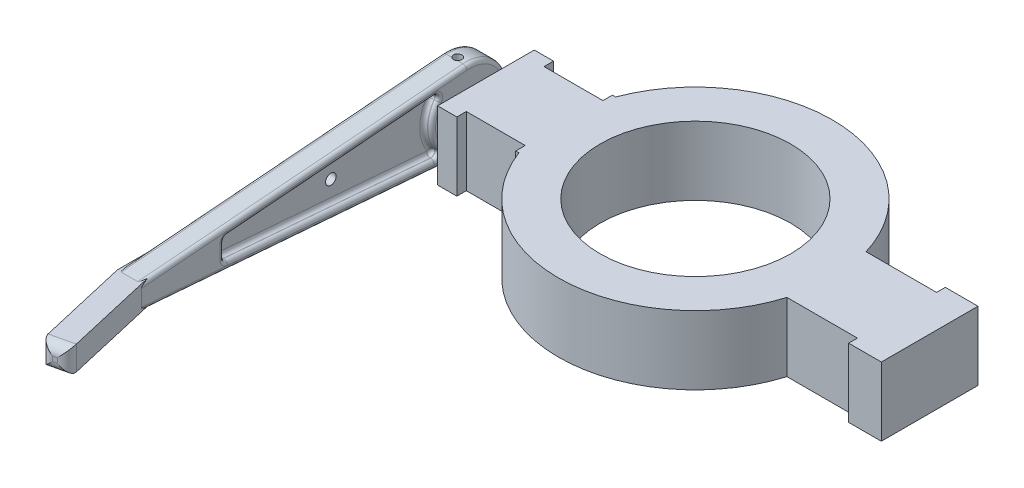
ISO-10303-21;
HEADER;
FILE_DESCRIPTION(('STEP AP214'),'2;1');
FILE_NAME('part.step','',(''),(''),'','','');
FILE_SCHEMA(('AUTOMOTIVE_DESIGN { 1 0 10303 214 1 1 1 1 }'));
ENDSEC;
DATA;
#1=APPLICATION_CONTEXT('core data for automotive mechanical design processes');
#2=APPLICATION_PROTOCOL_DEFINITION('international standard','automotive_design',2000,#1);
#3=PRODUCT_CONTEXT('',#1,'mechanical');
#4=PRODUCT('Part','Part','',(#3));
#5=PRODUCT_RELATED_PRODUCT_CATEGORY('part','',(#4));
#6=PRODUCT_DEFINITION_FORMATION('','',#4);
#7=PRODUCT_DEFINITION_CONTEXT('part definition',#1,'design');
#8=PRODUCT_DEFINITION('design','',#6,#7);
#9=PRODUCT_DEFINITION_SHAPE('','',#8);
#10=(LENGTH_UNIT() NAMED_UNIT(*) SI_UNIT(.MILLI.,.METRE.));
#11=(NAMED_UNIT(*) PLANE_ANGLE_UNIT() SI_UNIT($,.RADIAN.));
#12=(NAMED_UNIT(*) SI_UNIT($,.STERADIAN.) SOLID_ANGLE_UNIT());
#13=UNCERTAINTY_MEASURE_WITH_UNIT(LENGTH_MEASURE(1.E-05),#10,'distance_accuracy_value','');
#14=(GEOMETRIC_REPRESENTATION_CONTEXT(3) GLOBAL_UNCERTAINTY_ASSIGNED_CONTEXT((#13)) GLOBAL_UNIT_ASSIGNED_CONTEXT((#10,
#11,#12)) REPRESENTATION_CONTEXT('',''));
#15=CARTESIAN_POINT('',(0.,0.,0.));
#16=DIRECTION('',(0.,0.,1.));
#17=DIRECTION('',(1.,0.,0.));
#18=AXIS2_PLACEMENT_3D('',#15,#16,#17);
#19=CARTESIAN_POINT('',(-201.599770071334,-17.5260000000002,238.201685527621));
#20=DIRECTION('',(-0.974370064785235,0.,0.224951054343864));
#21=DIRECTION('',(-0.224951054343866,0.,-0.974370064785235));
#22=AXIS2_PLACEMENT_3D('',#19,#20,#21);
#23=PLANE('',#22);
#24=DIRECTION('',(-0.224951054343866,0.,-0.974370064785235));
#25=VECTOR('',#24,1.);
#26=CARTESIAN_POINT('',(-178.744742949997,-17.5259999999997,337.197684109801));
#27=LINE('',#26,#25);
#28=CARTESIAN_POINT('',(-180.458869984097,-17.5259999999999,329.772984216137));
#29=VERTEX_POINT('',#28);
#30=CARTESIAN_POINT('',(-196.85,-17.5259999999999,258.7752));
#31=VERTEX_POINT('',#30);
#32=EDGE_CURVE('P0_E355',#29,#31,#27,.T.);
#33=ORIENTED_EDGE('',*,*,#32,.T.);
#34=DIRECTION('',(0.,0.999999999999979,0.));
#35=VECTOR('',#34,1.);
#36=CARTESIAN_POINT('',(-196.85,-36.5759999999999,258.7752));
#37=LINE('',#36,#35);
#38=CARTESIAN_POINT('',(-196.85,-36.5759999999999,258.7752));
#39=VERTEX_POINT('',#38);
#40=EDGE_CURVE('P0_E342',#39,#31,#37,.T.);
#41=ORIENTED_EDGE('',*,*,#40,.F.);
#42=DIRECTION('',(-0.224951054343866,0.,-0.974370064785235));
#43=VECTOR('',#42,1.);
#44=CARTESIAN_POINT('',(-178.744742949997,-36.5759999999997,337.197684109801));
#45=LINE('',#44,#43);
#46=CARTESIAN_POINT('',(-180.458869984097,-36.5759999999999,329.772984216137));
#47=VERTEX_POINT('',#46);
#48=EDGE_CURVE('P0_E353',#47,#39,#45,.T.);
#49=ORIENTED_EDGE('',*,*,#48,.F.);
#50=DIRECTION('',(0.,-0.999999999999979,0.));
#51=VECTOR('',#50,1.);
#52=CARTESIAN_POINT('',(-180.458869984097,-17.5259999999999,329.772984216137));
#53=LINE('',#52,#51);
#54=EDGE_CURVE('P0_E395',#47,#29,#53,.F.);
#55=ORIENTED_EDGE('',*,*,#54,.T.);
#56=EDGE_LOOP('',(#33,#41,#49,#55));
#57=FACE_BOUND('',#56,.T.);
#58=ADVANCED_FACE('P0_F15',(#57),#23,.T.);
#59=CARTESIAN_POINT('',(117.385542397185,-36.5759999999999,258.7752));
#60=DIRECTION('',(0.,0.996801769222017,-0.0799139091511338));
#61=DIRECTION('',(0.,-0.0799139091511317,-0.996801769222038));
#62=AXIS2_PLACEMENT_3D('',#59,#60,#61);
#63=PLANE('',#62);
#64=DIRECTION('',(-1.,0.,0.));
#65=VECTOR('',#64,1.);
#66=CARTESIAN_POINT('',(117.385542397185,-36.5759999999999,258.7752));
#67=LINE('',#66,#65);
#68=CARTESIAN_POINT('',(-180.848,-36.5759999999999,258.7752));
#69=VERTEX_POINT('',#68);
#70=CARTESIAN_POINT('',(-193.802,-36.5759999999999,258.7752));
#71=VERTEX_POINT('',#70);
#72=EDGE_CURVE('P0_E376',#69,#71,#67,.T.);
#73=ORIENTED_EDGE('',*,*,#72,.T.);
#74=DIRECTION('',(0.,-0.0799139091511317,-0.996801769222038));
#75=VECTOR('',#74,1.);
#76=CARTESIAN_POINT('',(-193.802,-36.5759999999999,258.7752));
#77=LINE('',#76,#75);
#78=CARTESIAN_POINT('',(-193.802,-57.1476549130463,2.17578907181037));
#79=VERTEX_POINT('',#78);
#80=EDGE_CURVE('P0_E574',#71,#79,#77,.T.);
#81=ORIENTED_EDGE('',*,*,#80,.T.);
#82=DIRECTION('',(-1.,0.,0.));
#83=VECTOR('',#82,1.);
#84=CARTESIAN_POINT('',(117.385542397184,-57.1476549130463,2.17578907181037));
#85=LINE('',#84,#83);
#86=CARTESIAN_POINT('',(-180.848,-57.1476549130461,2.17578907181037));
#87=VERTEX_POINT('',#86);
#88=EDGE_CURVE('P0_E379',#87,#79,#85,.T.);
#89=ORIENTED_EDGE('',*,*,#88,.F.);
#90=DIRECTION('',(0.,-0.0799139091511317,-0.996801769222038));
#91=VECTOR('',#90,1.);
#92=CARTESIAN_POINT('',(-180.848,-57.1287703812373,2.41134424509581));
#93=LINE('',#92,#91);
#94=EDGE_CURVE('P0_E572',#87,#69,#93,.F.);
#95=ORIENTED_EDGE('',*,*,#94,.T.);
#96=EDGE_LOOP('',(#73,#81,#89,#95));
#97=FACE_BOUND('',#96,.T.);
#98=ADVANCED_FACE('P0_F655',(#97),#63,.F.);
#99=CARTESIAN_POINT('',(117.385542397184,-27.0509999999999,0.));
#100=DIRECTION('',(-1.,0.,0.));
#101=DIRECTION('',(0.,-0.999999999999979,0.));
#102=AXIS2_PLACEMENT_3D('',#99,#100,#101);
#103=CYLINDRICAL_SURFACE('',#102,30.1752);
#104=ORIENTED_EDGE('',*,*,#88,.T.);
#105=CARTESIAN_POINT('',(-193.802,-27.0509999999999,0.));
#106=DIRECTION('',(1.,0.,0.));
#107=DIRECTION('',(0.,0.999999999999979,0.));
#108=AXIS2_PLACEMENT_3D('',#105,#106,#107);
#109=CIRCLE('',#108,30.1752);
#110=CARTESIAN_POINT('',(-193.802,3.0276840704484,2.41152641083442));
#111=VERTEX_POINT('',#110);
#112=EDGE_CURVE('P0_E569',#79,#111,#109,.T.);
#113=ORIENTED_EDGE('',*,*,#112,.T.);
#114=DIRECTION('',(-1.,0.,0.));
#115=VECTOR('',#114,1.);
#116=CARTESIAN_POINT('',(117.385542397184,3.0276840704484,2.41152641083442));
#117=LINE('',#116,#115);
#118=CARTESIAN_POINT('',(-189.524450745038,3.0276840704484,2.41152641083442));
#119=VERTEX_POINT('',#118);
#120=EDGE_CURVE('P0_E382',#119,#111,#117,.T.);
#121=ORIENTED_EDGE('',*,*,#120,.F.);
#122=CARTESIAN_POINT('',(-189.524450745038,3.0276840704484,2.41152641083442));
#123=CARTESIAN_POINT('',(-189.592248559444,3.03264149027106,2.3497021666));
#124=CARTESIAN_POINT('',(-189.657423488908,3.03763551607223,2.28501104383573));
#125=CARTESIAN_POINT('',(-189.782099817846,3.04755698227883,2.15037387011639));
#126=CARTESIAN_POINT('',(-189.841601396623,3.05248442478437,2.08042798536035));
#127=CARTESIAN_POINT('',(-189.954480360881,3.06213092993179,1.93579105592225));
#128=CARTESIAN_POINT('',(-190.007860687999,3.06685009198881,1.86110231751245));
#129=CARTESIAN_POINT('',(-190.108143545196,3.07594893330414,1.70750673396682));
#130=CARTESIAN_POINT('',(-190.155046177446,3.08032861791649,1.62859995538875));
#131=CARTESIAN_POINT('',(-190.285561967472,3.09277255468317,1.38625871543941));
#132=CARTESIAN_POINT('',(-190.359019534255,3.10014493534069,1.21715648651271));
#133=CARTESIAN_POINT('',(-190.4764363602,3.1121856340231,0.869062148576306));
#134=CARTESIAN_POINT('',(-190.520404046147,3.11685472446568,0.690072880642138));
#135=CARTESIAN_POINT('',(-190.577547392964,3.12296067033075,0.327814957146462));
#136=CARTESIAN_POINT('',(-190.590831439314,3.12440890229,0.144563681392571));
#137=CARTESIAN_POINT('',(-190.586514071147,3.12394193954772,-0.221592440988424));
#138=CARTESIAN_POINT('',(-190.568908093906,3.12202624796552,-0.404497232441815));
#139=CARTESIAN_POINT('',(-190.503435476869,3.11505813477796,-0.76412428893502));
#140=CARTESIAN_POINT('',(-190.455667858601,3.11001597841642,-0.940864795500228));
#141=CARTESIAN_POINT('',(-190.331352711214,3.09736661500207,-1.28380402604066));
#142=CARTESIAN_POINT('',(-190.254806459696,3.08975952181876,-1.45000321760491));
#143=CARTESIAN_POINT('',(-190.074823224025,3.07279723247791,-1.76775684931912));
#144=CARTESIAN_POINT('',(-189.971299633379,3.06343643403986,-1.91926192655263));
#145=CARTESIAN_POINT('',(-189.740394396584,3.04402589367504,-2.20280386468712));
#146=CARTESIAN_POINT('',(-189.613011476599,3.03397611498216,-2.33483968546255));
#147=CARTESIAN_POINT('',(-189.33728920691,3.0142623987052,-2.57632999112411));
#148=CARTESIAN_POINT('',(-189.188854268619,3.00460049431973,-2.68567553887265));
#149=CARTESIAN_POINT('',(-188.875650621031,2.98680555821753,-2.87789608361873));
#150=CARTESIAN_POINT('',(-188.710882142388,2.97867250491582,-2.96077145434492));
#151=CARTESIAN_POINT('',(-188.369854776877,2.96486928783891,-3.0975856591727));
#152=CARTESIAN_POINT('',(-188.193609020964,2.95919636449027,-3.1515569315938));
#153=CARTESIAN_POINT('',(-187.834486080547,2.95095035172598,-3.22911910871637));
#154=CARTESIAN_POINT('',(-187.651609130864,2.948377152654,-3.25271108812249));
#155=CARTESIAN_POINT('',(-187.285443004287,2.94663115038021,-3.26877454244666));
#156=CARTESIAN_POINT('',(-187.102161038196,2.94744055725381,-3.26140883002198));
#157=CARTESIAN_POINT('',(-186.739454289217,2.95232685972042,-3.21614372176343));
#158=CARTESIAN_POINT('',(-186.560029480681,2.95640373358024,-3.17824452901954));
#159=CARTESIAN_POINT('',(-186.21032442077,2.96735471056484,-3.07308360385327));
#160=CARTESIAN_POINT('',(-186.040033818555,2.97422556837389,-3.00585593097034));
#161=CARTESIAN_POINT('',(-185.713131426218,2.98999005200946,-2.84397494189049));
#162=CARTESIAN_POINT('',(-185.556520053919,2.99888373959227,-2.74932078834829));
#163=CARTESIAN_POINT('',(-185.260617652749,3.01774432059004,-2.53474395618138));
#164=CARTESIAN_POINT('',(-185.121412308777,3.02771610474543,-2.41470354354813));
#165=CARTESIAN_POINT('',(-184.86507626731,3.04757983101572,-2.15299106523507));
#166=CARTESIAN_POINT('',(-184.747946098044,3.05747177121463,-2.0113184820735));
#167=CARTESIAN_POINT('',(-184.538711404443,3.07609952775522,-1.70980103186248));
#168=CARTESIAN_POINT('',(-184.446689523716,3.08483147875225,-1.54989855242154));
#169=CARTESIAN_POINT('',(-184.290822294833,3.10011672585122,-1.21680640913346));
#170=CARTESIAN_POINT('',(-184.226976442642,3.1066700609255,-1.04361698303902));
#171=CARTESIAN_POINT('',(-184.129484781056,3.11684061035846,-0.689456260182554));
#172=CARTESIAN_POINT('',(-184.095741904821,3.12046725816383,-0.508511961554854));
#173=CARTESIAN_POINT('',(-184.059102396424,3.12441049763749,-0.143504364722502));
#174=CARTESIAN_POINT('',(-184.056202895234,3.12472739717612,0.0405586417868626));
#175=CARTESIAN_POINT('',(-184.081265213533,3.12202303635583,0.405649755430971));
#176=CARTESIAN_POINT('',(-184.109078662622,3.11901782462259,0.58668820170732));
#177=CARTESIAN_POINT('',(-184.194538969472,3.11002871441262,0.941579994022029));
#178=CARTESIAN_POINT('',(-184.252196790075,3.10404372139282,1.11543067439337));
#179=CARTESIAN_POINT('',(-184.395783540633,3.08975088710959,1.45126621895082));
#180=CARTESIAN_POINT('',(-184.481763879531,3.08143882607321,1.6132288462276));
#181=CARTESIAN_POINT('',(-184.679480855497,3.06342865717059,1.92028763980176));
#182=CARTESIAN_POINT('',(-184.791175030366,3.05373284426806,2.06541102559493));
#183=CARTESIAN_POINT('',(-184.947646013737,3.04119727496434,2.23690396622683));
#184=CARTESIAN_POINT('',(-184.982132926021,3.0384904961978,2.27299718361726));
#185=CARTESIAN_POINT('',(-185.052670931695,3.03308046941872,2.34350987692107));
#186=CARTESIAN_POINT('',(-185.088719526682,3.03037722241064,2.37793185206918));
#187=CARTESIAN_POINT('',(-185.125549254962,3.0276840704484,2.41152641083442));
#188=B_SPLINE_CURVE_WITH_KNOTS('',3,(#122,#123,#124,#125,#126,#127,#128,#129,#130,#131,#132,
#133,#134,#135,#136,#137,#138,#139,#140,#141,#142,#143,#144,#145,#146,#147,#148,#149,#150,#151,
#152,#153,#154,#155,#156,#157,#158,#159,#160,#161,#162,#163,#164,#165,#166,#167,#168,#169,#170,
#171,#172,#173,#174,#175,#176,#177,#178,#179,#180,#181,#182,#183,#184,#185,#186,#187),
.UNSPECIFIED.,.F.,.F.,(4,2,2,2,2,2,2,2,2,2,2,2,2,2,2,2,2,2,2,2,2,2,2,2,2,2,2,2,2,2,2,2,4),(0.,
0.275574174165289,0.551139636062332,0.826572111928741,1.10200024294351,1.65268025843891,
2.20320284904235,2.75177780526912,3.30043379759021,3.84729783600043,4.39413759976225,
4.94275500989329,5.49140171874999,6.04262449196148,6.59383948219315,7.14443455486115,
7.69501014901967,8.24269378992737,8.79037378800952,9.33741944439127,9.88448180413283,
10.4341392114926,10.9838097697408,11.5352683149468,12.0867169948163,12.6363810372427,
13.1859939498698,13.7329633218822,14.2801337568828,14.828302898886,15.375573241,
15.5255219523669,15.6752390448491),.UNSPECIFIED.);
#189=CARTESIAN_POINT('',(-185.125549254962,3.0276840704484,2.41152641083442));
#190=VERTEX_POINT('',#189);
#191=EDGE_CURVE('P0_E681',#119,#190,#188,.T.);
#192=ORIENTED_EDGE('',*,*,#191,.T.);
#193=CARTESIAN_POINT('',(-180.848,3.0276840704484,2.41152641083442));
#194=VERTEX_POINT('',#193);
#195=EDGE_CURVE('P0_E375',#194,#190,#117,.T.);
#196=ORIENTED_EDGE('',*,*,#195,.F.);
#197=CARTESIAN_POINT('',(-180.848,-27.0509999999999,0.));
#198=DIRECTION('',(1.,0.,0.));
#199=DIRECTION('',(0.,0.999999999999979,0.));
#200=AXIS2_PLACEMENT_3D('',#197,#198,#199);
#201=CIRCLE('',#200,30.1752);
#202=EDGE_CURVE('P0_E567',#194,#87,#201,.F.);
#203=ORIENTED_EDGE('',*,*,#202,.T.);
#204=EDGE_LOOP('',(#104,#113,#121,#192,#196,#203));
#205=FACE_BOUND('',#204,.T.);
#206=ADVANCED_FACE('P0_F660',(#205),#103,.T.);
#207=CARTESIAN_POINT('',(117.385542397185,-17.5259999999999,258.7752));
#208=DIRECTION('',(0.,-0.99680148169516,-0.0799174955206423));
#209=DIRECTION('',(0.,-0.079917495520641,0.996801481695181));
#210=AXIS2_PLACEMENT_3D('',#207,#208,#209);
#211=PLANE('',#210);
#212=ORIENTED_EDGE('',*,*,#120,.T.);
#213=DIRECTION('',(0.,-0.079917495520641,0.996801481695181));
#214=VECTOR('',#213,1.);
#215=CARTESIAN_POINT('',(-193.802,-17.5259999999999,258.7752));
#216=LINE('',#215,#214);
#217=CARTESIAN_POINT('',(-193.802,-17.5259999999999,258.7752));
#218=VERTEX_POINT('',#217);
#219=EDGE_CURVE('P0_E578',#111,#218,#216,.T.);
#220=ORIENTED_EDGE('',*,*,#219,.T.);
#221=DIRECTION('',(-1.,0.,0.));
#222=VECTOR('',#221,1.);
#223=CARTESIAN_POINT('',(117.385542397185,-17.5259999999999,258.7752));
#224=LINE('',#223,#222);
#225=CARTESIAN_POINT('',(-180.848,-17.5259999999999,258.7752));
#226=VERTEX_POINT('',#225);
#227=EDGE_CURVE('P0_E369',#226,#218,#224,.T.);
#228=ORIENTED_EDGE('',*,*,#227,.F.);
#229=DIRECTION('',(0.,-0.079917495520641,0.996801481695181));
#230=VECTOR('',#229,1.);
#231=CARTESIAN_POINT('',(-180.848,3.0276840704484,2.41152641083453));
#232=LINE('',#231,#230);
#233=EDGE_CURVE('P0_E576',#226,#194,#232,.F.);
#234=ORIENTED_EDGE('',*,*,#233,.T.);
#235=ORIENTED_EDGE('',*,*,#195,.T.);
#236=CARTESIAN_POINT('',(-187.325,3.22102562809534,-3.60822483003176E-13));
#237=DIRECTION('',(0.,-0.99680148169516,-0.0799174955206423));
#238=DIRECTION('',(0.,-0.079917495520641,0.996801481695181));
#239=AXIS2_PLACEMENT_3D('',#236,#237,#238);
#240=ELLIPSE('',#239,3.27437314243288,3.2639);
#241=EDGE_CURVE('P0_E418',#190,#119,#240,.T.);
#242=ORIENTED_EDGE('',*,*,#241,.T.);
#243=EDGE_LOOP('',(#212,#220,#228,#234,#235,#242));
#244=FACE_BOUND('',#243,.T.);
#245=ADVANCED_FACE('P0_F672',(#244),#211,.F.);
#246=CARTESIAN_POINT('',(-196.85,-27.0509999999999,0.));
#247=DIRECTION('',(1.,0.,0.));
#248=DIRECTION('',(0.,0.999999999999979,0.));
#249=AXIS2_PLACEMENT_3D('',#246,#247,#248);
#250=PLANE('',#249);
#251=CARTESIAN_POINT('',(-196.85,-8.54923597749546,27.6236660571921));
#252=DIRECTION('',(1.,0.,0.));
#253=DIRECTION('',(0.,0.999999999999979,0.));
#254=AXIS2_PLACEMENT_3D('',#251,#252,#253);
#255=CIRCLE('',#254,6.223);
#256=CARTESIAN_POINT('',(-196.85,-12.0122695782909,22.4532572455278));
#257=VERTEX_POINT('',#256);
#258=CARTESIAN_POINT('',(-196.85,-2.34614035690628,28.1209926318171));
#259=VERTEX_POINT('',#258);
#260=EDGE_CURVE('P0_E487',#257,#259,#255,.T.);
#261=ORIENTED_EDGE('',*,*,#260,.T.);
#262=DIRECTION('',(0.,0.0799174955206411,-0.996801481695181));
#263=VECTOR('',#262,1.);
#264=CARTESIAN_POINT('',(-196.85,-0.26375442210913,2.1476388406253));
#265=LINE('',#264,#263);
#266=CARTESIAN_POINT('',(-196.85,-15.4147587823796,191.124326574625));
#267=VERTEX_POINT('',#266);
#268=EDGE_CURVE('P0_E489',#259,#267,#265,.F.);
#269=ORIENTED_EDGE('',*,*,#268,.T.);
#270=CARTESIAN_POINT('',(-196.85,-21.6178544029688,190.627));
#271=DIRECTION('',(1.,0.,0.));
#272=DIRECTION('',(0.,0.999999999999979,0.));
#273=AXIS2_PLACEMENT_3D('',#270,#271,#272);
#274=CIRCLE('',#273,6.223);
#275=CARTESIAN_POINT('',(-196.85,-21.6178544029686,196.85));
#276=VERTEX_POINT('',#275);
#277=EDGE_CURVE('P0_E349',#267,#276,#274,.T.);
#278=ORIENTED_EDGE('',*,*,#277,.T.);
#279=DIRECTION('',(0.,0.999999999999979,0.));
#280=VECTOR('',#279,1.);
#281=CARTESIAN_POINT('',(-196.85,-27.0509999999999,196.85));
#282=LINE('',#281,#280);
#283=CARTESIAN_POINT('',(-196.85,-32.4839015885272,196.85));
#284=VERTEX_POINT('',#283);
#285=EDGE_CURVE('P0_E477',#276,#284,#282,.F.);
#286=ORIENTED_EDGE('',*,*,#285,.T.);
#287=CARTESIAN_POINT('',(-196.85,-32.4839015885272,190.627));
#288=DIRECTION('',(1.,0.,0.));
#289=DIRECTION('',(0.,0.999999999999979,0.));
#290=AXIS2_PLACEMENT_3D('',#287,#288,#289);
#291=CIRCLE('',#290,6.22300000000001);
#292=CARTESIAN_POINT('',(-196.85,-38.686998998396,191.124304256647));
#293=VERTEX_POINT('',#292);
#294=EDGE_CURVE('P0_E479',#284,#293,#291,.T.);
#295=ORIENTED_EDGE('',*,*,#294,.T.);
#296=DIRECTION('',(0.,0.0799139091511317,0.996801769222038));
#297=VECTOR('',#296,1.);
#298=CARTESIAN_POINT('',(-196.85,-53.8373309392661,2.14746851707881));
#299=LINE('',#298,#297);
#300=CARTESIAN_POINT('',(-196.85,-51.754979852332,28.1215607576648));
#301=VERTEX_POINT('',#300);
#302=EDGE_CURVE('P0_E481',#293,#301,#299,.F.);
#303=ORIENTED_EDGE('',*,*,#302,.T.);
#304=CARTESIAN_POINT('',(-196.85,-45.5518824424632,27.6242565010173));
#305=DIRECTION('',(1.,0.,0.));
#306=DIRECTION('',(0.,0.999999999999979,0.));
#307=AXIS2_PLACEMENT_3D('',#304,#305,#306);
#308=CIRCLE('',#307,6.223);
#309=CARTESIAN_POINT('',(-196.85,-42.0890138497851,22.4537371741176));
#310=VERTEX_POINT('',#309);
#311=EDGE_CURVE('P0_E483',#301,#310,#308,.T.);
#312=ORIENTED_EDGE('',*,*,#311,.T.);
#313=CARTESIAN_POINT('',(-196.85,-27.0509999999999,0.));
#314=DIRECTION('',(1.,0.,0.));
#315=DIRECTION('',(0.,0.999999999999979,0.));
#316=AXIS2_PLACEMENT_3D('',#313,#314,#315);
#317=CIRCLE('',#316,27.0242885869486);
#318=EDGE_CURVE('P0_E485',#310,#257,#317,.F.);
#319=ORIENTED_EDGE('',*,*,#318,.T.);
#320=EDGE_LOOP('',(#261,#269,#278,#286,#295,#303,#312,#319));
#321=FACE_BOUND('',#320,.T.);
#322=DIRECTION('',(0.,-0.0799139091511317,-0.996801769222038));
#323=VECTOR('',#322,1.);
#324=CARTESIAN_POINT('',(-196.85,-54.0905185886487,2.16776665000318));
#325=LINE('',#324,#323);
#326=CARTESIAN_POINT('',(-196.85,-54.1084239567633,1.94442502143));
#327=VERTEX_POINT('',#326);
#328=CARTESIAN_POINT('',(-196.85,-36.5760000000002,220.634155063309));
#329=VERTEX_POINT('',#328);
#330=EDGE_CURVE('P0_E345',#327,#329,#325,.F.);
#331=ORIENTED_EDGE('',*,*,#330,.T.);
#332=DIRECTION('',(0.,0.,1.));
#333=VECTOR('',#332,1.);
#334=CARTESIAN_POINT('',(-196.85,-36.5759999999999,238.201685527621));
#335=LINE('',#334,#333);
#336=EDGE_CURVE('P0_E337',#329,#39,#335,.T.);
#337=ORIENTED_EDGE('',*,*,#336,.T.);
#338=ORIENTED_EDGE('',*,*,#40,.T.);
#339=DIRECTION('',(0.,0.,-1.));
#340=VECTOR('',#339,1.);
#341=CARTESIAN_POINT('',(-196.85,-17.5260000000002,234.026200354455));
#342=LINE('',#341,#340);
#343=CARTESIAN_POINT('',(-196.85,-17.5260000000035,220.635866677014));
#344=VERTEX_POINT('',#343);
#345=EDGE_CURVE('P0_E471',#31,#344,#342,.T.);
#346=ORIENTED_EDGE('',*,*,#345,.T.);
#347=DIRECTION('',(0.,-0.079917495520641,0.996801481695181));
#348=VECTOR('',#347,1.);
#349=CARTESIAN_POINT('',(-196.85,-0.0105668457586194,2.16793788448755));
#350=LINE('',#349,#348);
#351=CARTESIAN_POINT('',(-196.85,-0.0105668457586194,2.16793788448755));
#352=VERTEX_POINT('',#351);
#353=EDGE_CURVE('P0_E469',#344,#352,#350,.F.);
#354=ORIENTED_EDGE('',*,*,#353,.T.);
#355=CARTESIAN_POINT('',(-196.85,-27.0509999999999,0.));
#356=DIRECTION('',(1.,0.,0.));
#357=DIRECTION('',(0.,0.999999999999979,0.));
#358=AXIS2_PLACEMENT_3D('',#355,#356,#357);
#359=CIRCLE('',#358,27.1272);
#360=EDGE_CURVE('P0_E473',#352,#327,#359,.F.);
#361=ORIENTED_EDGE('',*,*,#360,.T.);
#362=EDGE_LOOP('',(#331,#337,#338,#346,#354,#361));
#363=FACE_BOUND('',#362,.T.);
#364=DIRECTION('',(0.,0.,-1.));
#365=VECTOR('',#364,1.);
#366=CARTESIAN_POINT('',(-196.85,-19.1007999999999,7.78231295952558));
#367=LINE('',#366,#365);
#368=CARTESIAN_POINT('',(-196.85,-19.1007999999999,7.78231295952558));
#369=VERTEX_POINT('',#368);
#370=CARTESIAN_POINT('',(-196.85,-19.1007999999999,-7.78231295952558));
#371=VERTEX_POINT('',#370);
#372=EDGE_CURVE('P0_E813',#369,#371,#367,.T.);
#373=ORIENTED_EDGE('',*,*,#372,.F.);
#374=CARTESIAN_POINT('',(-196.85,-27.0509999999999,0.));
#375=DIRECTION('',(-1.,0.,0.));
#376=DIRECTION('',(0.,-0.999999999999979,0.));
#377=AXIS2_PLACEMENT_3D('',#374,#375,#376);
#378=CIRCLE('',#377,11.1252);
#379=CARTESIAN_POINT('',(-196.85,-35.0012,7.78231295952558));
#380=VERTEX_POINT('',#379);
#381=EDGE_CURVE('P0_E800',#380,#369,#378,.T.);
#382=ORIENTED_EDGE('',*,*,#381,.F.);
#383=DIRECTION('',(0.,0.,1.));
#384=VECTOR('',#383,1.);
#385=CARTESIAN_POINT('',(-196.85,-35.0012,7.78231295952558));
#386=LINE('',#385,#384);
#387=CARTESIAN_POINT('',(-196.85,-35.0012,-7.78231295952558));
#388=VERTEX_POINT('',#387);
#389=EDGE_CURVE('P0_E801',#388,#380,#386,.T.);
#390=ORIENTED_EDGE('',*,*,#389,.F.);
#391=CARTESIAN_POINT('',(-196.85,-27.0509999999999,0.));
#392=DIRECTION('',(-1.,0.,0.));
#393=DIRECTION('',(0.,-0.999999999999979,0.));
#394=AXIS2_PLACEMENT_3D('',#391,#392,#393);
#395=CIRCLE('',#394,11.1252);
#396=EDGE_CURVE('P0_E807',#371,#388,#395,.T.);
#397=ORIENTED_EDGE('',*,*,#396,.F.);
#398=EDGE_LOOP('',(#373,#382,#390,#397));
#399=FACE_BOUND('',#398,.T.);
#400=ADVANCED_FACE('P0_F339',(#321,#363,#399),#250,.F.);
#401=CARTESIAN_POINT('',(-177.8,-27.0509999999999,0.));
#402=DIRECTION('',(1.,0.,0.));
#403=DIRECTION('',(0.,0.999999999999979,0.));
#404=AXIS2_PLACEMENT_3D('',#401,#402,#403);
#405=PLANE('',#404);
#406=CARTESIAN_POINT('',(-177.8,-45.5518824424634,27.6242565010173));
#407=DIRECTION('',(1.,0.,0.));
#408=DIRECTION('',(0.,0.999999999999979,0.));
#409=AXIS2_PLACEMENT_3D('',#406,#407,#408);
#410=CIRCLE('',#409,6.223);
#411=CARTESIAN_POINT('',(-177.8,-42.0890138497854,22.4537371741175));
#412=VERTEX_POINT('',#411);
#413=CARTESIAN_POINT('',(-177.8,-51.7549798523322,28.1215607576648));
#414=VERTEX_POINT('',#413);
#415=EDGE_CURVE('P0_E517',#412,#414,#410,.F.);
#416=ORIENTED_EDGE('',*,*,#415,.T.);
#417=DIRECTION('',(0.,-0.0799139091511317,-0.996801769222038));
#418=VECTOR('',#417,1.);
#419=CARTESIAN_POINT('',(-177.8,-51.7549798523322,28.1215607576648));
#420=LINE('',#419,#418);
#421=CARTESIAN_POINT('',(-177.8,-38.686998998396,191.124304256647));
#422=VERTEX_POINT('',#421);
#423=EDGE_CURVE('P0_E519',#414,#422,#420,.F.);
#424=ORIENTED_EDGE('',*,*,#423,.T.);
#425=CARTESIAN_POINT('',(-177.8,-32.4839015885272,190.627));
#426=DIRECTION('',(1.,0.,0.));
#427=DIRECTION('',(0.,0.999999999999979,0.));
#428=AXIS2_PLACEMENT_3D('',#425,#426,#427);
#429=CIRCLE('',#428,6.22300000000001);
#430=CARTESIAN_POINT('',(-177.8,-32.4839015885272,196.85));
#431=VERTEX_POINT('',#430);
#432=EDGE_CURVE('P0_E505',#422,#431,#429,.F.);
#433=ORIENTED_EDGE('',*,*,#432,.T.);
#434=DIRECTION('',(0.,-0.999999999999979,0.));
#435=VECTOR('',#434,1.);
#436=CARTESIAN_POINT('',(-177.8,-32.4839015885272,196.85));
#437=LINE('',#436,#435);
#438=CARTESIAN_POINT('',(-177.8,-21.6178544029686,196.85));
#439=VERTEX_POINT('',#438);
#440=EDGE_CURVE('P0_E507',#431,#439,#437,.F.);
#441=ORIENTED_EDGE('',*,*,#440,.T.);
#442=CARTESIAN_POINT('',(-177.8,-21.6178544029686,190.627));
#443=DIRECTION('',(1.,0.,0.));
#444=DIRECTION('',(0.,0.999999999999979,0.));
#445=AXIS2_PLACEMENT_3D('',#442,#443,#444);
#446=CIRCLE('',#445,6.223);
#447=CARTESIAN_POINT('',(-177.8,-15.4147587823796,191.124326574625));
#448=VERTEX_POINT('',#447);
#449=EDGE_CURVE('P0_E509',#439,#448,#446,.F.);
#450=ORIENTED_EDGE('',*,*,#449,.T.);
#451=DIRECTION('',(0.,-0.0799174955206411,0.996801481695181));
#452=VECTOR('',#451,1.);
#453=CARTESIAN_POINT('',(-177.8,-15.4147587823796,191.124326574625));
#454=LINE('',#453,#452);
#455=CARTESIAN_POINT('',(-177.8,-2.34614035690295,28.1209926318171));
#456=VERTEX_POINT('',#455);
#457=EDGE_CURVE('P0_E511',#448,#456,#454,.F.);
#458=ORIENTED_EDGE('',*,*,#457,.T.);
#459=CARTESIAN_POINT('',(-177.8,-8.54923597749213,27.6236660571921));
#460=DIRECTION('',(1.,0.,0.));
#461=DIRECTION('',(0.,0.999999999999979,0.));
#462=AXIS2_PLACEMENT_3D('',#459,#460,#461);
#463=CIRCLE('',#462,6.223);
#464=CARTESIAN_POINT('',(-177.8,-12.0122695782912,22.4532572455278));
#465=VERTEX_POINT('',#464);
#466=EDGE_CURVE('P0_E513',#456,#465,#463,.F.);
#467=ORIENTED_EDGE('',*,*,#466,.T.);
#468=CARTESIAN_POINT('',(-177.8,-27.0509999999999,0.));
#469=DIRECTION('',(1.,0.,0.));
#470=DIRECTION('',(0.,0.999999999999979,0.));
#471=AXIS2_PLACEMENT_3D('',#468,#469,#470);
#472=CIRCLE('',#471,27.0242885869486);
#473=EDGE_CURVE('P0_E515',#465,#412,#472,.T.);
#474=ORIENTED_EDGE('',*,*,#473,.T.);
#475=EDGE_LOOP('',(#416,#424,#433,#441,#450,#458,#467,#474));
#476=FACE_BOUND('',#475,.T.);
#477=CARTESIAN_POINT('',(-177.8,-27.0509999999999,0.));
#478=DIRECTION('',(1.,0.,0.));
#479=DIRECTION('',(0.,0.999999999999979,0.));
#480=AXIS2_PLACEMENT_3D('',#477,#478,#479);
#481=CIRCLE('',#480,11.1252);
#482=CARTESIAN_POINT('',(-177.8,-19.1007999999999,7.78231295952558));
#483=VERTEX_POINT('',#482);
#484=CARTESIAN_POINT('',(-177.8,-35.0012,7.78231295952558));
#485=VERTEX_POINT('',#484);
#486=EDGE_CURVE('P0_E408',#483,#485,#481,.T.);
#487=ORIENTED_EDGE('',*,*,#486,.F.);
#488=DIRECTION('',(0.,0.,1.));
#489=VECTOR('',#488,1.);
#490=CARTESIAN_POINT('',(-177.8,-19.1007999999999,0.));
#491=LINE('',#490,#489);
#492=CARTESIAN_POINT('',(-177.8,-19.1007999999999,-7.78231295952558));
#493=VERTEX_POINT('',#492);
#494=EDGE_CURVE('P0_E401',#493,#483,#491,.T.);
#495=ORIENTED_EDGE('',*,*,#494,.F.);
#496=CARTESIAN_POINT('',(-177.8,-27.0509999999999,0.));
#497=DIRECTION('',(1.,0.,0.));
#498=DIRECTION('',(0.,0.999999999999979,0.));
#499=AXIS2_PLACEMENT_3D('',#496,#497,#498);
#500=CIRCLE('',#499,11.1252);
#501=CARTESIAN_POINT('',(-177.8,-35.0012,-7.78231295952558));
#502=VERTEX_POINT('',#501);
#503=EDGE_CURVE('P0_E403',#502,#493,#500,.T.);
#504=ORIENTED_EDGE('',*,*,#503,.F.);
#505=DIRECTION('',(0.,0.,-1.));
#506=VECTOR('',#505,1.);
#507=CARTESIAN_POINT('',(-177.8,-35.0012,0.));
#508=LINE('',#507,#506);
#509=EDGE_CURVE('P0_E406',#485,#502,#508,.T.);
#510=ORIENTED_EDGE('',*,*,#509,.F.);
#511=EDGE_LOOP('',(#487,#495,#504,#510));
#512=FACE_BOUND('',#511,.T.);
#513=CARTESIAN_POINT('',(-177.8,-27.0509999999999,0.));
#514=DIRECTION('',(1.,0.,0.));
#515=DIRECTION('',(0.,0.999999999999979,0.));
#516=AXIS2_PLACEMENT_3D('',#513,#514,#515);
#517=CIRCLE('',#516,27.1272);
#518=CARTESIAN_POINT('',(-177.8,-54.1084239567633,1.94442502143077));
#519=VERTEX_POINT('',#518);
#520=CARTESIAN_POINT('',(-177.8,-0.0105668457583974,2.16793788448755));
#521=VERTEX_POINT('',#520);
#522=EDGE_CURVE('P0_E500',#519,#521,#517,.T.);
#523=ORIENTED_EDGE('',*,*,#522,.T.);
#524=DIRECTION('',(0.,-0.079917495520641,0.996801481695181));
#525=VECTOR('',#524,1.);
#526=CARTESIAN_POINT('',(-177.8,-0.0105668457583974,2.16793788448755));
#527=LINE('',#526,#525);
#528=CARTESIAN_POINT('',(-177.8,-20.5837803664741,258.7752));
#529=VERTEX_POINT('',#528);
#530=EDGE_CURVE('P0_E502',#521,#529,#527,.T.);
#531=ORIENTED_EDGE('',*,*,#530,.T.);
#532=DIRECTION('',(0.,-0.999999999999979,0.));
#533=VECTOR('',#532,1.);
#534=CARTESIAN_POINT('',(-177.8,-36.5759999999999,258.7752));
#535=LINE('',#534,#533);
#536=CARTESIAN_POINT('',(-177.8,-33.5182205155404,258.7752));
#537=VERTEX_POINT('',#536);
#538=EDGE_CURVE('P0_E371',#529,#537,#535,.T.);
#539=ORIENTED_EDGE('',*,*,#538,.T.);
#540=DIRECTION('',(0.,-0.0799139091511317,-0.996801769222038));
#541=VECTOR('',#540,1.);
#542=CARTESIAN_POINT('',(-177.8,-54.0905185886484,2.16776665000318));
#543=LINE('',#542,#541);
#544=EDGE_CURVE('P0_E498',#537,#519,#543,.T.);
#545=ORIENTED_EDGE('',*,*,#544,.T.);
#546=EDGE_LOOP('',(#523,#531,#539,#545));
#547=FACE_BOUND('',#546,.T.);
#548=ADVANCED_FACE('P0_F17',(#476,#512,#547),#405,.T.);
#549=CARTESIAN_POINT('',(-183.513756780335,-17.5260000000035,234.026200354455));
#550=DIRECTION('',(0.,0.999999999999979,0.));
#551=DIRECTION('',(0.,0.,-1.));
#552=AXIS2_PLACEMENT_3D('',#549,#550,#551);
#553=PLANE('',#552);
#554=ORIENTED_EDGE('',*,*,#32,.F.);
#555=DIRECTION('',(-0.974370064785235,0.,0.224951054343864));
#556=VECTOR('',#555,1.);
#557=CARTESIAN_POINT('',(-162.372856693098,-17.5260000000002,325.597499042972));
#558=LINE('',#557,#556);
#559=CARTESIAN_POINT('',(-162.372856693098,-17.5260000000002,325.597499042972));
#560=VERTEX_POINT('',#559);
#561=EDGE_CURVE('P0_E397',#29,#560,#558,.F.);
#562=ORIENTED_EDGE('',*,*,#561,.T.);
#563=DIRECTION('',(-0.224951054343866,0.,-0.974370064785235));
#564=VECTOR('',#563,1.);
#565=CARTESIAN_POINT('',(-160.658729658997,-17.5259999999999,333.022198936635));
#566=LINE('',#565,#564);
#567=CARTESIAN_POINT('',(-179.199308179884,-17.5259999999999,252.714130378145));
#568=VERTEX_POINT('',#567);
#569=EDGE_CURVE('P0_E37',#560,#568,#566,.T.);
#570=ORIENTED_EDGE('',*,*,#569,.T.);
#571=CARTESIAN_POINT('',(-180.848,-17.5260000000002,220.635866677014));
#572=DIRECTION('',(0.,0.999999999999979,0.));
#573=DIRECTION('',(0.,0.,-1.));
#574=AXIS2_PLACEMENT_3D('',#571,#572,#573);
#575=ELLIPSE('',#574,38.1393333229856,3.048);
#576=EDGE_CURVE('P0_E586',#568,#226,#575,.F.);
#577=ORIENTED_EDGE('',*,*,#576,.T.);
#578=ORIENTED_EDGE('',*,*,#227,.T.);
#579=CARTESIAN_POINT('',(-193.802,-17.5259999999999,220.635866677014));
#580=DIRECTION('',(0.,0.999999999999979,0.));
#581=DIRECTION('',(0.,0.,1.));
#582=AXIS2_PLACEMENT_3D('',#579,#580,#581);
#583=ELLIPSE('',#582,38.1393333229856,3.048);
#584=EDGE_CURVE('P0_E582',#218,#344,#583,.F.);
#585=ORIENTED_EDGE('',*,*,#584,.T.);
#586=ORIENTED_EDGE('',*,*,#345,.F.);
#587=EDGE_LOOP('',(#554,#562,#570,#577,#578,#585,#586));
#588=FACE_BOUND('',#587,.T.);
#589=ADVANCED_FACE('P0_F665',(#588),#553,.T.);
#590=CARTESIAN_POINT('',(-201.599770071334,-36.5759999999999,238.201685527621));
#591=DIRECTION('',(0.,-0.999999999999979,0.));
#592=DIRECTION('',(1.,0.,0.));
#593=AXIS2_PLACEMENT_3D('',#590,#591,#592);
#594=PLANE('',#593);
#595=DIRECTION('',(-0.224951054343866,0.,-0.974370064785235));
#596=VECTOR('',#595,1.);
#597=CARTESIAN_POINT('',(-160.658729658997,-36.5759999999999,333.022198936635));
#598=LINE('',#597,#596);
#599=CARTESIAN_POINT('',(-162.372856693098,-36.5759999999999,325.597499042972));
#600=VERTEX_POINT('',#599);
#601=CARTESIAN_POINT('',(-179.199330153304,-36.5759999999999,252.714035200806));
#602=VERTEX_POINT('',#601);
#603=EDGE_CURVE('P0_E29',#600,#602,#598,.T.);
#604=ORIENTED_EDGE('',*,*,#603,.F.);
#605=DIRECTION('',(0.974370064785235,0.,-0.224951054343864));
#606=VECTOR('',#605,1.);
#607=CARTESIAN_POINT('',(-180.458869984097,-36.5759999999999,329.772984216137));
#608=LINE('',#607,#606);
#609=EDGE_CURVE('P0_E362',#600,#47,#608,.F.);
#610=ORIENTED_EDGE('',*,*,#609,.T.);
#611=ORIENTED_EDGE('',*,*,#48,.T.);
#612=ORIENTED_EDGE('',*,*,#336,.F.);
#613=CARTESIAN_POINT('',(-193.802,-36.5759999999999,220.634155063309));
#614=DIRECTION('',(0.,-0.999999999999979,0.));
#615=DIRECTION('',(0.,0.,-1.));
#616=AXIS2_PLACEMENT_3D('',#613,#614,#615);
#617=ELLIPSE('',#616,38.1410449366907,3.048);
#618=EDGE_CURVE('P0_E580',#329,#71,#617,.F.);
#619=ORIENTED_EDGE('',*,*,#618,.T.);
#620=ORIENTED_EDGE('',*,*,#72,.F.);
#621=CARTESIAN_POINT('',(-180.848,-36.5759999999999,220.634155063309));
#622=DIRECTION('',(0.,-0.999999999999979,0.));
#623=DIRECTION('',(0.,0.,1.));
#624=AXIS2_PLACEMENT_3D('',#621,#622,#623);
#625=ELLIPSE('',#624,38.1410449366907,3.048);
#626=EDGE_CURVE('P0_E23',#69,#602,#625,.F.);
#627=ORIENTED_EDGE('',*,*,#626,.T.);
#628=EDGE_LOOP('',(#604,#610,#611,#612,#619,#620,#627));
#629=FACE_BOUND('',#628,.T.);
#630=ADVANCED_FACE('P0_F360',(#629),#594,.T.);
#631=CARTESIAN_POINT('',(-178.744742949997,-17.5259999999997,337.197684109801));
#632=DIRECTION('',(0.224951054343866,0.,0.974370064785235));
#633=DIRECTION('',(-0.974370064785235,0.,0.224951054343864));
#634=AXIS2_PLACEMENT_3D('',#631,#632,#633);
#635=PLANE('',#634);
#636=DIRECTION('',(0.,-0.999999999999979,0.));
#637=VECTOR('',#636,1.);
#638=CARTESIAN_POINT('',(-171.320043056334,-17.5259999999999,335.483557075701));
#639=LINE('',#638,#637);
#640=CARTESIAN_POINT('',(-171.320043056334,-25.1460000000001,335.483557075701));
#641=VERTEX_POINT('',#640);
#642=CARTESIAN_POINT('',(-171.320043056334,-28.956,335.483557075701));
#643=VERTEX_POINT('',#642);
#644=EDGE_CURVE('P0_E389',#641,#643,#639,.T.);
#645=ORIENTED_EDGE('',*,*,#644,.T.);
#646=DIRECTION('',(0.974370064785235,0.,-0.224951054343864));
#647=VECTOR('',#646,1.);
#648=CARTESIAN_POINT('',(-178.744742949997,-28.9559999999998,337.197684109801));
#649=LINE('',#648,#647);
#650=CARTESIAN_POINT('',(-168.083429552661,-28.956,334.736325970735));
#651=VERTEX_POINT('',#650);
#652=EDGE_CURVE('P0_E391',#643,#651,#649,.T.);
#653=ORIENTED_EDGE('',*,*,#652,.T.);
#654=DIRECTION('',(0.,0.999999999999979,0.));
#655=VECTOR('',#654,1.);
#656=CARTESIAN_POINT('',(-168.083429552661,-17.5259999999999,334.736325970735));
#657=LINE('',#656,#655);
#658=CARTESIAN_POINT('',(-168.083429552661,-25.1460000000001,334.736325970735));
#659=VERTEX_POINT('',#658);
#660=EDGE_CURVE('P0_E374',#651,#659,#657,.T.);
#661=ORIENTED_EDGE('',*,*,#660,.T.);
#662=DIRECTION('',(-0.974370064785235,0.,0.224951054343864));
#663=VECTOR('',#662,1.);
#664=CARTESIAN_POINT('',(-178.744742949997,-25.1459999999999,337.197684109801));
#665=LINE('',#664,#663);
#666=EDGE_CURVE('P0_E387',#659,#641,#665,.T.);
#667=ORIENTED_EDGE('',*,*,#666,.T.);
#668=EDGE_LOOP('',(#645,#653,#661,#667));
#669=FACE_BOUND('',#668,.T.);
#670=ADVANCED_FACE('P0_F640',(#669),#635,.T.);
#671=CARTESIAN_POINT('',(-183.513756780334,-36.5760000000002,234.026200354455));
#672=DIRECTION('',(0.974370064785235,0.,-0.224951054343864));
#673=DIRECTION('',(0.224951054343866,0.,0.974370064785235));
#674=AXIS2_PLACEMENT_3D('',#671,#672,#673);
#675=PLANE('',#674);
#676=ORIENTED_EDGE('',*,*,#569,.F.);
#677=DIRECTION('',(0.,0.999999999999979,0.));
#678=VECTOR('',#677,1.);
#679=CARTESIAN_POINT('',(-162.372856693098,-36.5759999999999,325.597499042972));
#680=LINE('',#679,#678);
#681=EDGE_CURVE('P0_E399',#560,#600,#680,.F.);
#682=ORIENTED_EDGE('',*,*,#681,.T.);
#683=ORIENTED_EDGE('',*,*,#603,.T.);
#684=CARTESIAN_POINT('',(-180.848,-34.5766561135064,245.572861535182));
#685=DIRECTION('',(0.974370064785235,0.,-0.224951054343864));
#686=DIRECTION('',(0.224193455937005,0.0820020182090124,0.971088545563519));
#687=AXIS2_PLACEMENT_3D('',#684,#685,#686);
#688=ELLIPSE('',#687,13.5930880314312,3.048);
#689=EDGE_CURVE('P0_E10',#602,#537,#688,.F.);
#690=ORIENTED_EDGE('',*,*,#689,.T.);
#691=ORIENTED_EDGE('',*,*,#538,.F.);
#692=CARTESIAN_POINT('',(-180.848,-19.5252969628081,245.572861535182));
#693=DIRECTION('',(0.974370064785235,0.,-0.224951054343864));
#694=DIRECTION('',(-0.224193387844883,0.0820056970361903,-0.971088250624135));
#695=AXIS2_PLACEMENT_3D('',#692,#693,#694);
#696=ELLIPSE('',#695,13.5930919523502,3.048);
#697=EDGE_CURVE('P0_E584',#529,#568,#696,.F.);
#698=ORIENTED_EDGE('',*,*,#697,.T.);
#699=EDGE_LOOP('',(#676,#682,#683,#690,#691,#698));
#700=FACE_BOUND('',#699,.T.);
#701=ADVANCED_FACE('P0_F596',(#700),#675,.T.);
#702=CARTESIAN_POINT('',(-180.458869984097,-25.1459999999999,329.772984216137));
#703=DIRECTION('',(-0.974370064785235,0.,0.224951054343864));
#704=DIRECTION('',(-0.224951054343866,0.,-0.974370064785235));
#705=AXIS2_PLACEMENT_3D('',#702,#703,#704);
#706=CYLINDRICAL_SURFACE('',#705,7.62);
#707=CARTESIAN_POINT('',(-169.797556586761,-25.1459999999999,327.311626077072));
#708=DIRECTION('',(-0.688983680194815,0.707106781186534,0.15906441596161));
#709=DIRECTION('',(0.688983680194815,0.707106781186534,-0.15906441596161));
#710=AXIS2_PLACEMENT_3D('',#707,#708,#709);
#711=ELLIPSE('',#710,10.776307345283,7.62);
#712=EDGE_CURVE('P0_E613',#560,#659,#711,.F.);
#713=ORIENTED_EDGE('',*,*,#712,.F.);
#714=ORIENTED_EDGE('',*,*,#561,.F.);
#715=CARTESIAN_POINT('',(-173.034170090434,-25.1459999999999,328.058857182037));
#716=DIRECTION('',(-0.688983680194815,-0.707106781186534,0.15906441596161));
#717=DIRECTION('',(-0.688983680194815,0.707106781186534,0.15906441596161));
#718=AXIS2_PLACEMENT_3D('',#715,#716,#717);
#719=ELLIPSE('',#718,10.776307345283,7.62);
#720=EDGE_CURVE('P0_E365',#641,#29,#719,.T.);
#721=ORIENTED_EDGE('',*,*,#720,.F.);
#722=ORIENTED_EDGE('',*,*,#666,.F.);
#723=EDGE_LOOP('',(#713,#714,#721,#722));
#724=FACE_BOUND('',#723,.T.);
#725=ADVANCED_FACE('P0_F614',(#724),#706,.T.);
#726=CARTESIAN_POINT('',(-173.034170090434,-17.5259999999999,328.058857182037));
#727=DIRECTION('',(0.,-0.999999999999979,0.));
#728=DIRECTION('',(0.,0.,1.));
#729=AXIS2_PLACEMENT_3D('',#726,#727,#728);
#730=CYLINDRICAL_SURFACE('',#729,7.62);
#731=ORIENTED_EDGE('',*,*,#720,.T.);
#732=ORIENTED_EDGE('',*,*,#54,.F.);
#733=CARTESIAN_POINT('',(-173.034170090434,-28.956,328.058857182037));
#734=DIRECTION('',(0.688983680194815,-0.707106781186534,-0.15906441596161));
#735=DIRECTION('',(-0.688983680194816,-0.707106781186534,0.15906441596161));
#736=AXIS2_PLACEMENT_3D('',#733,#734,#735);
#737=ELLIPSE('',#736,10.776307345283,7.62);
#738=EDGE_CURVE('P0_E619',#643,#47,#737,.T.);
#739=ORIENTED_EDGE('',*,*,#738,.F.);
#740=ORIENTED_EDGE('',*,*,#644,.F.);
#741=EDGE_LOOP('',(#731,#732,#739,#740));
#742=FACE_BOUND('',#741,.T.);
#743=ADVANCED_FACE('P0_F637',(#742),#730,.T.);
#744=CARTESIAN_POINT('',(-169.797556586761,-17.5259999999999,327.311626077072));
#745=DIRECTION('',(0.,0.999999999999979,0.));
#746=DIRECTION('',(0.,0.,-1.));
#747=AXIS2_PLACEMENT_3D('',#744,#745,#746);
#748=CYLINDRICAL_SURFACE('',#747,7.62);
#749=ORIENTED_EDGE('',*,*,#712,.T.);
#750=ORIENTED_EDGE('',*,*,#660,.F.);
#751=CARTESIAN_POINT('',(-169.797556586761,-28.9559999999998,327.311626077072));
#752=DIRECTION('',(0.688983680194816,0.707106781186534,-0.15906441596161));
#753=DIRECTION('',(-0.688983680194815,0.707106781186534,0.15906441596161));
#754=AXIS2_PLACEMENT_3D('',#751,#752,#753);
#755=ELLIPSE('',#754,10.776307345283,7.62);
#756=EDGE_CURVE('P0_E623',#600,#651,#755,.F.);
#757=ORIENTED_EDGE('',*,*,#756,.F.);
#758=ORIENTED_EDGE('',*,*,#681,.F.);
#759=EDGE_LOOP('',(#749,#750,#757,#758));
#760=FACE_BOUND('',#759,.T.);
#761=ADVANCED_FACE('P0_F622',(#760),#748,.T.);
#762=CARTESIAN_POINT('',(-180.458869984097,-28.9559999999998,329.772984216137));
#763=DIRECTION('',(0.974370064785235,0.,-0.224951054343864));
#764=DIRECTION('',(0.224951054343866,0.,0.974370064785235));
#765=AXIS2_PLACEMENT_3D('',#762,#763,#764);
#766=CYLINDRICAL_SURFACE('',#765,7.62);
#767=ORIENTED_EDGE('',*,*,#738,.T.);
#768=ORIENTED_EDGE('',*,*,#609,.F.);
#769=ORIENTED_EDGE('',*,*,#756,.T.);
#770=ORIENTED_EDGE('',*,*,#652,.F.);
#771=EDGE_LOOP('',(#767,#768,#769,#770));
#772=FACE_BOUND('',#771,.T.);
#773=ADVANCED_FACE('P0_F641',(#772),#766,.T.);
#774=CARTESIAN_POINT('',(-156.50927010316,-27.0510000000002,0.));
#775=DIRECTION('',(-1.,0.,0.));
#776=DIRECTION('',(0.,-0.999999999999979,0.));
#777=AXIS2_PLACEMENT_3D('',#774,#775,#776);
#778=CYLINDRICAL_SURFACE('',#777,11.1252);
#779=ORIENTED_EDGE('',*,*,#486,.T.);
#780=DIRECTION('',(-1.,0.,0.));
#781=VECTOR('',#780,1.);
#782=CARTESIAN_POINT('',(-156.50927010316,-35.0012000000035,7.78231295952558));
#783=LINE('',#782,#781);
#784=EDGE_CURVE('P0_E626',#485,#380,#783,.T.);
#785=ORIENTED_EDGE('',*,*,#784,.T.);
#786=ORIENTED_EDGE('',*,*,#381,.T.);
#787=DIRECTION('',(-1.,0.,0.));
#788=VECTOR('',#787,1.);
#789=CARTESIAN_POINT('',(-156.50927010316,-19.1008000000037,7.78231295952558));
#790=LINE('',#789,#788);
#791=EDGE_CURVE('P0_E632',#483,#369,#790,.T.);
#792=ORIENTED_EDGE('',*,*,#791,.F.);
#793=EDGE_LOOP('',(#779,#785,#786,#792));
#794=FACE_BOUND('',#793,.T.);
#795=ADVANCED_FACE('P0_F643',(#794),#778,.F.);
#796=CARTESIAN_POINT('',(-156.50927010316,-35.0012000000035,7.78231295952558));
#797=DIRECTION('',(0.,-0.999999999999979,0.));
#798=DIRECTION('',(0.,0.,1.));
#799=AXIS2_PLACEMENT_3D('',#796,#797,#798);
#800=PLANE('',#799);
#801=ORIENTED_EDGE('',*,*,#509,.T.);
#802=DIRECTION('',(-1.,0.,0.));
#803=VECTOR('',#802,1.);
#804=CARTESIAN_POINT('',(-156.50927010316,-35.0012,-7.78231295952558));
#805=LINE('',#804,#803);
#806=EDGE_CURVE('P0_E629',#502,#388,#805,.T.);
#807=ORIENTED_EDGE('',*,*,#806,.T.);
#808=ORIENTED_EDGE('',*,*,#389,.T.);
#809=ORIENTED_EDGE('',*,*,#784,.F.);
#810=EDGE_LOOP('',(#801,#807,#808,#809));
#811=FACE_BOUND('',#810,.T.);
#812=ADVANCED_FACE('P0_F650',(#811),#800,.F.);
#813=CARTESIAN_POINT('',(-156.50927010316,-27.0510000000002,0.));
#814=DIRECTION('',(-1.,0.,0.));
#815=DIRECTION('',(0.,-0.999999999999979,0.));
#816=AXIS2_PLACEMENT_3D('',#813,#814,#815);
#817=CYLINDRICAL_SURFACE('',#816,11.1252);
#818=ORIENTED_EDGE('',*,*,#503,.T.);
#819=DIRECTION('',(-1.,0.,0.));
#820=VECTOR('',#819,1.);
#821=CARTESIAN_POINT('',(-156.50927010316,-19.1007999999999,-7.78231295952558));
#822=LINE('',#821,#820);
#823=EDGE_CURVE('P0_E794',#493,#371,#822,.T.);
#824=ORIENTED_EDGE('',*,*,#823,.T.);
#825=ORIENTED_EDGE('',*,*,#396,.T.);
#826=ORIENTED_EDGE('',*,*,#806,.F.);
#827=EDGE_LOOP('',(#818,#824,#825,#826));
#828=FACE_BOUND('',#827,.T.);
#829=ADVANCED_FACE('P0_F778',(#828),#817,.F.);
#830=CARTESIAN_POINT('',(-156.50927010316,-19.1008000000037,7.78231295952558));
#831=DIRECTION('',(0.,0.999999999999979,0.));
#832=DIRECTION('',(0.,0.,-1.));
#833=AXIS2_PLACEMENT_3D('',#830,#831,#832);
#834=PLANE('',#833);
#835=CARTESIAN_POINT('',(-187.325,-19.1007999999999,0.));
#836=DIRECTION('',(0.,0.999999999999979,0.));
#837=DIRECTION('',(0.,0.,-1.));
#838=AXIS2_PLACEMENT_3D('',#835,#836,#837);
#839=CIRCLE('',#838,3.2639);
#840=CARTESIAN_POINT('',(-187.325,-19.1007999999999,-3.2639));
#841=VERTEX_POINT('',#840);
#842=EDGE_CURVE('P0_E356',#841,#841,#839,.T.);
#843=ORIENTED_EDGE('',*,*,#842,.T.);
#844=EDGE_LOOP('',(#843));
#845=FACE_BOUND('',#844,.T.);
#846=ORIENTED_EDGE('',*,*,#494,.T.);
#847=ORIENTED_EDGE('',*,*,#791,.T.);
#848=ORIENTED_EDGE('',*,*,#372,.T.);
#849=ORIENTED_EDGE('',*,*,#823,.F.);
#850=EDGE_LOOP('',(#846,#847,#848,#849));
#851=FACE_BOUND('',#850,.T.);
#852=ADVANCED_FACE('P0_F774',(#845,#851),#834,.F.);
#853=CARTESIAN_POINT('',(-190.5,-32.4839015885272,190.627));
#854=DIRECTION('',(-1.,0.,0.));
#855=DIRECTION('',(0.,-0.999999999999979,0.));
#856=AXIS2_PLACEMENT_3D('',#853,#854,#855);
#857=CYLINDRICAL_SURFACE('',#856,3.17500000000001);
#858=DIRECTION('',(-1.,0.,0.));
#859=VECTOR('',#858,1.);
#860=CARTESIAN_POINT('',(-190.5,-32.4839015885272,193.802));
#861=LINE('',#860,#859);
#862=CARTESIAN_POINT('',(-193.548,-32.4839015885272,193.802));
#863=VERTEX_POINT('',#862);
#864=CARTESIAN_POINT('',(-193.802,-32.4839015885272,193.802));
#865=VERTEX_POINT('',#864);
#866=EDGE_CURVE('P0_E817',#863,#865,#861,.T.);
#867=ORIENTED_EDGE('',*,*,#866,.F.);
#868=CARTESIAN_POINT('',(-193.548,-32.4839015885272,190.627));
#869=DIRECTION('',(-1.,0.,0.));
#870=DIRECTION('',(0.,-0.999999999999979,0.));
#871=AXIS2_PLACEMENT_3D('',#868,#869,#870);
#872=CIRCLE('',#871,3.17500000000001);
#873=CARTESIAN_POINT('',(-193.548,-35.6487472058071,190.880726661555));
#874=VERTEX_POINT('',#873);
#875=EDGE_CURVE('P0_E459',#863,#874,#872,.F.);
#876=ORIENTED_EDGE('',*,*,#875,.T.);
#877=DIRECTION('',(-1.,0.,0.));
#878=VECTOR('',#877,1.);
#879=CARTESIAN_POINT('',(-190.5,-35.6487472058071,190.880726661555));
#880=LINE('',#879,#878);
#881=CARTESIAN_POINT('',(-193.802,-35.6487472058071,190.880726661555));
#882=VERTEX_POINT('',#881);
#883=EDGE_CURVE('P0_E816',#874,#882,#880,.T.);
#884=ORIENTED_EDGE('',*,*,#883,.T.);
#885=CARTESIAN_POINT('',(-193.802,-32.4839015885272,190.627));
#886=DIRECTION('',(1.,0.,0.));
#887=DIRECTION('',(0.,0.999999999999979,0.));
#888=AXIS2_PLACEMENT_3D('',#885,#886,#887);
#889=CIRCLE('',#888,3.17500000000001);
#890=EDGE_CURVE('P0_E457',#882,#865,#889,.F.);
#891=ORIENTED_EDGE('',*,*,#890,.T.);
#892=EDGE_LOOP('',(#867,#876,#884,#891));
#893=FACE_BOUND('',#892,.T.);
#894=ADVANCED_FACE('P0_F748',(#893),#857,.F.);
#895=CARTESIAN_POINT('',(-190.5,-35.6487472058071,190.880726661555));
#896=DIRECTION('',(0.,-0.996801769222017,0.0799139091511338));
#897=DIRECTION('',(0.,0.0799139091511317,0.996801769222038));
#898=AXIS2_PLACEMENT_3D('',#895,#896,#897);
#899=PLANE('',#898);
#900=ORIENTED_EDGE('',*,*,#883,.F.);
#901=DIRECTION('',(0.,0.0799139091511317,0.996801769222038));
#902=VECTOR('',#901,1.);
#903=CARTESIAN_POINT('',(-193.548,-35.6487472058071,190.880726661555));
#904=LINE('',#903,#902);
#905=CARTESIAN_POINT('',(-193.548,-48.7167280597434,27.8779831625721));
#906=VERTEX_POINT('',#905);
#907=EDGE_CURVE('P0_E455',#874,#906,#904,.F.);
#908=ORIENTED_EDGE('',*,*,#907,.T.);
#909=DIRECTION('',(-1.,0.,0.));
#910=VECTOR('',#909,1.);
#911=CARTESIAN_POINT('',(-190.5,-48.7167280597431,27.8779831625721));
#912=LINE('',#911,#910);
#913=CARTESIAN_POINT('',(-193.802,-48.7167280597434,27.8779831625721));
#914=VERTEX_POINT('',#913);
#915=EDGE_CURVE('P0_E836',#906,#914,#912,.T.);
#916=ORIENTED_EDGE('',*,*,#915,.T.);
#917=DIRECTION('',(0.,0.0799139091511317,0.996801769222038));
#918=VECTOR('',#917,1.);
#919=CARTESIAN_POINT('',(-193.802,-35.6487472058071,190.880726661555));
#920=LINE('',#919,#918);
#921=EDGE_CURVE('P0_E453',#914,#882,#920,.T.);
#922=ORIENTED_EDGE('',*,*,#921,.T.);
#923=EDGE_LOOP('',(#900,#908,#916,#922));
#924=FACE_BOUND('',#923,.T.);
#925=ADVANCED_FACE('P0_F744',(#924),#899,.F.);
#926=CARTESIAN_POINT('',(-190.5,-45.5518824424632,27.6242565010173));
#927=DIRECTION('',(-1.,0.,0.));
#928=DIRECTION('',(0.,-0.999999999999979,0.));
#929=AXIS2_PLACEMENT_3D('',#926,#927,#928);
#930=CYLINDRICAL_SURFACE('',#929,3.175);
#931=ORIENTED_EDGE('',*,*,#915,.F.);
#932=CARTESIAN_POINT('',(-193.548,-45.5518824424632,27.6242565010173));
#933=DIRECTION('',(-1.,0.,0.));
#934=DIRECTION('',(0.,-0.999999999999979,0.));
#935=AXIS2_PLACEMENT_3D('',#932,#933,#934);
#936=CIRCLE('',#935,3.175);
#937=CARTESIAN_POINT('',(-193.548,-43.7851127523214,24.9862364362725));
#938=VERTEX_POINT('',#937);
#939=EDGE_CURVE('P0_E451',#906,#938,#936,.F.);
#940=ORIENTED_EDGE('',*,*,#939,.T.);
#941=DIRECTION('',(-1.,0.,0.));
#942=VECTOR('',#941,1.);
#943=CARTESIAN_POINT('',(-190.5,-43.7851127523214,24.9862364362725));
#944=LINE('',#943,#942);
#945=CARTESIAN_POINT('',(-193.802,-43.7851127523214,24.9862364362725));
#946=VERTEX_POINT('',#945);
#947=EDGE_CURVE('P0_E833',#938,#946,#944,.T.);
#948=ORIENTED_EDGE('',*,*,#947,.T.);
#949=CARTESIAN_POINT('',(-193.802,-45.5518824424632,27.6242565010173));
#950=DIRECTION('',(1.,0.,0.));
#951=DIRECTION('',(0.,0.999999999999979,0.));
#952=AXIS2_PLACEMENT_3D('',#949,#950,#951);
#953=CIRCLE('',#952,3.175);
#954=EDGE_CURVE('P0_E449',#946,#914,#953,.F.);
#955=ORIENTED_EDGE('',*,*,#954,.T.);
#956=EDGE_LOOP('',(#931,#940,#948,#955));
#957=FACE_BOUND('',#956,.T.);
#958=ADVANCED_FACE('P0_F747',(#957),#930,.F.);
#959=CARTESIAN_POINT('',(-190.5,-27.0509999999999,0.));
#960=DIRECTION('',(-1.,0.,0.));
#961=DIRECTION('',(0.,-0.999999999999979,0.));
#962=AXIS2_PLACEMENT_3D('',#959,#960,#961);
#963=CYLINDRICAL_SURFACE('',#962,30.0722885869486);
#964=ORIENTED_EDGE('',*,*,#947,.F.);
#965=CARTESIAN_POINT('',(-193.548,-27.0509999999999,0.));
#966=DIRECTION('',(-1.,0.,0.));
#967=DIRECTION('',(0.,-0.999999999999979,0.));
#968=AXIS2_PLACEMENT_3D('',#965,#966,#967);
#969=CIRCLE('',#968,30.0722885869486);
#970=CARTESIAN_POINT('',(-193.548,-10.3160898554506,24.9857023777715));
#971=VERTEX_POINT('',#970);
#972=EDGE_CURVE('P0_E447',#938,#971,#969,.T.);
#973=ORIENTED_EDGE('',*,*,#972,.T.);
#974=DIRECTION('',(-1.,0.,0.));
#975=VECTOR('',#974,1.);
#976=CARTESIAN_POINT('',(-190.5,-10.3160898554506,24.9857023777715));
#977=LINE('',#976,#975);
#978=CARTESIAN_POINT('',(-193.802,-10.3160898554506,24.9857023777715));
#979=VERTEX_POINT('',#978);
#980=EDGE_CURVE('P0_E830',#971,#979,#977,.T.);
#981=ORIENTED_EDGE('',*,*,#980,.T.);
#982=CARTESIAN_POINT('',(-193.802,-27.0509999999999,0.));
#983=DIRECTION('',(1.,0.,0.));
#984=DIRECTION('',(0.,0.999999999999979,0.));
#985=AXIS2_PLACEMENT_3D('',#982,#983,#984);
#986=CIRCLE('',#985,30.0722885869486);
#987=EDGE_CURVE('P0_E445',#979,#946,#986,.T.);
#988=ORIENTED_EDGE('',*,*,#987,.T.);
#989=EDGE_LOOP('',(#964,#973,#981,#988));
#990=FACE_BOUND('',#989,.T.);
#991=ADVANCED_FACE('P0_F752',(#990),#963,.T.);
#992=CARTESIAN_POINT('',(-190.5,-8.54923597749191,27.6236660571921));
#993=DIRECTION('',(-1.,0.,0.));
#994=DIRECTION('',(0.,-0.999999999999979,0.));
#995=AXIS2_PLACEMENT_3D('',#992,#993,#994);
#996=CYLINDRICAL_SURFACE('',#995,3.175);
#997=ORIENTED_EDGE('',*,*,#980,.F.);
#998=CARTESIAN_POINT('',(-193.548,-8.54923597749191,27.6236660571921));
#999=DIRECTION('',(-1.,0.,0.));
#1000=DIRECTION('',(0.,-0.999999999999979,0.));
#1001=AXIS2_PLACEMENT_3D('',#998,#999,#1000);
#1002=CIRCLE('',#1001,3.175);
#1003=CARTESIAN_POINT('',(-193.548,-5.38439127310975,27.8774041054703));
#1004=VERTEX_POINT('',#1003);
#1005=EDGE_CURVE('P0_E443',#971,#1004,#1002,.F.);
#1006=ORIENTED_EDGE('',*,*,#1005,.T.);
#1007=DIRECTION('',(-1.,0.,0.));
#1008=VECTOR('',#1007,1.);
#1009=CARTESIAN_POINT('',(-190.5,-5.38439127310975,27.8774041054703));
#1010=LINE('',#1009,#1008);
#1011=CARTESIAN_POINT('',(-193.802,-5.38439127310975,27.8774041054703));
#1012=VERTEX_POINT('',#1011);
#1013=EDGE_CURVE('P0_E827',#1004,#1012,#1010,.T.);
#1014=ORIENTED_EDGE('',*,*,#1013,.T.);
#1015=CARTESIAN_POINT('',(-193.802,-8.54923597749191,27.6236660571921));
#1016=DIRECTION('',(1.,0.,0.));
#1017=DIRECTION('',(0.,0.999999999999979,0.));
#1018=AXIS2_PLACEMENT_3D('',#1015,#1016,#1017);
#1019=CIRCLE('',#1018,3.175);
#1020=EDGE_CURVE('P0_E441',#1012,#979,#1019,.F.);
#1021=ORIENTED_EDGE('',*,*,#1020,.T.);
#1022=EDGE_LOOP('',(#997,#1006,#1014,#1021));
#1023=FACE_BOUND('',#1022,.T.);
#1024=ADVANCED_FACE('P0_F756',(#1023),#996,.F.);
#1025=CARTESIAN_POINT('',(-190.5,-5.38439127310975,27.8774041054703));
#1026=DIRECTION('',(0.,0.99680148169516,0.0799174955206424));
#1027=DIRECTION('',(0.,0.0799174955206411,-0.996801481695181));
#1028=AXIS2_PLACEMENT_3D('',#1025,#1026,#1027);
#1029=PLANE('',#1028);
#1030=ORIENTED_EDGE('',*,*,#1013,.F.);
#1031=DIRECTION('',(0.,0.0799174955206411,-0.996801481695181));
#1032=VECTOR('',#1031,1.);
#1033=CARTESIAN_POINT('',(-193.548,-5.38439127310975,27.8774041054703));
#1034=LINE('',#1033,#1032);
#1035=CARTESIAN_POINT('',(-193.548,-18.4530096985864,190.880738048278));
#1036=VERTEX_POINT('',#1035);
#1037=EDGE_CURVE('P0_E438',#1004,#1036,#1034,.F.);
#1038=ORIENTED_EDGE('',*,*,#1037,.T.);
#1039=DIRECTION('',(-1.,0.,0.));
#1040=VECTOR('',#1039,1.);
#1041=CARTESIAN_POINT('',(-190.5,-18.4530096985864,190.880738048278));
#1042=LINE('',#1041,#1040);
#1043=CARTESIAN_POINT('',(-193.802,-18.4530096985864,190.880738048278));
#1044=VERTEX_POINT('',#1043);
#1045=EDGE_CURVE('P0_E824',#1036,#1044,#1042,.T.);
#1046=ORIENTED_EDGE('',*,*,#1045,.T.);
#1047=DIRECTION('',(0.,0.0799174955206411,-0.996801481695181));
#1048=VECTOR('',#1047,1.);
#1049=CARTESIAN_POINT('',(-193.802,-5.38439127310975,27.8774041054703));
#1050=LINE('',#1049,#1048);
#1051=EDGE_CURVE('P0_E435',#1044,#1012,#1050,.T.);
#1052=ORIENTED_EDGE('',*,*,#1051,.T.);
#1053=EDGE_LOOP('',(#1030,#1038,#1046,#1052));
#1054=FACE_BOUND('',#1053,.T.);
#1055=ADVANCED_FACE('P0_F760',(#1054),#1029,.F.);
#1056=CARTESIAN_POINT('',(-190.5,-21.6178544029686,190.627));
#1057=DIRECTION('',(-1.,0.,0.));
#1058=DIRECTION('',(0.,-0.999999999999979,0.));
#1059=AXIS2_PLACEMENT_3D('',#1056,#1057,#1058);
#1060=CYLINDRICAL_SURFACE('',#1059,3.175);
#1061=ORIENTED_EDGE('',*,*,#1045,.F.);
#1062=CARTESIAN_POINT('',(-193.548,-21.6178544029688,190.627));
#1063=DIRECTION('',(-1.,0.,0.));
#1064=DIRECTION('',(0.,-0.999999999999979,0.));
#1065=AXIS2_PLACEMENT_3D('',#1062,#1063,#1064);
#1066=CIRCLE('',#1065,3.175);
#1067=CARTESIAN_POINT('',(-193.548,-21.6178544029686,193.802));
#1068=VERTEX_POINT('',#1067);
#1069=EDGE_CURVE('P0_E467',#1036,#1068,#1066,.F.);
#1070=ORIENTED_EDGE('',*,*,#1069,.T.);
#1071=DIRECTION('',(-1.,0.,0.));
#1072=VECTOR('',#1071,1.);
#1073=CARTESIAN_POINT('',(-190.5,-21.6178544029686,193.802));
#1074=LINE('',#1073,#1072);
#1075=CARTESIAN_POINT('',(-193.802,-21.6178544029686,193.802));
#1076=VERTEX_POINT('',#1075);
#1077=EDGE_CURVE('P0_E820',#1068,#1076,#1074,.T.);
#1078=ORIENTED_EDGE('',*,*,#1077,.T.);
#1079=CARTESIAN_POINT('',(-193.802,-21.6178544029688,190.627));
#1080=DIRECTION('',(1.,0.,0.));
#1081=DIRECTION('',(0.,0.999999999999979,0.));
#1082=AXIS2_PLACEMENT_3D('',#1079,#1080,#1081);
#1083=CIRCLE('',#1082,3.175);
#1084=EDGE_CURVE('P0_E465',#1076,#1044,#1083,.F.);
#1085=ORIENTED_EDGE('',*,*,#1084,.T.);
#1086=EDGE_LOOP('',(#1061,#1070,#1078,#1085));
#1087=FACE_BOUND('',#1086,.T.);
#1088=ADVANCED_FACE('P0_F764',(#1087),#1060,.F.);
#1089=CARTESIAN_POINT('',(-190.5,-32.4839015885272,193.802));
#1090=DIRECTION('',(0.,0.,1.));
#1091=DIRECTION('',(0.,0.999999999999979,0.));
#1092=AXIS2_PLACEMENT_3D('',#1089,#1090,#1091);
#1093=PLANE('',#1092);
#1094=ORIENTED_EDGE('',*,*,#1077,.F.);
#1095=DIRECTION('',(0.,0.999999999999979,0.));
#1096=VECTOR('',#1095,1.);
#1097=CARTESIAN_POINT('',(-193.548,-32.4839015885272,193.802));
#1098=LINE('',#1097,#1096);
#1099=EDGE_CURVE('P0_E463',#1068,#863,#1098,.F.);
#1100=ORIENTED_EDGE('',*,*,#1099,.T.);
#1101=ORIENTED_EDGE('',*,*,#866,.T.);
#1102=DIRECTION('',(0.,0.999999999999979,0.));
#1103=VECTOR('',#1102,1.);
#1104=CARTESIAN_POINT('',(-193.802,-32.4839015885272,193.802));
#1105=LINE('',#1104,#1103);
#1106=EDGE_CURVE('P0_E461',#865,#1076,#1105,.T.);
#1107=ORIENTED_EDGE('',*,*,#1106,.T.);
#1108=EDGE_LOOP('',(#1094,#1100,#1101,#1107));
#1109=FACE_BOUND('',#1108,.T.);
#1110=ADVANCED_FACE('P0_F742',(#1109),#1093,.F.);
#1111=CARTESIAN_POINT('',(-190.5,-32.4839015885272,190.627));
#1112=DIRECTION('',(-1.,0.,0.));
#1113=DIRECTION('',(0.,-0.999999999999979,0.));
#1114=AXIS2_PLACEMENT_3D('',#1111,#1112,#1113);
#1115=PLANE('',#1114);
#1116=CARTESIAN_POINT('',(-190.5,-21.6178544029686,190.627));
#1117=DIRECTION('',(-1.,0.,0.));
#1118=DIRECTION('',(0.,-0.999999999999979,0.));
#1119=AXIS2_PLACEMENT_3D('',#1116,#1117,#1118);
#1120=CIRCLE('',#1119,0.127000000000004);
#1121=CARTESIAN_POINT('',(-190.5,-21.6178544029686,190.754));
#1122=VERTEX_POINT('',#1121);
#1123=CARTESIAN_POINT('',(-190.5,-21.4912606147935,190.637149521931));
#1124=VERTEX_POINT('',#1123);
#1125=EDGE_CURVE('P0_E410',#1122,#1124,#1120,.T.);
#1126=ORIENTED_EDGE('',*,*,#1125,.T.);
#1127=DIRECTION('',(0.,0.0799174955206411,-0.996801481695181));
#1128=VECTOR('',#1127,1.);
#1129=CARTESIAN_POINT('',(-190.5,-21.5606599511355,191.502759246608));
#1130=LINE('',#1129,#1128);
#1131=CARTESIAN_POINT('',(-190.5,-8.42264218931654,27.6338155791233));
#1132=VERTEX_POINT('',#1131);
#1133=EDGE_CURVE('P0_E432',#1124,#1132,#1130,.T.);
#1134=ORIENTED_EDGE('',*,*,#1133,.T.);
#1135=CARTESIAN_POINT('',(-190.5,-8.54923597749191,27.6236660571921));
#1136=DIRECTION('',(-1.,0.,0.));
#1137=DIRECTION('',(0.,-0.999999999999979,0.));
#1138=AXIS2_PLACEMENT_3D('',#1135,#1136,#1137);
#1139=CIRCLE('',#1138,0.126999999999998);
#1140=CARTESIAN_POINT('',(-190.5,-8.61991013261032,27.5181475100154));
#1141=VERTEX_POINT('',#1140);
#1142=EDGE_CURVE('P0_E430',#1132,#1141,#1139,.T.);
#1143=ORIENTED_EDGE('',*,*,#1142,.T.);
#1144=CARTESIAN_POINT('',(-190.5,-27.0509999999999,0.));
#1145=DIRECTION('',(-1.,0.,0.));
#1146=DIRECTION('',(0.,-0.999999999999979,0.));
#1147=AXIS2_PLACEMENT_3D('',#1144,#1145,#1146);
#1148=CIRCLE('',#1147,33.1202885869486);
#1149=CARTESIAN_POINT('',(-190.5,-45.4812116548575,27.5187356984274));
#1150=VERTEX_POINT('',#1149);
#1151=EDGE_CURVE('P0_E428',#1141,#1150,#1148,.F.);
#1152=ORIENTED_EDGE('',*,*,#1151,.T.);
#1153=CARTESIAN_POINT('',(-190.5,-45.5518824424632,27.6242565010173));
#1154=DIRECTION('',(-1.,0.,0.));
#1155=DIRECTION('',(0.,-0.999999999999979,0.));
#1156=AXIS2_PLACEMENT_3D('',#1153,#1154,#1155);
#1157=CIRCLE('',#1156,0.127);
#1158=CARTESIAN_POINT('',(-190.5,-45.6784762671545,27.6344055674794));
#1159=VERTEX_POINT('',#1158);
#1160=EDGE_CURVE('P0_E426',#1150,#1159,#1157,.T.);
#1161=ORIENTED_EDGE('',*,*,#1160,.T.);
#1162=DIRECTION('',(0.,0.0799139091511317,0.996801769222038));
#1163=VECTOR('',#1162,1.);
#1164=CARTESIAN_POINT('',(-190.5,-32.6104954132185,190.637149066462));
#1165=LINE('',#1164,#1163);
#1166=CARTESIAN_POINT('',(-190.5,-32.6104954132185,190.637149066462));
#1167=VERTEX_POINT('',#1166);
#1168=EDGE_CURVE('P0_E424',#1159,#1167,#1165,.T.);
#1169=ORIENTED_EDGE('',*,*,#1168,.T.);
#1170=CARTESIAN_POINT('',(-190.5,-32.4839015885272,190.627));
#1171=DIRECTION('',(-1.,0.,0.));
#1172=DIRECTION('',(0.,-0.999999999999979,0.));
#1173=AXIS2_PLACEMENT_3D('',#1170,#1171,#1172);
#1174=CIRCLE('',#1173,0.127000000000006);
#1175=CARTESIAN_POINT('',(-190.5,-32.4839015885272,190.754));
#1176=VERTEX_POINT('',#1175);
#1177=EDGE_CURVE('P0_E422',#1167,#1176,#1174,.T.);
#1178=ORIENTED_EDGE('',*,*,#1177,.T.);
#1179=DIRECTION('',(0.,0.999999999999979,0.));
#1180=VECTOR('',#1179,1.);
#1181=CARTESIAN_POINT('',(-190.5,-32.4839015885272,190.754));
#1182=LINE('',#1181,#1180);
#1183=EDGE_CURVE('P0_E420',#1176,#1122,#1182,.T.);
#1184=ORIENTED_EDGE('',*,*,#1183,.T.);
#1185=EDGE_LOOP('',(#1126,#1134,#1143,#1152,#1161,#1169,#1178,#1184));
#1186=FACE_BOUND('',#1185,.T.);
#1187=CARTESIAN_POINT('',(-190.5,-27.0510000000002,103.1875));
#1188=DIRECTION('',(-1.,0.,0.));
#1189=DIRECTION('',(0.,-0.999999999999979,0.));
#1190=AXIS2_PLACEMENT_3D('',#1187,#1188,#1189);
#1191=CIRCLE('',#1190,4.16560000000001);
#1192=CARTESIAN_POINT('',(-190.5,-31.2166000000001,103.1875));
#1193=VERTEX_POINT('',#1192);
#1194=EDGE_CURVE('P0_E415',#1193,#1193,#1191,.T.);
#1195=ORIENTED_EDGE('',*,*,#1194,.F.);
#1196=EDGE_LOOP('',(#1195));
#1197=FACE_BOUND('',#1196,.T.);
#1198=ADVANCED_FACE('P0_F738',(#1186,#1197),#1115,.T.);
#1199=CARTESIAN_POINT('',(-184.15,-32.4839015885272,190.627));
#1200=DIRECTION('',(1.,0.,0.));
#1201=DIRECTION('',(0.,0.999999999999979,0.));
#1202=AXIS2_PLACEMENT_3D('',#1199,#1200,#1201);
#1203=CYLINDRICAL_SURFACE('',#1202,3.17500000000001);
#1204=DIRECTION('',(1.,0.,0.));
#1205=VECTOR('',#1204,1.);
#1206=CARTESIAN_POINT('',(-184.15,-32.4839015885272,193.802));
#1207=LINE('',#1206,#1205);
#1208=CARTESIAN_POINT('',(-181.102,-32.4839015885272,193.802));
#1209=VERTEX_POINT('',#1208);
#1210=CARTESIAN_POINT('',(-180.848,-32.4839015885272,193.802));
#1211=VERTEX_POINT('',#1210);
#1212=EDGE_CURVE('P0_E821',#1209,#1211,#1207,.T.);
#1213=ORIENTED_EDGE('',*,*,#1212,.T.);
#1214=CARTESIAN_POINT('',(-180.848,-32.4839015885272,190.627));
#1215=DIRECTION('',(1.,0.,0.));
#1216=DIRECTION('',(0.,0.999999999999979,0.));
#1217=AXIS2_PLACEMENT_3D('',#1214,#1215,#1216);
#1218=CIRCLE('',#1217,3.17500000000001);
#1219=CARTESIAN_POINT('',(-180.848,-35.6487472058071,190.880726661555));
#1220=VERTEX_POINT('',#1219);
#1221=EDGE_CURVE('P0_E548',#1211,#1220,#1218,.T.);
#1222=ORIENTED_EDGE('',*,*,#1221,.T.);
#1223=DIRECTION('',(1.,0.,0.));
#1224=VECTOR('',#1223,1.);
#1225=CARTESIAN_POINT('',(-184.15,-35.6487472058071,190.880726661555));
#1226=LINE('',#1225,#1224);
#1227=CARTESIAN_POINT('',(-181.102,-35.6487472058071,190.880726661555));
#1228=VERTEX_POINT('',#1227);
#1229=EDGE_CURVE('P0_E414',#1228,#1220,#1226,.T.);
#1230=ORIENTED_EDGE('',*,*,#1229,.F.);
#1231=CARTESIAN_POINT('',(-181.102,-32.4839015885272,190.627));
#1232=DIRECTION('',(1.,0.,0.));
#1233=DIRECTION('',(0.,0.999999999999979,0.));
#1234=AXIS2_PLACEMENT_3D('',#1231,#1232,#1233);
#1235=CIRCLE('',#1234,3.17500000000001);
#1236=EDGE_CURVE('P0_E546',#1228,#1209,#1235,.F.);
#1237=ORIENTED_EDGE('',*,*,#1236,.T.);
#1238=EDGE_LOOP('',(#1213,#1222,#1230,#1237));
#1239=FACE_BOUND('',#1238,.T.);
#1240=ADVANCED_FACE('P0_F712',(#1239),#1203,.F.);
#1241=CARTESIAN_POINT('',(-184.15,-32.4839015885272,193.802));
#1242=DIRECTION('',(0.,0.,1.));
#1243=DIRECTION('',(0.,0.999999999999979,0.));
#1244=AXIS2_PLACEMENT_3D('',#1241,#1242,#1243);
#1245=PLANE('',#1244);
#1246=DIRECTION('',(1.,0.,0.));
#1247=VECTOR('',#1246,1.);
#1248=CARTESIAN_POINT('',(-184.15,-21.6178544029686,193.802));
#1249=LINE('',#1248,#1247);
#1250=CARTESIAN_POINT('',(-181.102,-21.6178544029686,193.802));
#1251=VERTEX_POINT('',#1250);
#1252=CARTESIAN_POINT('',(-180.848,-21.6178544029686,193.802));
#1253=VERTEX_POINT('',#1252);
#1254=EDGE_CURVE('P0_E858',#1251,#1253,#1249,.T.);
#1255=ORIENTED_EDGE('',*,*,#1254,.T.);
#1256=DIRECTION('',(0.,-0.999999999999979,0.));
#1257=VECTOR('',#1256,1.);
#1258=CARTESIAN_POINT('',(-180.848,-32.4839015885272,193.802));
#1259=LINE('',#1258,#1257);
#1260=EDGE_CURVE('P0_E544',#1253,#1211,#1259,.T.);
#1261=ORIENTED_EDGE('',*,*,#1260,.T.);
#1262=ORIENTED_EDGE('',*,*,#1212,.F.);
#1263=DIRECTION('',(0.,-0.999999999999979,0.));
#1264=VECTOR('',#1263,1.);
#1265=CARTESIAN_POINT('',(-181.102,-32.4839015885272,193.802));
#1266=LINE('',#1265,#1264);
#1267=EDGE_CURVE('P0_E542',#1209,#1251,#1266,.F.);
#1268=ORIENTED_EDGE('',*,*,#1267,.T.);
#1269=EDGE_LOOP('',(#1255,#1261,#1262,#1268));
#1270=FACE_BOUND('',#1269,.T.);
#1271=ADVANCED_FACE('P0_F708',(#1270),#1245,.F.);
#1272=CARTESIAN_POINT('',(-184.15,-21.6178544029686,190.627));
#1273=DIRECTION('',(1.,0.,0.));
#1274=DIRECTION('',(0.,0.999999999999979,0.));
#1275=AXIS2_PLACEMENT_3D('',#1272,#1273,#1274);
#1276=CYLINDRICAL_SURFACE('',#1275,3.17500000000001);
#1277=DIRECTION('',(1.,0.,0.));
#1278=VECTOR('',#1277,1.);
#1279=CARTESIAN_POINT('',(-184.15,-18.4530096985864,190.880738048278));
#1280=LINE('',#1279,#1278);
#1281=CARTESIAN_POINT('',(-181.102,-18.4530096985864,190.880738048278));
#1282=VERTEX_POINT('',#1281);
#1283=CARTESIAN_POINT('',(-180.848,-18.4530096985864,190.880738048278));
#1284=VERTEX_POINT('',#1283);
#1285=EDGE_CURVE('P0_E855',#1282,#1284,#1280,.T.);
#1286=ORIENTED_EDGE('',*,*,#1285,.T.);
#1287=CARTESIAN_POINT('',(-180.848,-21.6178544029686,190.627));
#1288=DIRECTION('',(1.,0.,0.));
#1289=DIRECTION('',(0.,0.999999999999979,0.));
#1290=AXIS2_PLACEMENT_3D('',#1287,#1288,#1289);
#1291=CIRCLE('',#1290,3.17500000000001);
#1292=EDGE_CURVE('P0_E540',#1284,#1253,#1291,.T.);
#1293=ORIENTED_EDGE('',*,*,#1292,.T.);
#1294=ORIENTED_EDGE('',*,*,#1254,.F.);
#1295=CARTESIAN_POINT('',(-181.102,-21.6178544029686,190.627));
#1296=DIRECTION('',(1.,0.,0.));
#1297=DIRECTION('',(0.,0.999999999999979,0.));
#1298=AXIS2_PLACEMENT_3D('',#1295,#1296,#1297);
#1299=CIRCLE('',#1298,3.17500000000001);
#1300=EDGE_CURVE('P0_E538',#1251,#1282,#1299,.F.);
#1301=ORIENTED_EDGE('',*,*,#1300,.T.);
#1302=EDGE_LOOP('',(#1286,#1293,#1294,#1301));
#1303=FACE_BOUND('',#1302,.T.);
#1304=ADVANCED_FACE('P0_F711',(#1303),#1276,.F.);
#1305=CARTESIAN_POINT('',(-184.15,-18.4530096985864,190.880738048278));
#1306=DIRECTION('',(0.,0.99680148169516,0.0799174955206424));
#1307=DIRECTION('',(0.,0.0799174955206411,-0.996801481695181));
#1308=AXIS2_PLACEMENT_3D('',#1305,#1306,#1307);
#1309=PLANE('',#1308);
#1310=DIRECTION('',(1.,0.,0.));
#1311=VECTOR('',#1310,1.);
#1312=CARTESIAN_POINT('',(-184.15,-5.38439127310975,27.8774041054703));
#1313=LINE('',#1312,#1311);
#1314=CARTESIAN_POINT('',(-181.102,-5.38439127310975,27.8774041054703));
#1315=VERTEX_POINT('',#1314);
#1316=CARTESIAN_POINT('',(-180.848,-5.38439127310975,27.8774041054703));
#1317=VERTEX_POINT('',#1316);
#1318=EDGE_CURVE('P0_E852',#1315,#1317,#1313,.T.);
#1319=ORIENTED_EDGE('',*,*,#1318,.T.);
#1320=DIRECTION('',(0.,-0.0799174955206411,0.996801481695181));
#1321=VECTOR('',#1320,1.);
#1322=CARTESIAN_POINT('',(-180.848,-18.4530096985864,190.880738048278));
#1323=LINE('',#1322,#1321);
#1324=EDGE_CURVE('P0_E536',#1317,#1284,#1323,.T.);
#1325=ORIENTED_EDGE('',*,*,#1324,.T.);
#1326=ORIENTED_EDGE('',*,*,#1285,.F.);
#1327=DIRECTION('',(0.,-0.0799174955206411,0.996801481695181));
#1328=VECTOR('',#1327,1.);
#1329=CARTESIAN_POINT('',(-181.102,-18.4530096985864,190.880738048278));
#1330=LINE('',#1329,#1328);
#1331=EDGE_CURVE('P0_E534',#1282,#1315,#1330,.F.);
#1332=ORIENTED_EDGE('',*,*,#1331,.T.);
#1333=EDGE_LOOP('',(#1319,#1325,#1326,#1332));
#1334=FACE_BOUND('',#1333,.T.);
#1335=ADVANCED_FACE('P0_F716',(#1334),#1309,.F.);
#1336=CARTESIAN_POINT('',(-184.15,-8.54923597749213,27.6236660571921));
#1337=DIRECTION('',(1.,0.,0.));
#1338=DIRECTION('',(0.,0.999999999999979,0.));
#1339=AXIS2_PLACEMENT_3D('',#1336,#1337,#1338);
#1340=CYLINDRICAL_SURFACE('',#1339,3.175);
#1341=DIRECTION('',(1.,0.,0.));
#1342=VECTOR('',#1341,1.);
#1343=CARTESIAN_POINT('',(-184.15,-10.3160898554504,24.9857023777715));
#1344=LINE('',#1343,#1342);
#1345=CARTESIAN_POINT('',(-181.102,-10.3160898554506,24.9857023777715));
#1346=VERTEX_POINT('',#1345);
#1347=CARTESIAN_POINT('',(-180.848,-10.3160898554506,24.9857023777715));
#1348=VERTEX_POINT('',#1347);
#1349=EDGE_CURVE('P0_E849',#1346,#1348,#1344,.T.);
#1350=ORIENTED_EDGE('',*,*,#1349,.T.);
#1351=CARTESIAN_POINT('',(-180.848,-8.54923597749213,27.6236660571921));
#1352=DIRECTION('',(1.,0.,0.));
#1353=DIRECTION('',(0.,0.999999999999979,0.));
#1354=AXIS2_PLACEMENT_3D('',#1351,#1352,#1353);
#1355=CIRCLE('',#1354,3.175);
#1356=EDGE_CURVE('P0_E532',#1348,#1317,#1355,.T.);
#1357=ORIENTED_EDGE('',*,*,#1356,.T.);
#1358=ORIENTED_EDGE('',*,*,#1318,.F.);
#1359=CARTESIAN_POINT('',(-181.102,-8.54923597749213,27.6236660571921));
#1360=DIRECTION('',(1.,0.,0.));
#1361=DIRECTION('',(0.,0.999999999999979,0.));
#1362=AXIS2_PLACEMENT_3D('',#1359,#1360,#1361);
#1363=CIRCLE('',#1362,3.175);
#1364=EDGE_CURVE('P0_E530',#1315,#1346,#1363,.F.);
#1365=ORIENTED_EDGE('',*,*,#1364,.T.);
#1366=EDGE_LOOP('',(#1350,#1357,#1358,#1365));
#1367=FACE_BOUND('',#1366,.T.);
#1368=ADVANCED_FACE('P0_F720',(#1367),#1340,.F.);
#1369=CARTESIAN_POINT('',(-184.15,-27.0509999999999,0.));
#1370=DIRECTION('',(1.,0.,0.));
#1371=DIRECTION('',(0.,0.999999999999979,0.));
#1372=AXIS2_PLACEMENT_3D('',#1369,#1370,#1371);
#1373=CYLINDRICAL_SURFACE('',#1372,30.0722885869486);
#1374=DIRECTION('',(1.,0.,0.));
#1375=VECTOR('',#1374,1.);
#1376=CARTESIAN_POINT('',(-184.15,-43.7851127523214,24.9862364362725));
#1377=LINE('',#1376,#1375);
#1378=CARTESIAN_POINT('',(-181.102,-43.7851127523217,24.9862364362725));
#1379=VERTEX_POINT('',#1378);
#1380=CARTESIAN_POINT('',(-180.848,-43.7851127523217,24.9862364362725));
#1381=VERTEX_POINT('',#1380);
#1382=EDGE_CURVE('P0_E846',#1379,#1381,#1377,.T.);
#1383=ORIENTED_EDGE('',*,*,#1382,.T.);
#1384=CARTESIAN_POINT('',(-180.848,-27.0509999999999,0.));
#1385=DIRECTION('',(1.,0.,0.));
#1386=DIRECTION('',(0.,0.999999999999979,0.));
#1387=AXIS2_PLACEMENT_3D('',#1384,#1385,#1386);
#1388=CIRCLE('',#1387,30.0722885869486);
#1389=EDGE_CURVE('P0_E528',#1381,#1348,#1388,.F.);
#1390=ORIENTED_EDGE('',*,*,#1389,.T.);
#1391=ORIENTED_EDGE('',*,*,#1349,.F.);
#1392=CARTESIAN_POINT('',(-181.102,-27.0509999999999,0.));
#1393=DIRECTION('',(1.,0.,0.));
#1394=DIRECTION('',(0.,0.999999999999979,0.));
#1395=AXIS2_PLACEMENT_3D('',#1392,#1393,#1394);
#1396=CIRCLE('',#1395,30.0722885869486);
#1397=EDGE_CURVE('P0_E526',#1346,#1379,#1396,.T.);
#1398=ORIENTED_EDGE('',*,*,#1397,.T.);
#1399=EDGE_LOOP('',(#1383,#1390,#1391,#1398));
#1400=FACE_BOUND('',#1399,.T.);
#1401=ADVANCED_FACE('P0_F724',(#1400),#1373,.T.);
#1402=CARTESIAN_POINT('',(-184.15,-45.5518824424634,27.6242565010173));
#1403=DIRECTION('',(1.,0.,0.));
#1404=DIRECTION('',(0.,0.999999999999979,0.));
#1405=AXIS2_PLACEMENT_3D('',#1402,#1403,#1404);
#1406=CYLINDRICAL_SURFACE('',#1405,3.175);
#1407=DIRECTION('',(1.,0.,0.));
#1408=VECTOR('',#1407,1.);
#1409=CARTESIAN_POINT('',(-184.15,-48.7167280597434,27.8779831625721));
#1410=LINE('',#1409,#1408);
#1411=CARTESIAN_POINT('',(-181.102,-48.7167280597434,27.8779831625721));
#1412=VERTEX_POINT('',#1411);
#1413=CARTESIAN_POINT('',(-180.848,-48.7167280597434,27.8779831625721));
#1414=VERTEX_POINT('',#1413);
#1415=EDGE_CURVE('P0_E843',#1412,#1414,#1410,.T.);
#1416=ORIENTED_EDGE('',*,*,#1415,.T.);
#1417=CARTESIAN_POINT('',(-180.848,-45.5518824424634,27.6242565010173));
#1418=DIRECTION('',(1.,0.,0.));
#1419=DIRECTION('',(0.,0.999999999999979,0.));
#1420=AXIS2_PLACEMENT_3D('',#1417,#1418,#1419);
#1421=CIRCLE('',#1420,3.175);
#1422=EDGE_CURVE('P0_E524',#1414,#1381,#1421,.T.);
#1423=ORIENTED_EDGE('',*,*,#1422,.T.);
#1424=ORIENTED_EDGE('',*,*,#1382,.F.);
#1425=CARTESIAN_POINT('',(-181.102,-45.5518824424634,27.6242565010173));
#1426=DIRECTION('',(1.,0.,0.));
#1427=DIRECTION('',(0.,0.999999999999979,0.));
#1428=AXIS2_PLACEMENT_3D('',#1425,#1426,#1427);
#1429=CIRCLE('',#1428,3.175);
#1430=EDGE_CURVE('P0_E522',#1379,#1412,#1429,.F.);
#1431=ORIENTED_EDGE('',*,*,#1430,.T.);
#1432=EDGE_LOOP('',(#1416,#1423,#1424,#1431));
#1433=FACE_BOUND('',#1432,.T.);
#1434=ADVANCED_FACE('P0_F728',(#1433),#1406,.F.);
#1435=CARTESIAN_POINT('',(-184.15,-48.7167280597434,27.8779831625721));
#1436=DIRECTION('',(0.,-0.996801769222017,0.0799139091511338));
#1437=DIRECTION('',(0.,0.0799139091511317,0.996801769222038));
#1438=AXIS2_PLACEMENT_3D('',#1435,#1436,#1437);
#1439=PLANE('',#1438);
#1440=ORIENTED_EDGE('',*,*,#1229,.T.);
#1441=DIRECTION('',(0.,-0.0799139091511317,-0.996801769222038));
#1442=VECTOR('',#1441,1.);
#1443=CARTESIAN_POINT('',(-180.848,-48.7167280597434,27.8779831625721));
#1444=LINE('',#1443,#1442);
#1445=EDGE_CURVE('P0_E495',#1220,#1414,#1444,.T.);
#1446=ORIENTED_EDGE('',*,*,#1445,.T.);
#1447=ORIENTED_EDGE('',*,*,#1415,.F.);
#1448=DIRECTION('',(0.,-0.0799139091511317,-0.996801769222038));
#1449=VECTOR('',#1448,1.);
#1450=CARTESIAN_POINT('',(-181.102,-48.7167280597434,27.8779831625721));
#1451=LINE('',#1450,#1449);
#1452=EDGE_CURVE('P0_E492',#1412,#1228,#1451,.F.);
#1453=ORIENTED_EDGE('',*,*,#1452,.T.);
#1454=EDGE_LOOP('',(#1440,#1446,#1447,#1453));
#1455=FACE_BOUND('',#1454,.T.);
#1456=ADVANCED_FACE('P0_F706',(#1455),#1439,.F.);
#1457=CARTESIAN_POINT('',(-184.15,-32.4839015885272,190.627));
#1458=DIRECTION('',(1.,0.,0.));
#1459=DIRECTION('',(0.,0.999999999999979,0.));
#1460=AXIS2_PLACEMENT_3D('',#1457,#1458,#1459);
#1461=PLANE('',#1460);
#1462=CARTESIAN_POINT('',(-184.15,-32.4839015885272,190.627));
#1463=DIRECTION('',(1.,0.,0.));
#1464=DIRECTION('',(0.,0.999999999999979,0.));
#1465=AXIS2_PLACEMENT_3D('',#1462,#1463,#1464);
#1466=CIRCLE('',#1465,0.127000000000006);
#1467=CARTESIAN_POINT('',(-184.15,-32.4839015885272,190.754));
#1468=VERTEX_POINT('',#1467);
#1469=CARTESIAN_POINT('',(-184.15,-32.6104954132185,190.637149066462));
#1470=VERTEX_POINT('',#1469);
#1471=EDGE_CURVE('P0_E550',#1468,#1470,#1466,.T.);
#1472=ORIENTED_EDGE('',*,*,#1471,.T.);
#1473=DIRECTION('',(0.,-0.0799139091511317,-0.996801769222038));
#1474=VECTOR('',#1473,1.);
#1475=CARTESIAN_POINT('',(-184.15,-32.6104954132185,190.637149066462));
#1476=LINE('',#1475,#1474);
#1477=CARTESIAN_POINT('',(-184.15,-45.6784762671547,27.6344055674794));
#1478=VERTEX_POINT('',#1477);
#1479=EDGE_CURVE('P0_E564',#1470,#1478,#1476,.T.);
#1480=ORIENTED_EDGE('',*,*,#1479,.T.);
#1481=CARTESIAN_POINT('',(-184.15,-45.5518824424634,27.6242565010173));
#1482=DIRECTION('',(1.,0.,0.));
#1483=DIRECTION('',(0.,0.999999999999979,0.));
#1484=AXIS2_PLACEMENT_3D('',#1481,#1482,#1483);
#1485=CIRCLE('',#1484,0.127000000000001);
#1486=CARTESIAN_POINT('',(-184.15,-45.4812116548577,27.5187356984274));
#1487=VERTEX_POINT('',#1486);
#1488=EDGE_CURVE('P0_E562',#1478,#1487,#1485,.T.);
#1489=ORIENTED_EDGE('',*,*,#1488,.T.);
#1490=CARTESIAN_POINT('',(-184.15,-27.0509999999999,0.));
#1491=DIRECTION('',(1.,0.,0.));
#1492=DIRECTION('',(0.,0.999999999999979,0.));
#1493=AXIS2_PLACEMENT_3D('',#1490,#1491,#1492);
#1494=CIRCLE('',#1493,33.1202885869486);
#1495=CARTESIAN_POINT('',(-184.15,-8.61991013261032,27.5181475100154));
#1496=VERTEX_POINT('',#1495);
#1497=EDGE_CURVE('P0_E560',#1487,#1496,#1494,.F.);
#1498=ORIENTED_EDGE('',*,*,#1497,.T.);
#1499=CARTESIAN_POINT('',(-184.15,-8.54923597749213,27.6236660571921));
#1500=DIRECTION('',(1.,0.,0.));
#1501=DIRECTION('',(0.,0.999999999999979,0.));
#1502=AXIS2_PLACEMENT_3D('',#1499,#1500,#1501);
#1503=CIRCLE('',#1502,0.126999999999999);
#1504=CARTESIAN_POINT('',(-184.15,-8.42264218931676,27.6338155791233));
#1505=VERTEX_POINT('',#1504);
#1506=EDGE_CURVE('P0_E558',#1496,#1505,#1503,.T.);
#1507=ORIENTED_EDGE('',*,*,#1506,.T.);
#1508=DIRECTION('',(0.,-0.0799174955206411,0.996801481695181));
#1509=VECTOR('',#1508,1.);
#1510=CARTESIAN_POINT('',(-184.15,-21.5606599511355,191.502759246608));
#1511=LINE('',#1510,#1509);
#1512=CARTESIAN_POINT('',(-184.15,-21.4912606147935,190.637149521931));
#1513=VERTEX_POINT('',#1512);
#1514=EDGE_CURVE('P0_E556',#1505,#1513,#1511,.T.);
#1515=ORIENTED_EDGE('',*,*,#1514,.T.);
#1516=CARTESIAN_POINT('',(-184.15,-21.6178544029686,190.627));
#1517=DIRECTION('',(1.,0.,0.));
#1518=DIRECTION('',(0.,0.999999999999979,0.));
#1519=AXIS2_PLACEMENT_3D('',#1516,#1517,#1518);
#1520=CIRCLE('',#1519,0.127000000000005);
#1521=CARTESIAN_POINT('',(-184.15,-21.6178544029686,190.754));
#1522=VERTEX_POINT('',#1521);
#1523=EDGE_CURVE('P0_E554',#1513,#1522,#1520,.T.);
#1524=ORIENTED_EDGE('',*,*,#1523,.T.);
#1525=DIRECTION('',(0.,-0.999999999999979,0.));
#1526=VECTOR('',#1525,1.);
#1527=CARTESIAN_POINT('',(-184.15,-32.4839015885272,190.754));
#1528=LINE('',#1527,#1526);
#1529=EDGE_CURVE('P0_E552',#1522,#1468,#1528,.T.);
#1530=ORIENTED_EDGE('',*,*,#1529,.T.);
#1531=EDGE_LOOP('',(#1472,#1480,#1489,#1498,#1507,#1515,#1524,#1530));
#1532=FACE_BOUND('',#1531,.T.);
#1533=CARTESIAN_POINT('',(-184.15,-27.0509999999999,103.1875));
#1534=DIRECTION('',(1.,0.,0.));
#1535=DIRECTION('',(0.,0.999999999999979,0.));
#1536=AXIS2_PLACEMENT_3D('',#1533,#1534,#1535);
#1537=CIRCLE('',#1536,4.16560000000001);
#1538=CARTESIAN_POINT('',(-184.15,-22.8854,103.1875));
#1539=VERTEX_POINT('',#1538);
#1540=EDGE_CURVE('P0_E411',#1539,#1539,#1537,.T.);
#1541=ORIENTED_EDGE('',*,*,#1540,.F.);
#1542=EDGE_LOOP('',(#1541));
#1543=FACE_BOUND('',#1542,.T.);
#1544=ADVANCED_FACE('P0_F702',(#1532,#1543),#1461,.T.);
#1545=CARTESIAN_POINT('',(-156.50927010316,-27.0509999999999,103.1875));
#1546=DIRECTION('',(-1.,0.,0.));
#1547=DIRECTION('',(0.,-0.999999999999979,0.));
#1548=AXIS2_PLACEMENT_3D('',#1545,#1546,#1547);
#1549=CYLINDRICAL_SURFACE('',#1548,4.16560000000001);
#1550=ORIENTED_EDGE('',*,*,#1540,.T.);
#1551=EDGE_LOOP('',(#1550));
#1552=FACE_BOUND('',#1551,.T.);
#1553=ORIENTED_EDGE('',*,*,#1194,.T.);
#1554=EDGE_LOOP('',(#1553));
#1555=FACE_BOUND('',#1554,.T.);
#1556=ADVANCED_FACE('P0_F697',(#1552,#1555),#1549,.F.);
#1557=CARTESIAN_POINT('',(-187.325,3.12420000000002,-3.60822483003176E-13));
#1558=DIRECTION('',(0.,-0.999999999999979,0.));
#1559=DIRECTION('',(0.,0.,1.));
#1560=AXIS2_PLACEMENT_3D('',#1557,#1558,#1559);
#1561=CYLINDRICAL_SURFACE('',#1560,3.2639);
#1562=ORIENTED_EDGE('',*,*,#842,.F.);
#1563=EDGE_LOOP('',(#1562));
#1564=FACE_BOUND('',#1563,.T.);
#1565=ORIENTED_EDGE('',*,*,#241,.F.);
#1566=ORIENTED_EDGE('',*,*,#191,.F.);
#1567=EDGE_LOOP('',(#1565,#1566));
#1568=FACE_BOUND('',#1567,.T.);
#1569=ADVANCED_FACE('P0_F691',(#1564,#1568),#1561,.F.);
#1570=CARTESIAN_POINT('',(-193.548,-32.6104954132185,190.637149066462));
#1571=DIRECTION('',(0.,0.0799139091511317,0.996801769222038));
#1572=DIRECTION('',(0.,0.996801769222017,-0.0799139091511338));
#1573=AXIS2_PLACEMENT_3D('',#1570,#1571,#1572);
#1574=CYLINDRICAL_SURFACE('',#1573,3.048);
#1575=CARTESIAN_POINT('',(-193.548,-45.6784762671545,27.6344055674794));
#1576=DIRECTION('',(0.,0.0799139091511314,0.996801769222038));
#1577=DIRECTION('',(0.,0.996801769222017,-0.0799139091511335));
#1578=AXIS2_PLACEMENT_3D('',#1575,#1576,#1577);
#1579=CIRCLE('',#1578,3.048);
#1580=EDGE_CURVE('P0_E986',#906,#1159,#1579,.T.);
#1581=ORIENTED_EDGE('',*,*,#1580,.F.);
#1582=ORIENTED_EDGE('',*,*,#907,.F.);
#1583=CARTESIAN_POINT('',(-193.548,-32.6104954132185,190.637149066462));
#1584=DIRECTION('',(0.,-0.0799139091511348,-0.996801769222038));
#1585=DIRECTION('',(0.,-0.996801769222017,0.0799139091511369));
#1586=AXIS2_PLACEMENT_3D('',#1583,#1584,#1585);
#1587=CIRCLE('',#1586,3.048);
#1588=EDGE_CURVE('P0_E357',#1167,#874,#1587,.T.);
#1589=ORIENTED_EDGE('',*,*,#1588,.F.);
#1590=ORIENTED_EDGE('',*,*,#1168,.F.);
#1591=EDGE_LOOP('',(#1581,#1582,#1589,#1590));
#1592=FACE_BOUND('',#1591,.T.);
#1593=ADVANCED_FACE('P0_F696',(#1592),#1574,.F.);
#1594=CARTESIAN_POINT('',(-193.548,-32.4839015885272,190.627));
#1595=DIRECTION('',(-1.,0.,0.));
#1596=DIRECTION('',(0.,-0.999999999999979,0.));
#1597=AXIS2_PLACEMENT_3D('',#1594,#1595,#1596);
#1598=DEGENERATE_TOROIDAL_SURFACE('',#1597,0.127000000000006,3.048,.T.);
#1599=ORIENTED_EDGE('',*,*,#1588,.T.);
#1600=ORIENTED_EDGE('',*,*,#875,.F.);
#1601=CARTESIAN_POINT('',(-193.548,-32.4839015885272,190.754));
#1602=DIRECTION('',(0.,-0.999999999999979,0.));
#1603=DIRECTION('',(0.,0.,1.));
#1604=AXIS2_PLACEMENT_3D('',#1601,#1602,#1603);
#1605=CIRCLE('',#1604,3.048);
#1606=EDGE_CURVE('P0_E983',#1176,#863,#1605,.T.);
#1607=ORIENTED_EDGE('',*,*,#1606,.F.);
#1608=ORIENTED_EDGE('',*,*,#1177,.F.);
#1609=EDGE_LOOP('',(#1599,#1600,#1607,#1608));
#1610=FACE_BOUND('',#1609,.T.);
#1611=ADVANCED_FACE('P0_F994',(#1610),#1598,.F.);
#1612=CARTESIAN_POINT('',(-193.548,-45.5518824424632,27.6242565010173));
#1613=DIRECTION('',(-1.,0.,0.));
#1614=DIRECTION('',(0.,-0.999999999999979,0.));
#1615=AXIS2_PLACEMENT_3D('',#1612,#1613,#1614);
#1616=DEGENERATE_TOROIDAL_SURFACE('',#1615,0.127,3.048,.T.);
#1617=ORIENTED_EDGE('',*,*,#1580,.T.);
#1618=ORIENTED_EDGE('',*,*,#1160,.F.);
#1619=CARTESIAN_POINT('',(-193.548,-45.4812116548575,27.5187356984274));
#1620=DIRECTION('',(0.,-0.830872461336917,-0.556462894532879));
#1621=DIRECTION('',(0.,-0.556462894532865,0.830872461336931));
#1622=AXIS2_PLACEMENT_3D('',#1619,#1620,#1621);
#1623=CIRCLE('',#1622,3.048);
#1624=EDGE_CURVE('P0_E980',#938,#1150,#1623,.T.);
#1625=ORIENTED_EDGE('',*,*,#1624,.F.);
#1626=ORIENTED_EDGE('',*,*,#939,.F.);
#1627=EDGE_LOOP('',(#1617,#1618,#1625,#1626));
#1628=FACE_BOUND('',#1627,.T.);
#1629=ADVANCED_FACE('P0_F1066',(#1628),#1616,.F.);
#1630=CARTESIAN_POINT('',(-193.548,-32.4839015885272,190.754));
#1631=DIRECTION('',(0.,0.999999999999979,0.));
#1632=DIRECTION('',(0.,0.,-1.));
#1633=AXIS2_PLACEMENT_3D('',#1630,#1631,#1632);
#1634=CYLINDRICAL_SURFACE('',#1633,3.048);
#1635=ORIENTED_EDGE('',*,*,#1606,.T.);
#1636=ORIENTED_EDGE('',*,*,#1099,.F.);
#1637=CARTESIAN_POINT('',(-193.548,-21.6178544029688,190.754));
#1638=DIRECTION('',(0.,-0.999999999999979,0.));
#1639=DIRECTION('',(0.,0.,1.));
#1640=AXIS2_PLACEMENT_3D('',#1637,#1638,#1639);
#1641=CIRCLE('',#1640,3.048);
#1642=EDGE_CURVE('P0_E977',#1122,#1068,#1641,.T.);
#1643=ORIENTED_EDGE('',*,*,#1642,.F.);
#1644=ORIENTED_EDGE('',*,*,#1183,.F.);
#1645=EDGE_LOOP('',(#1635,#1636,#1643,#1644));
#1646=FACE_BOUND('',#1645,.T.);
#1647=ADVANCED_FACE('P0_F1063',(#1646),#1634,.F.);
#1648=CARTESIAN_POINT('',(-193.548,-27.0509999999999,0.));
#1649=DIRECTION('',(-1.,0.,0.));
#1650=DIRECTION('',(0.,-0.999999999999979,0.));
#1651=AXIS2_PLACEMENT_3D('',#1648,#1649,#1650);
#1652=TOROIDAL_SURFACE('',#1651,33.1202885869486,3.048);
#1653=ORIENTED_EDGE('',*,*,#1624,.T.);
#1654=ORIENTED_EDGE('',*,*,#1151,.F.);
#1655=CARTESIAN_POINT('',(-193.548,-8.61991013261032,27.5181475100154));
#1656=DIRECTION('',(0.,-0.830854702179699,0.556489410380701));
#1657=DIRECTION('',(0.,0.556489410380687,0.830854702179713));
#1658=AXIS2_PLACEMENT_3D('',#1655,#1656,#1657);
#1659=CIRCLE('',#1658,3.048);
#1660=EDGE_CURVE('P0_E974',#971,#1141,#1659,.T.);
#1661=ORIENTED_EDGE('',*,*,#1660,.F.);
#1662=ORIENTED_EDGE('',*,*,#972,.F.);
#1663=EDGE_LOOP('',(#1653,#1654,#1661,#1662));
#1664=FACE_BOUND('',#1663,.T.);
#1665=ADVANCED_FACE('P0_F1065',(#1664),#1652,.F.);
#1666=CARTESIAN_POINT('',(-193.548,-21.6178544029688,190.627));
#1667=DIRECTION('',(-1.,0.,0.));
#1668=DIRECTION('',(0.,-0.999999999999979,0.));
#1669=AXIS2_PLACEMENT_3D('',#1666,#1667,#1668);
#1670=DEGENERATE_TOROIDAL_SURFACE('',#1669,0.127000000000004,3.048,.T.);
#1671=ORIENTED_EDGE('',*,*,#1642,.T.);
#1672=ORIENTED_EDGE('',*,*,#1069,.F.);
#1673=CARTESIAN_POINT('',(-193.548,-21.4912606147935,190.637149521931));
#1674=DIRECTION('',(0.,-0.0799174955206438,0.996801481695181));
#1675=DIRECTION('',(0.,0.99680148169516,0.0799174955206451));
#1676=AXIS2_PLACEMENT_3D('',#1673,#1674,#1675);
#1677=CIRCLE('',#1676,3.048);
#1678=EDGE_CURVE('P0_E972',#1124,#1036,#1677,.T.);
#1679=ORIENTED_EDGE('',*,*,#1678,.F.);
#1680=ORIENTED_EDGE('',*,*,#1125,.F.);
#1681=EDGE_LOOP('',(#1671,#1672,#1679,#1680));
#1682=FACE_BOUND('',#1681,.T.);
#1683=ADVANCED_FACE('P0_F1061',(#1682),#1670,.F.);
#1684=CARTESIAN_POINT('',(-193.548,-8.54923597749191,27.6236660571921));
#1685=DIRECTION('',(-1.,0.,0.));
#1686=DIRECTION('',(0.,-0.999999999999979,0.));
#1687=AXIS2_PLACEMENT_3D('',#1684,#1685,#1686);
#1688=DEGENERATE_TOROIDAL_SURFACE('',#1687,0.126999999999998,3.048,.T.);
#1689=ORIENTED_EDGE('',*,*,#1660,.T.);
#1690=ORIENTED_EDGE('',*,*,#1142,.F.);
#1691=CARTESIAN_POINT('',(-193.548,-8.42264218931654,27.6338155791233));
#1692=DIRECTION('',(0.,0.0799174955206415,-0.996801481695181));
#1693=DIRECTION('',(0.,-0.99680148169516,-0.0799174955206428));
#1694=AXIS2_PLACEMENT_3D('',#1691,#1692,#1693);
#1695=CIRCLE('',#1694,3.048);
#1696=EDGE_CURVE('P0_E970',#1004,#1132,#1695,.T.);
#1697=ORIENTED_EDGE('',*,*,#1696,.F.);
#1698=ORIENTED_EDGE('',*,*,#1005,.F.);
#1699=EDGE_LOOP('',(#1689,#1690,#1697,#1698));
#1700=FACE_BOUND('',#1699,.T.);
#1701=ADVANCED_FACE('P0_F1053',(#1700),#1688,.F.);
#1702=CARTESIAN_POINT('',(-193.548,-21.5606599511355,191.502759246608));
#1703=DIRECTION('',(0.,0.0799174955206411,-0.996801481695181));
#1704=DIRECTION('',(0.,-0.99680148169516,-0.0799174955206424));
#1705=AXIS2_PLACEMENT_3D('',#1702,#1703,#1704);
#1706=CYLINDRICAL_SURFACE('',#1705,3.048);
#1707=ORIENTED_EDGE('',*,*,#1678,.T.);
#1708=ORIENTED_EDGE('',*,*,#1037,.F.);
#1709=ORIENTED_EDGE('',*,*,#1696,.T.);
#1710=ORIENTED_EDGE('',*,*,#1133,.F.);
#1711=EDGE_LOOP('',(#1707,#1708,#1709,#1710));
#1712=FACE_BOUND('',#1711,.T.);
#1713=ADVANCED_FACE('P0_F1046',(#1712),#1706,.F.);
#1714=CARTESIAN_POINT('',(-193.802,-38.686998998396,191.124304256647));
#1715=DIRECTION('',(0.,0.0799139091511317,0.996801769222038));
#1716=DIRECTION('',(0.,0.996801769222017,-0.0799139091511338));
#1717=AXIS2_PLACEMENT_3D('',#1714,#1715,#1716);
#1718=CYLINDRICAL_SURFACE('',#1717,3.048);
#1719=CARTESIAN_POINT('',(-193.802,-51.754979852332,28.1215607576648));
#1720=DIRECTION('',(0.,-0.0799139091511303,-0.996801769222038));
#1721=DIRECTION('',(0.,-0.996801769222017,0.0799139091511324));
#1722=AXIS2_PLACEMENT_3D('',#1719,#1720,#1721);
#1723=CIRCLE('',#1722,3.048);
#1724=EDGE_CURVE('P0_E964',#301,#914,#1723,.T.);
#1725=ORIENTED_EDGE('',*,*,#1724,.F.);
#1726=ORIENTED_EDGE('',*,*,#302,.F.);
#1727=CARTESIAN_POINT('',(-193.802,-38.686998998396,191.124304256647));
#1728=DIRECTION('',(0.,0.0799139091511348,0.996801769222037));
#1729=DIRECTION('',(0.,0.996801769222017,-0.0799139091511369));
#1730=AXIS2_PLACEMENT_3D('',#1727,#1728,#1729);
#1731=CIRCLE('',#1730,3.048);
#1732=EDGE_CURVE('P0_E967',#882,#293,#1731,.T.);
#1733=ORIENTED_EDGE('',*,*,#1732,.F.);
#1734=ORIENTED_EDGE('',*,*,#921,.F.);
#1735=EDGE_LOOP('',(#1725,#1726,#1733,#1734));
#1736=FACE_BOUND('',#1735,.T.);
#1737=ADVANCED_FACE('P0_F1022',(#1736),#1718,.T.);
#1738=CARTESIAN_POINT('',(-193.802,-32.4839015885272,190.627));
#1739=DIRECTION('',(1.,0.,0.));
#1740=DIRECTION('',(0.,0.999999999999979,0.));
#1741=AXIS2_PLACEMENT_3D('',#1738,#1739,#1740);
#1742=TOROIDAL_SURFACE('',#1741,6.22300000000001,3.048);
#1743=ORIENTED_EDGE('',*,*,#1732,.T.);
#1744=ORIENTED_EDGE('',*,*,#294,.F.);
#1745=CARTESIAN_POINT('',(-193.802,-32.4839015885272,196.85));
#1746=DIRECTION('',(0.,0.999999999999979,0.));
#1747=DIRECTION('',(0.,0.,-1.));
#1748=AXIS2_PLACEMENT_3D('',#1745,#1746,#1747);
#1749=CIRCLE('',#1748,3.048);
#1750=EDGE_CURVE('P0_E961',#865,#284,#1749,.T.);
#1751=ORIENTED_EDGE('',*,*,#1750,.F.);
#1752=ORIENTED_EDGE('',*,*,#890,.F.);
#1753=EDGE_LOOP('',(#1743,#1744,#1751,#1752));
#1754=FACE_BOUND('',#1753,.T.);
#1755=ADVANCED_FACE('P0_F1030',(#1754),#1742,.T.);
#1756=CARTESIAN_POINT('',(-193.802,-45.5518824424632,27.6242565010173));
#1757=DIRECTION('',(1.,0.,0.));
#1758=DIRECTION('',(0.,0.999999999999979,0.));
#1759=AXIS2_PLACEMENT_3D('',#1756,#1757,#1758);
#1760=TOROIDAL_SURFACE('',#1759,6.223,3.048);
#1761=ORIENTED_EDGE('',*,*,#1724,.T.);
#1762=ORIENTED_EDGE('',*,*,#954,.F.);
#1763=CARTESIAN_POINT('',(-193.802,-42.0890138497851,22.4537371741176));
#1764=DIRECTION('',(0.,0.830872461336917,0.556462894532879));
#1765=DIRECTION('',(0.,0.556462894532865,-0.830872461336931));
#1766=AXIS2_PLACEMENT_3D('',#1763,#1764,#1765);
#1767=CIRCLE('',#1766,3.048);
#1768=EDGE_CURVE('P0_E958',#310,#946,#1767,.T.);
#1769=ORIENTED_EDGE('',*,*,#1768,.F.);
#1770=ORIENTED_EDGE('',*,*,#311,.F.);
#1771=EDGE_LOOP('',(#1761,#1762,#1769,#1770));
#1772=FACE_BOUND('',#1771,.T.);
#1773=ADVANCED_FACE('P0_F1008',(#1772),#1760,.T.);
#1774=CARTESIAN_POINT('',(-193.802,-32.4839015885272,196.85));
#1775=DIRECTION('',(0.,0.999999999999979,0.));
#1776=DIRECTION('',(0.,0.,-1.));
#1777=AXIS2_PLACEMENT_3D('',#1774,#1775,#1776);
#1778=CYLINDRICAL_SURFACE('',#1777,3.048);
#1779=ORIENTED_EDGE('',*,*,#1750,.T.);
#1780=ORIENTED_EDGE('',*,*,#285,.F.);
#1781=CARTESIAN_POINT('',(-193.802,-21.6178544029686,196.85));
#1782=DIRECTION('',(0.,0.999999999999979,0.));
#1783=DIRECTION('',(0.,0.,-1.));
#1784=AXIS2_PLACEMENT_3D('',#1781,#1782,#1783);
#1785=CIRCLE('',#1784,3.048);
#1786=EDGE_CURVE('P0_E955',#1076,#276,#1785,.T.);
#1787=ORIENTED_EDGE('',*,*,#1786,.F.);
#1788=ORIENTED_EDGE('',*,*,#1106,.F.);
#1789=EDGE_LOOP('',(#1779,#1780,#1787,#1788));
#1790=FACE_BOUND('',#1789,.T.);
#1791=ADVANCED_FACE('P0_F1034',(#1790),#1778,.T.);
#1792=CARTESIAN_POINT('',(-193.802,-27.0509999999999,0.));
#1793=DIRECTION('',(1.,0.,0.));
#1794=DIRECTION('',(0.,0.999999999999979,0.));
#1795=AXIS2_PLACEMENT_3D('',#1792,#1793,#1794);
#1796=TOROIDAL_SURFACE('',#1795,27.0242885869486,3.048);
#1797=ORIENTED_EDGE('',*,*,#1768,.T.);
#1798=ORIENTED_EDGE('',*,*,#987,.F.);
#1799=CARTESIAN_POINT('',(-193.802,-12.0122695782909,22.4532572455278));
#1800=DIRECTION('',(0.,0.830854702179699,-0.556489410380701));
#1801=DIRECTION('',(0.,-0.556489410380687,-0.830854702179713));
#1802=AXIS2_PLACEMENT_3D('',#1799,#1800,#1801);
#1803=CIRCLE('',#1802,3.048);
#1804=EDGE_CURVE('P0_E952',#257,#979,#1803,.T.);
#1805=ORIENTED_EDGE('',*,*,#1804,.F.);
#1806=ORIENTED_EDGE('',*,*,#318,.F.);
#1807=EDGE_LOOP('',(#1797,#1798,#1805,#1806));
#1808=FACE_BOUND('',#1807,.T.);
#1809=ADVANCED_FACE('P0_F1014',(#1808),#1796,.T.);
#1810=CARTESIAN_POINT('',(-193.802,-21.6178544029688,190.627));
#1811=DIRECTION('',(1.,0.,0.));
#1812=DIRECTION('',(0.,0.999999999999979,0.));
#1813=AXIS2_PLACEMENT_3D('',#1810,#1811,#1812);
#1814=TOROIDAL_SURFACE('',#1813,6.223,3.048);
#1815=ORIENTED_EDGE('',*,*,#1786,.T.);
#1816=ORIENTED_EDGE('',*,*,#277,.F.);
#1817=CARTESIAN_POINT('',(-193.802,-15.4147587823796,191.124326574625));
#1818=DIRECTION('',(0.,0.0799174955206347,-0.996801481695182));
#1819=DIRECTION('',(0.,-0.996801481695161,-0.079917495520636));
#1820=AXIS2_PLACEMENT_3D('',#1817,#1818,#1819);
#1821=CIRCLE('',#1820,3.048);
#1822=EDGE_CURVE('P0_E950',#1044,#267,#1821,.T.);
#1823=ORIENTED_EDGE('',*,*,#1822,.F.);
#1824=ORIENTED_EDGE('',*,*,#1084,.F.);
#1825=EDGE_LOOP('',(#1815,#1816,#1823,#1824));
#1826=FACE_BOUND('',#1825,.T.);
#1827=ADVANCED_FACE('P0_F1039',(#1826),#1814,.T.);
#1828=CARTESIAN_POINT('',(-193.802,-8.54923597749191,27.6236660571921));
#1829=DIRECTION('',(1.,0.,0.));
#1830=DIRECTION('',(0.,0.999999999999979,0.));
#1831=AXIS2_PLACEMENT_3D('',#1828,#1829,#1830);
#1832=TOROIDAL_SURFACE('',#1831,6.223,3.048);
#1833=ORIENTED_EDGE('',*,*,#1804,.T.);
#1834=ORIENTED_EDGE('',*,*,#1020,.F.);
#1835=CARTESIAN_POINT('',(-193.802,-2.34614035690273,28.1209926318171));
#1836=DIRECTION('',(0.,-0.0799174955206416,0.996801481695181));
#1837=DIRECTION('',(0.,0.99680148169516,0.0799174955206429));
#1838=AXIS2_PLACEMENT_3D('',#1835,#1836,#1837);
#1839=CIRCLE('',#1838,3.048);
#1840=EDGE_CURVE('P0_E948',#259,#1012,#1839,.T.);
#1841=ORIENTED_EDGE('',*,*,#1840,.F.);
#1842=ORIENTED_EDGE('',*,*,#260,.F.);
#1843=EDGE_LOOP('',(#1833,#1834,#1841,#1842));
#1844=FACE_BOUND('',#1843,.T.);
#1845=ADVANCED_FACE('P0_F1377',(#1844),#1832,.T.);
#1846=CARTESIAN_POINT('',(-193.802,-2.34614035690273,28.1209926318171));
#1847=DIRECTION('',(0.,0.0799174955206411,-0.996801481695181));
#1848=DIRECTION('',(0.,-0.99680148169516,-0.0799174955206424));
#1849=AXIS2_PLACEMENT_3D('',#1846,#1847,#1848);
#1850=CYLINDRICAL_SURFACE('',#1849,3.048);
#1851=ORIENTED_EDGE('',*,*,#1822,.T.);
#1852=ORIENTED_EDGE('',*,*,#268,.F.);
#1853=ORIENTED_EDGE('',*,*,#1840,.T.);
#1854=ORIENTED_EDGE('',*,*,#1051,.F.);
#1855=EDGE_LOOP('',(#1851,#1852,#1853,#1854));
#1856=FACE_BOUND('',#1855,.T.);
#1857=ADVANCED_FACE('P0_F1374',(#1856),#1850,.T.);
#1858=CARTESIAN_POINT('',(-180.848,-15.4147587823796,191.124326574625));
#1859=DIRECTION('',(0.,0.0799174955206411,-0.996801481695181));
#1860=DIRECTION('',(0.,-0.99680148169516,-0.0799174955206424));
#1861=AXIS2_PLACEMENT_3D('',#1858,#1859,#1860);
#1862=CYLINDRICAL_SURFACE('',#1861,3.048);
#1863=CARTESIAN_POINT('',(-180.848,-2.34614035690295,28.1209926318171));
#1864=DIRECTION('',(0.,0.0799174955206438,-0.996801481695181));
#1865=DIRECTION('',(0.,-0.99680148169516,-0.0799174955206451));
#1866=AXIS2_PLACEMENT_3D('',#1863,#1864,#1865);
#1867=CIRCLE('',#1866,3.048);
#1868=EDGE_CURVE('P0_E942',#456,#1317,#1867,.T.);
#1869=ORIENTED_EDGE('',*,*,#1868,.F.);
#1870=ORIENTED_EDGE('',*,*,#457,.F.);
#1871=CARTESIAN_POINT('',(-180.848,-15.4147587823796,191.124326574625));
#1872=DIRECTION('',(0.,-0.0799174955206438,0.996801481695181));
#1873=DIRECTION('',(0.,0.99680148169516,0.0799174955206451));
#1874=AXIS2_PLACEMENT_3D('',#1871,#1872,#1873);
#1875=CIRCLE('',#1874,3.048);
#1876=EDGE_CURVE('P0_E945',#1284,#448,#1875,.T.);
#1877=ORIENTED_EDGE('',*,*,#1876,.F.);
#1878=ORIENTED_EDGE('',*,*,#1324,.F.);
#1879=EDGE_LOOP('',(#1869,#1870,#1877,#1878));
#1880=FACE_BOUND('',#1879,.T.);
#1881=ADVANCED_FACE('P0_F1305',(#1880),#1862,.T.);
#1882=CARTESIAN_POINT('',(-180.848,-21.6178544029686,190.627));
#1883=DIRECTION('',(1.,0.,0.));
#1884=DIRECTION('',(0.,0.999999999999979,0.));
#1885=AXIS2_PLACEMENT_3D('',#1882,#1883,#1884);
#1886=TOROIDAL_SURFACE('',#1885,6.223,3.048);
#1887=ORIENTED_EDGE('',*,*,#1876,.T.);
#1888=ORIENTED_EDGE('',*,*,#449,.F.);
#1889=CARTESIAN_POINT('',(-180.848,-21.6178544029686,196.85));
#1890=DIRECTION('',(0.,-0.999999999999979,0.));
#1891=DIRECTION('',(0.,0.,1.));
#1892=AXIS2_PLACEMENT_3D('',#1889,#1890,#1891);
#1893=CIRCLE('',#1892,3.048);
#1894=EDGE_CURVE('P0_E940',#1253,#439,#1893,.T.);
#1895=ORIENTED_EDGE('',*,*,#1894,.F.);
#1896=ORIENTED_EDGE('',*,*,#1292,.F.);
#1897=EDGE_LOOP('',(#1887,#1888,#1895,#1896));
#1898=FACE_BOUND('',#1897,.T.);
#1899=ADVANCED_FACE('P0_F1368',(#1898),#1886,.T.);
#1900=CARTESIAN_POINT('',(-180.848,-8.54923597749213,27.6236660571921));
#1901=DIRECTION('',(1.,0.,0.));
#1902=DIRECTION('',(0.,0.999999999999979,0.));
#1903=AXIS2_PLACEMENT_3D('',#1900,#1901,#1902);
#1904=TOROIDAL_SURFACE('',#1903,6.223,3.048);
#1905=ORIENTED_EDGE('',*,*,#1868,.T.);
#1906=ORIENTED_EDGE('',*,*,#1356,.F.);
#1907=CARTESIAN_POINT('',(-180.848,-12.0122695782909,22.4532572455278));
#1908=DIRECTION('',(0.,-0.830854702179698,0.556489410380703));
#1909=DIRECTION('',(0.,0.55648941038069,0.830854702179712));
#1910=AXIS2_PLACEMENT_3D('',#1907,#1908,#1909);
#1911=CIRCLE('',#1910,3.048);
#1912=EDGE_CURVE('P0_E876',#465,#1348,#1911,.T.);
#1913=ORIENTED_EDGE('',*,*,#1912,.F.);
#1914=ORIENTED_EDGE('',*,*,#466,.F.);
#1915=EDGE_LOOP('',(#1905,#1906,#1913,#1914));
#1916=FACE_BOUND('',#1915,.T.);
#1917=ADVANCED_FACE('P0_F1299',(#1916),#1904,.T.);
#1918=CARTESIAN_POINT('',(-180.848,-32.4839015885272,196.85));
#1919=DIRECTION('',(0.,0.999999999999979,0.));
#1920=DIRECTION('',(0.,0.,-1.));
#1921=AXIS2_PLACEMENT_3D('',#1918,#1919,#1920);
#1922=CYLINDRICAL_SURFACE('',#1921,3.048);
#1923=ORIENTED_EDGE('',*,*,#1894,.T.);
#1924=ORIENTED_EDGE('',*,*,#440,.F.);
#1925=CARTESIAN_POINT('',(-180.848,-32.4839015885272,196.85));
#1926=DIRECTION('',(0.,-0.999999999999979,0.));
#1927=DIRECTION('',(0.,0.,1.));
#1928=AXIS2_PLACEMENT_3D('',#1925,#1926,#1927);
#1929=CIRCLE('',#1928,3.048);
#1930=EDGE_CURVE('P0_E871',#1211,#431,#1929,.T.);
#1931=ORIENTED_EDGE('',*,*,#1930,.F.);
#1932=ORIENTED_EDGE('',*,*,#1260,.F.);
#1933=EDGE_LOOP('',(#1923,#1924,#1931,#1932));
#1934=FACE_BOUND('',#1933,.T.);
#1935=ADVANCED_FACE('P0_F873',(#1934),#1922,.T.);
#1936=CARTESIAN_POINT('',(-180.848,-27.0509999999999,0.));
#1937=DIRECTION('',(1.,0.,0.));
#1938=DIRECTION('',(0.,0.999999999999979,0.));
#1939=AXIS2_PLACEMENT_3D('',#1936,#1937,#1938);
#1940=TOROIDAL_SURFACE('',#1939,27.0242885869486,3.048);
#1941=ORIENTED_EDGE('',*,*,#1912,.T.);
#1942=ORIENTED_EDGE('',*,*,#1389,.F.);
#1943=CARTESIAN_POINT('',(-180.848,-42.0890138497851,22.4537371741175));
#1944=DIRECTION('',(0.,-0.830872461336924,-0.556462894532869));
#1945=DIRECTION('',(0.,-0.556462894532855,0.830872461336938));
#1946=AXIS2_PLACEMENT_3D('',#1943,#1944,#1945);
#1947=CIRCLE('',#1946,3.048);
#1948=EDGE_CURVE('P0_E877',#412,#1381,#1947,.T.);
#1949=ORIENTED_EDGE('',*,*,#1948,.F.);
#1950=ORIENTED_EDGE('',*,*,#473,.F.);
#1951=EDGE_LOOP('',(#1941,#1942,#1949,#1950));
#1952=FACE_BOUND('',#1951,.T.);
#1953=ADVANCED_FACE('P0_F1291',(#1952),#1940,.T.);
#1954=CARTESIAN_POINT('',(-180.848,-32.4839015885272,190.627));
#1955=DIRECTION('',(1.,0.,0.));
#1956=DIRECTION('',(0.,0.999999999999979,0.));
#1957=AXIS2_PLACEMENT_3D('',#1954,#1955,#1956);
#1958=TOROIDAL_SURFACE('',#1957,6.22300000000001,3.048);
#1959=ORIENTED_EDGE('',*,*,#1930,.T.);
#1960=ORIENTED_EDGE('',*,*,#432,.F.);
#1961=CARTESIAN_POINT('',(-180.848,-38.686998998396,191.124304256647));
#1962=DIRECTION('',(0.,-0.0799139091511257,-0.996801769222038));
#1963=DIRECTION('',(0.,-0.996801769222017,0.0799139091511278));
#1964=AXIS2_PLACEMENT_3D('',#1961,#1962,#1963);
#1965=CIRCLE('',#1964,3.048);
#1966=EDGE_CURVE('P0_E881',#1220,#422,#1965,.T.);
#1967=ORIENTED_EDGE('',*,*,#1966,.F.);
#1968=ORIENTED_EDGE('',*,*,#1221,.F.);
#1969=EDGE_LOOP('',(#1959,#1960,#1967,#1968));
#1970=FACE_BOUND('',#1969,.T.);
#1971=ADVANCED_FACE('P0_F880',(#1970),#1958,.T.);
#1972=CARTESIAN_POINT('',(-180.848,-45.5518824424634,27.6242565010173));
#1973=DIRECTION('',(1.,0.,0.));
#1974=DIRECTION('',(0.,0.999999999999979,0.));
#1975=AXIS2_PLACEMENT_3D('',#1972,#1973,#1974);
#1976=TOROIDAL_SURFACE('',#1975,6.223,3.048);
#1977=ORIENTED_EDGE('',*,*,#1948,.T.);
#1978=ORIENTED_EDGE('',*,*,#1422,.F.);
#1979=CARTESIAN_POINT('',(-180.848,-51.7549798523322,28.1215607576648));
#1980=DIRECTION('',(0.,0.0799139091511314,0.996801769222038));
#1981=DIRECTION('',(0.,0.996801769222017,-0.0799139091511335));
#1982=AXIS2_PLACEMENT_3D('',#1979,#1980,#1981);
#1983=CIRCLE('',#1982,3.048);
#1984=EDGE_CURVE('P0_E885',#414,#1414,#1983,.T.);
#1985=ORIENTED_EDGE('',*,*,#1984,.F.);
#1986=ORIENTED_EDGE('',*,*,#415,.F.);
#1987=EDGE_LOOP('',(#1977,#1978,#1985,#1986));
#1988=FACE_BOUND('',#1987,.T.);
#1989=ADVANCED_FACE('P0_F1288',(#1988),#1976,.T.);
#1990=CARTESIAN_POINT('',(-180.848,-51.7549798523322,28.1215607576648));
#1991=DIRECTION('',(0.,0.0799139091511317,0.996801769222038));
#1992=DIRECTION('',(0.,0.996801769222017,-0.0799139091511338));
#1993=AXIS2_PLACEMENT_3D('',#1990,#1991,#1992);
#1994=CYLINDRICAL_SURFACE('',#1993,3.048);
#1995=ORIENTED_EDGE('',*,*,#1966,.T.);
#1996=ORIENTED_EDGE('',*,*,#423,.F.);
#1997=ORIENTED_EDGE('',*,*,#1984,.T.);
#1998=ORIENTED_EDGE('',*,*,#1445,.F.);
#1999=EDGE_LOOP('',(#1995,#1996,#1997,#1998));
#2000=FACE_BOUND('',#1999,.T.);
#2001=ADVANCED_FACE('P0_F887',(#2000),#1994,.T.);
#2002=CARTESIAN_POINT('',(-181.102,-21.5606599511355,191.502759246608));
#2003=DIRECTION('',(0.,-0.0799174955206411,0.996801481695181));
#2004=DIRECTION('',(0.,0.99680148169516,0.0799174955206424));
#2005=AXIS2_PLACEMENT_3D('',#2002,#2003,#2004);
#2006=CYLINDRICAL_SURFACE('',#2005,3.048);
#2007=CARTESIAN_POINT('',(-181.102,-8.42264218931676,27.6338155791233));
#2008=DIRECTION('',(0.,-0.0799174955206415,0.996801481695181));
#2009=DIRECTION('',(0.,0.99680148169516,0.0799174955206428));
#2010=AXIS2_PLACEMENT_3D('',#2007,#2008,#2009);
#2011=CIRCLE('',#2010,3.048);
#2012=EDGE_CURVE('P0_E929',#1315,#1505,#2011,.T.);
#2013=ORIENTED_EDGE('',*,*,#2012,.F.);
#2014=ORIENTED_EDGE('',*,*,#1331,.F.);
#2015=CARTESIAN_POINT('',(-181.102,-21.4912606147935,190.637149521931));
#2016=DIRECTION('',(0.,0.0799174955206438,-0.996801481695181));
#2017=DIRECTION('',(0.,-0.99680148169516,-0.0799174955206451));
#2018=AXIS2_PLACEMENT_3D('',#2015,#2016,#2017);
#2019=CIRCLE('',#2018,3.048);
#2020=EDGE_CURVE('P0_E932',#1513,#1282,#2019,.T.);
#2021=ORIENTED_EDGE('',*,*,#2020,.F.);
#2022=ORIENTED_EDGE('',*,*,#1514,.F.);
#2023=EDGE_LOOP('',(#2013,#2014,#2021,#2022));
#2024=FACE_BOUND('',#2023,.T.);
#2025=ADVANCED_FACE('P0_F1328',(#2024),#2006,.F.);
#2026=CARTESIAN_POINT('',(-181.102,-21.6178544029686,190.627));
#2027=DIRECTION('',(1.,0.,0.));
#2028=DIRECTION('',(0.,0.999999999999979,0.));
#2029=AXIS2_PLACEMENT_3D('',#2026,#2027,#2028);
#2030=DEGENERATE_TOROIDAL_SURFACE('',#2029,0.127000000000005,3.048,.T.);
#2031=ORIENTED_EDGE('',*,*,#2020,.T.);
#2032=ORIENTED_EDGE('',*,*,#1300,.F.);
#2033=CARTESIAN_POINT('',(-181.102,-21.6178544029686,190.754));
#2034=DIRECTION('',(0.,0.999999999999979,0.));
#2035=DIRECTION('',(0.,0.,-1.));
#2036=AXIS2_PLACEMENT_3D('',#2033,#2034,#2035);
#2037=CIRCLE('',#2036,3.048);
#2038=EDGE_CURVE('P0_E926',#1522,#1251,#2037,.T.);
#2039=ORIENTED_EDGE('',*,*,#2038,.F.);
#2040=ORIENTED_EDGE('',*,*,#1523,.F.);
#2041=EDGE_LOOP('',(#2031,#2032,#2039,#2040));
#2042=FACE_BOUND('',#2041,.T.);
#2043=ADVANCED_FACE('P0_F1314',(#2042),#2030,.F.);
#2044=CARTESIAN_POINT('',(-181.102,-8.54923597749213,27.6236660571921));
#2045=DIRECTION('',(1.,0.,0.));
#2046=DIRECTION('',(0.,0.999999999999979,0.));
#2047=AXIS2_PLACEMENT_3D('',#2044,#2045,#2046);
#2048=DEGENERATE_TOROIDAL_SURFACE('',#2047,0.126999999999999,3.048,.T.);
#2049=ORIENTED_EDGE('',*,*,#2012,.T.);
#2050=ORIENTED_EDGE('',*,*,#1506,.F.);
#2051=CARTESIAN_POINT('',(-181.102,-8.61991013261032,27.5181475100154));
#2052=DIRECTION('',(0.,0.830854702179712,-0.556489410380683));
#2053=DIRECTION('',(0.,-0.556489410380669,-0.830854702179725));
#2054=AXIS2_PLACEMENT_3D('',#2051,#2052,#2053);
#2055=CIRCLE('',#2054,3.048);
#2056=EDGE_CURVE('P0_E923',#1346,#1496,#2055,.T.);
#2057=ORIENTED_EDGE('',*,*,#2056,.F.);
#2058=ORIENTED_EDGE('',*,*,#1364,.F.);
#2059=EDGE_LOOP('',(#2049,#2050,#2057,#2058));
#2060=FACE_BOUND('',#2059,.T.);
#2061=ADVANCED_FACE('P0_F1330',(#2060),#2048,.F.);
#2062=CARTESIAN_POINT('',(-181.102,-32.4839015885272,190.754));
#2063=DIRECTION('',(0.,-0.999999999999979,0.));
#2064=DIRECTION('',(0.,0.,1.));
#2065=AXIS2_PLACEMENT_3D('',#2062,#2063,#2064);
#2066=CYLINDRICAL_SURFACE('',#2065,3.048);
#2067=ORIENTED_EDGE('',*,*,#2038,.T.);
#2068=ORIENTED_EDGE('',*,*,#1267,.F.);
#2069=CARTESIAN_POINT('',(-181.102,-32.4839015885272,190.754));
#2070=DIRECTION('',(0.,0.999999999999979,0.));
#2071=DIRECTION('',(0.,0.,-1.));
#2072=AXIS2_PLACEMENT_3D('',#2069,#2070,#2071);
#2073=CIRCLE('',#2072,3.048);
#2074=EDGE_CURVE('P0_E920',#1468,#1209,#2073,.T.);
#2075=ORIENTED_EDGE('',*,*,#2074,.F.);
#2076=ORIENTED_EDGE('',*,*,#1529,.F.);
#2077=EDGE_LOOP('',(#2067,#2068,#2075,#2076));
#2078=FACE_BOUND('',#2077,.T.);
#2079=ADVANCED_FACE('P0_F1319',(#2078),#2066,.F.);
#2080=CARTESIAN_POINT('',(-181.102,-27.0509999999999,0.));
#2081=DIRECTION('',(1.,0.,0.));
#2082=DIRECTION('',(0.,0.999999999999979,0.));
#2083=AXIS2_PLACEMENT_3D('',#2080,#2081,#2082);
#2084=TOROIDAL_SURFACE('',#2083,33.1202885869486,3.048);
#2085=ORIENTED_EDGE('',*,*,#2056,.T.);
#2086=ORIENTED_EDGE('',*,*,#1497,.F.);
#2087=CARTESIAN_POINT('',(-181.102,-45.4812116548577,27.5187356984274));
#2088=DIRECTION('',(0.,0.830872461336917,0.55646289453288));
#2089=DIRECTION('',(0.,0.556462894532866,-0.830872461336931));
#2090=AXIS2_PLACEMENT_3D('',#2087,#2088,#2089);
#2091=CIRCLE('',#2090,3.048);
#2092=EDGE_CURVE('P0_E900',#1379,#1487,#2091,.T.);
#2093=ORIENTED_EDGE('',*,*,#2092,.F.);
#2094=ORIENTED_EDGE('',*,*,#1397,.F.);
#2095=EDGE_LOOP('',(#2085,#2086,#2093,#2094));
#2096=FACE_BOUND('',#2095,.T.);
#2097=ADVANCED_FACE('P0_F1334',(#2096),#2084,.F.);
#2098=CARTESIAN_POINT('',(-181.102,-32.4839015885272,190.627));
#2099=DIRECTION('',(1.,0.,0.));
#2100=DIRECTION('',(0.,0.999999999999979,0.));
#2101=AXIS2_PLACEMENT_3D('',#2098,#2099,#2100);
#2102=DEGENERATE_TOROIDAL_SURFACE('',#2101,0.127000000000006,3.048,.T.);
#2103=ORIENTED_EDGE('',*,*,#2074,.T.);
#2104=ORIENTED_EDGE('',*,*,#1236,.F.);
#2105=CARTESIAN_POINT('',(-181.102,-32.6104954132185,190.637149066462));
#2106=DIRECTION('',(0.,0.0799139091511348,0.996801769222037));
#2107=DIRECTION('',(0.,0.996801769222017,-0.079913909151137));
#2108=AXIS2_PLACEMENT_3D('',#2105,#2106,#2107);
#2109=CIRCLE('',#2108,3.048);
#2110=EDGE_CURVE('P0_E904',#1470,#1228,#2109,.T.);
#2111=ORIENTED_EDGE('',*,*,#2110,.F.);
#2112=ORIENTED_EDGE('',*,*,#1471,.F.);
#2113=EDGE_LOOP('',(#2103,#2104,#2111,#2112));
#2114=FACE_BOUND('',#2113,.T.);
#2115=ADVANCED_FACE('P0_F1337',(#2114),#2102,.F.);
#2116=CARTESIAN_POINT('',(-181.102,-45.5518824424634,27.6242565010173));
#2117=DIRECTION('',(1.,0.,0.));
#2118=DIRECTION('',(0.,0.999999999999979,0.));
#2119=AXIS2_PLACEMENT_3D('',#2116,#2117,#2118);
#2120=DEGENERATE_TOROIDAL_SURFACE('',#2119,0.127000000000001,3.048,.T.);
#2121=ORIENTED_EDGE('',*,*,#2092,.T.);
#2122=ORIENTED_EDGE('',*,*,#1488,.F.);
#2123=CARTESIAN_POINT('',(-181.102,-45.6784762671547,27.6344055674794));
#2124=DIRECTION('',(0.,-0.0799139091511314,-0.996801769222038));
#2125=DIRECTION('',(0.,-0.996801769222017,0.0799139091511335));
#2126=AXIS2_PLACEMENT_3D('',#2123,#2124,#2125);
#2127=CIRCLE('',#2126,3.048);
#2128=EDGE_CURVE('P0_E901',#1412,#1478,#2127,.T.);
#2129=ORIENTED_EDGE('',*,*,#2128,.F.);
#2130=ORIENTED_EDGE('',*,*,#1430,.F.);
#2131=EDGE_LOOP('',(#2121,#2122,#2129,#2130));
#2132=FACE_BOUND('',#2131,.T.);
#2133=ADVANCED_FACE('P0_F898',(#2132),#2120,.F.);
#2134=CARTESIAN_POINT('',(-181.102,-32.6104954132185,190.637149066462));
#2135=DIRECTION('',(0.,-0.0799139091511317,-0.996801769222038));
#2136=DIRECTION('',(0.,-0.996801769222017,0.0799139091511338));
#2137=AXIS2_PLACEMENT_3D('',#2134,#2135,#2136);
#2138=CYLINDRICAL_SURFACE('',#2137,3.048);
#2139=ORIENTED_EDGE('',*,*,#2110,.T.);
#2140=ORIENTED_EDGE('',*,*,#1452,.F.);
#2141=ORIENTED_EDGE('',*,*,#2128,.T.);
#2142=ORIENTED_EDGE('',*,*,#1479,.F.);
#2143=EDGE_LOOP('',(#2139,#2140,#2141,#2142));
#2144=FACE_BOUND('',#2143,.T.);
#2145=ADVANCED_FACE('P0_F1335',(#2144),#2138,.F.);
#2146=CARTESIAN_POINT('',(-193.802,-33.5377482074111,258.531622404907));
#2147=DIRECTION('',(0.,-0.0799139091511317,-0.996801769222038));
#2148=DIRECTION('',(0.,-0.996801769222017,0.0799139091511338));
#2149=AXIS2_PLACEMENT_3D('',#2146,#2147,#2148);
#2150=CYLINDRICAL_SURFACE('',#2149,3.048);
#2151=ORIENTED_EDGE('',*,*,#618,.F.);
#2152=ORIENTED_EDGE('',*,*,#330,.F.);
#2153=CARTESIAN_POINT('',(-193.802,-57.1476549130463,2.17578907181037));
#2154=CARTESIAN_POINT('',(-193.887726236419,-57.1476631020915,2.17578970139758));
#2155=CARTESIAN_POINT('',(-193.973448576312,-57.144048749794,2.17551417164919));
#2156=CARTESIAN_POINT('',(-194.144279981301,-57.1296383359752,2.17441566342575));
#2157=CARTESIAN_POINT('',(-194.229389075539,-57.11884261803,2.17359271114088));
#2158=CARTESIAN_POINT('',(-194.398339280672,-57.0901426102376,2.17140497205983));
#2159=CARTESIAN_POINT('',(-194.482181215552,-57.0722431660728,2.17004055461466));
#2160=CARTESIAN_POINT('',(-194.648034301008,-57.0294809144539,2.16678103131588));
#2161=CARTESIAN_POINT('',(-194.730045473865,-57.0046181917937,2.16488593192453));
#2162=CARTESIAN_POINT('',(-194.972541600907,-56.9197859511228,2.15842006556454));
#2163=CARTESIAN_POINT('',(-195.129557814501,-56.8495606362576,2.15306783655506));
#2164=CARTESIAN_POINT('',(-195.429410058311,-56.6838739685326,2.14044160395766));
#2165=CARTESIAN_POINT('',(-195.572249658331,-56.5884189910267,2.13316808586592));
#2166=CARTESIAN_POINT('',(-195.839845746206,-56.3749554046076,2.11690507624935));
#2167=CARTESIAN_POINT('',(-195.964603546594,-56.2569484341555,2.10791570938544));
#2168=CARTESIAN_POINT('',(-196.192524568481,-56.001672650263,2.08847332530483));
#2169=CARTESIAN_POINT('',(-196.295679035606,-55.8643960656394,2.07801971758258));
#2170=CARTESIAN_POINT('',(-196.477441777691,-55.574484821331,2.05594769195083));
#2171=CARTESIAN_POINT('',(-196.556040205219,-55.4218440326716,2.04432880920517));
#2172=CARTESIAN_POINT('',(-196.686333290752,-55.1056668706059,2.02026733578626));
#2173=CARTESIAN_POINT('',(-196.73805985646,-54.9421436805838,2.00782574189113));
#2174=CARTESIAN_POINT('',(-196.795909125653,-54.685864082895,1.98833167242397));
#2175=CARTESIAN_POINT('',(-196.812062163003,-54.5952387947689,1.98143910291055));
#2176=CARTESIAN_POINT('',(-196.836054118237,-54.412978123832,1.96757902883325));
#2177=CARTESIAN_POINT('',(-196.843903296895,-54.3213441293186,1.96061162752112));
#2178=CARTESIAN_POINT('',(-196.849193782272,-54.1892030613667,1.95056565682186));
#2179=CARTESIAN_POINT('',(-196.850002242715,-54.1488092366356,1.94749491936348));
#2180=CARTESIAN_POINT('',(-196.85,-54.108423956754,1.94442502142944));
#2181=B_SPLINE_CURVE_WITH_KNOTS('',3,(#2153,#2154,#2155,#2156,#2157,#2158,#2159,#2160,#2161,
#2162,#2163,#2164,#2165,#2166,#2167,#2168,#2169,#2170,#2171,#2172,#2173,#2174,#2175,#2176,#2177,
#2178,#2179,#2180),.UNSPECIFIED.,.F.,.F.,(4,2,2,2,2,2,2,2,2,2,2,2,2,4),(0.,0.257095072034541,
0.514177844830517,0.771085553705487,1.0279901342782,1.54159297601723,2.05506615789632,
2.56850204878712,3.08214559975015,3.59599486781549,4.10923258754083,4.38585171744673,
4.6621286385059,4.78364809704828),.UNSPECIFIED.);
#2182=EDGE_CURVE('P0_E905',#79,#327,#2181,.T.);
#2183=ORIENTED_EDGE('',*,*,#2182,.F.);
#2184=ORIENTED_EDGE('',*,*,#80,.F.);
#2185=EDGE_LOOP('',(#2151,#2152,#2183,#2184));
#2186=FACE_BOUND('',#2185,.T.);
#2187=ADVANCED_FACE('P0_F1513',(#2186),#2150,.T.);
#2188=CARTESIAN_POINT('',(-193.802,-20.564250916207,258.531611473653));
#2189=DIRECTION('',(0.,-0.079917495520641,0.996801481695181));
#2190=DIRECTION('',(0.,0.99680148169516,0.0799174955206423));
#2191=AXIS2_PLACEMENT_3D('',#2188,#2189,#2190);
#2192=CYLINDRICAL_SURFACE('',#2191,3.048);
#2193=ORIENTED_EDGE('',*,*,#584,.F.);
#2194=ORIENTED_EDGE('',*,*,#219,.F.);
#2195=CARTESIAN_POINT('',(-193.802,-0.0105668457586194,2.16793788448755));
#2196=DIRECTION('',(0.,0.0799174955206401,-0.996801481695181));
#2197=DIRECTION('',(0.,-0.99680148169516,-0.0799174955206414));
#2198=AXIS2_PLACEMENT_3D('',#2195,#2196,#2197);
#2199=CIRCLE('',#2198,3.048);
#2200=EDGE_CURVE('P0_E909',#352,#111,#2199,.T.);
#2201=ORIENTED_EDGE('',*,*,#2200,.F.);
#2202=ORIENTED_EDGE('',*,*,#353,.F.);
#2203=EDGE_LOOP('',(#2193,#2194,#2201,#2202));
#2204=FACE_BOUND('',#2203,.T.);
#2205=ADVANCED_FACE('P0_F1521',(#2204),#2192,.T.);
#2206=CARTESIAN_POINT('',(-193.802,-27.0509999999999,0.));
#2207=DIRECTION('',(1.,0.,0.));
#2208=DIRECTION('',(0.,0.999999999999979,0.));
#2209=AXIS2_PLACEMENT_3D('',#2206,#2207,#2208);
#2210=TOROIDAL_SURFACE('',#2209,27.1272,3.048);
#2211=ORIENTED_EDGE('',*,*,#2182,.T.);
#2212=ORIENTED_EDGE('',*,*,#360,.F.);
#2213=ORIENTED_EDGE('',*,*,#2200,.T.);
#2214=ORIENTED_EDGE('',*,*,#112,.F.);
#2215=EDGE_LOOP('',(#2211,#2212,#2213,#2214));
#2216=FACE_BOUND('',#2215,.T.);
#2217=ADVANCED_FACE('P0_F1530',(#2216),#2210,.T.);
#2218=CARTESIAN_POINT('',(-180.848,-54.0905185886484,2.16776665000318));
#2219=DIRECTION('',(0.,0.0799139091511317,0.996801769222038));
#2220=DIRECTION('',(0.,0.996801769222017,-0.0799139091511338));
#2221=AXIS2_PLACEMENT_3D('',#2218,#2219,#2220);
#2222=CYLINDRICAL_SURFACE('',#2221,3.048);
#2223=ORIENTED_EDGE('',*,*,#626,.F.);
#2224=ORIENTED_EDGE('',*,*,#94,.F.);
#2225=CARTESIAN_POINT('',(-180.848,-57.1476549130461,2.17578907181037));
#2226=CARTESIAN_POINT('',(-180.762273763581,-57.1476631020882,2.17578970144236));
#2227=CARTESIAN_POINT('',(-180.676551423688,-57.1440487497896,2.17551417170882));
#2228=CARTESIAN_POINT('',(-180.5057200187,-57.1296383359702,2.17441566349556));
#2229=CARTESIAN_POINT('',(-180.420610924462,-57.1188426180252,2.17359271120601));
#2230=CARTESIAN_POINT('',(-180.251660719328,-57.090142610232,2.17140497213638));
#2231=CARTESIAN_POINT('',(-180.167818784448,-57.0722431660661,2.17004055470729));
#2232=CARTESIAN_POINT('',(-180.001965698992,-57.0294809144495,2.16678103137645));
#2233=CARTESIAN_POINT('',(-179.919954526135,-57.0046181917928,2.16488593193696));
#2234=CARTESIAN_POINT('',(-179.677458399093,-56.9197859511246,2.15842006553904));
#2235=CARTESIAN_POINT('',(-179.5204421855,-56.8495606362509,2.15306783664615));
#2236=CARTESIAN_POINT('',(-179.22058994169,-56.6838739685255,2.14044160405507));
#2237=CARTESIAN_POINT('',(-179.07775034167,-56.5884189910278,2.13316808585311));
#2238=CARTESIAN_POINT('',(-178.810154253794,-56.374955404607,2.11690507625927));
#2239=CARTESIAN_POINT('',(-178.685396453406,-56.2569484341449,2.1079157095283));
#2240=CARTESIAN_POINT('',(-178.457475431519,-56.0016726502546,2.08847332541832));
#2241=CARTESIAN_POINT('',(-178.354320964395,-55.8643960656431,2.07801971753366));
#2242=CARTESIAN_POINT('',(-178.172558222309,-55.5744848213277,2.05594769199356));
#2243=CARTESIAN_POINT('',(-178.093959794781,-55.4218440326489,2.04432880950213));
#2244=CARTESIAN_POINT('',(-177.963666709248,-55.105666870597,2.0202673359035));
#2245=CARTESIAN_POINT('',(-177.911940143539,-54.942143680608,2.00782574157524));
#2246=CARTESIAN_POINT('',(-177.854090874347,-54.6858640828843,1.98833167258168));
#2247=CARTESIAN_POINT('',(-177.837937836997,-54.5952387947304,1.98143910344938));
#2248=CARTESIAN_POINT('',(-177.813945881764,-54.412978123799,1.96757902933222));
#2249=CARTESIAN_POINT('',(-177.806096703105,-54.3213441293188,1.96061162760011));
#2250=CARTESIAN_POINT('',(-177.800806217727,-54.1892030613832,1.95056565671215));
#2251=CARTESIAN_POINT('',(-177.799997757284,-54.1488092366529,1.94749491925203));
#2252=CARTESIAN_POINT('',(-177.8,-54.1084239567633,1.94442502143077));
#2253=B_SPLINE_CURVE_WITH_KNOTS('',3,(#2225,#2226,#2227,#2228,#2229,#2230,#2231,#2232,#2233,
#2234,#2235,#2236,#2237,#2238,#2239,#2240,#2241,#2242,#2243,#2244,#2245,#2246,#2247,#2248,#2249,
#2250,#2251,#2252),.UNSPECIFIED.,.F.,.F.,(4,2,2,2,2,2,2,2,2,2,2,2,2,4),(0.,0.257095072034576,
0.514177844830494,0.77108555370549,1.02799013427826,1.54159297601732,2.05506615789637,
2.5685020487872,3.08214559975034,3.59599486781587,4.1092325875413,4.38585171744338,
4.66212863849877,4.78364809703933),.UNSPECIFIED.);
#2254=EDGE_CURVE('P0_E1572',#519,#87,#2253,.F.);
#2255=ORIENTED_EDGE('',*,*,#2254,.F.);
#2256=ORIENTED_EDGE('',*,*,#544,.F.);
#2257=ORIENTED_EDGE('',*,*,#689,.F.);
#2258=EDGE_LOOP('',(#2223,#2224,#2255,#2256,#2257));
#2259=FACE_BOUND('',#2258,.T.);
#2260=ADVANCED_FACE('P0_F593',(#2259),#2222,.T.);
#2261=CARTESIAN_POINT('',(-180.848,-27.0509999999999,0.));
#2262=DIRECTION('',(1.,0.,0.));
#2263=DIRECTION('',(0.,0.999999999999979,0.));
#2264=AXIS2_PLACEMENT_3D('',#2261,#2262,#2263);
#2265=TOROIDAL_SURFACE('',#2264,27.1272,3.048);
#2266=ORIENTED_EDGE('',*,*,#2254,.T.);
#2267=ORIENTED_EDGE('',*,*,#202,.F.);
#2268=CARTESIAN_POINT('',(-180.848,-0.0105668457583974,2.16793788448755));
#2269=DIRECTION('',(0.,-0.0799174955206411,0.996801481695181));
#2270=DIRECTION('',(0.,0.99680148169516,0.0799174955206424));
#2271=AXIS2_PLACEMENT_3D('',#2268,#2269,#2270);
#2272=CIRCLE('',#2271,3.048);
#2273=EDGE_CURVE('P0_E605',#521,#194,#2272,.T.);
#2274=ORIENTED_EDGE('',*,*,#2273,.F.);
#2275=ORIENTED_EDGE('',*,*,#522,.F.);
#2276=EDGE_LOOP('',(#2266,#2267,#2274,#2275));
#2277=FACE_BOUND('',#2276,.T.);
#2278=ADVANCED_FACE('P0_F1548',(#2277),#2265,.T.);
#2279=CARTESIAN_POINT('',(-180.848,-0.0105668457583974,2.16793788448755));
#2280=DIRECTION('',(0.,0.079917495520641,-0.996801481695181));
#2281=DIRECTION('',(0.,-0.99680148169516,-0.0799174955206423));
#2282=AXIS2_PLACEMENT_3D('',#2279,#2280,#2281);
#2283=CYLINDRICAL_SURFACE('',#2282,3.048);
#2284=ORIENTED_EDGE('',*,*,#2273,.T.);
#2285=ORIENTED_EDGE('',*,*,#233,.F.);
#2286=ORIENTED_EDGE('',*,*,#576,.F.);
#2287=ORIENTED_EDGE('',*,*,#697,.F.);
#2288=ORIENTED_EDGE('',*,*,#530,.F.);
#2289=EDGE_LOOP('',(#2284,#2285,#2286,#2287,#2288));
#2290=FACE_BOUND('',#2289,.T.);
#2291=ADVANCED_FACE('P0_F603',(#2290),#2283,.T.);
#2292=CLOSED_SHELL('',(#58,#98,#206,#245,#400,#548,#589,#630,#670,#701,#725,#743,#761,#773,#795,
#812,#829,#852,#894,#925,#958,#991,#1024,#1055,#1088,#1110,#1198,#1240,#1271,#1304,#1335,#1368,
#1401,#1434,#1456,#1544,#1556,#1569,#1593,#1611,#1629,#1647,#1665,#1683,#1701,#1713,#1737,#1755,
#1773,#1791,#1809,#1827,#1845,#1857,#1881,#1899,#1917,#1935,#1953,#1971,#1989,#2001,#2025,#2043,
#2061,#2079,#2097,#2115,#2133,#2145,#2187,#2205,#2217,#2260,#2278,#2291));
#2293=MANIFOLD_SOLID_BREP('P0_B1',#2292);
#2294=CARTESIAN_POINT('',(-172.223459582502,-34.25909968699,129.561348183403));
#2295=DIRECTION('',(0.,0.999999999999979,0.));
#2296=DIRECTION('',(0.,0.,1.));
#2297=AXIS2_PLACEMENT_3D('',#2294,#2295,#2296);
#2298=PLANE('',#2297);
#2299=DIRECTION('',(0.,0.,1.));
#2300=VECTOR('',#2299,1.);
#2301=CARTESIAN_POINT('',(-172.223459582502,-34.25909968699,129.561348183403));
#2302=LINE('',#2301,#2300);
#2303=CARTESIAN_POINT('',(-172.223459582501,-34.2590996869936,-8.45759748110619));
#2304=VERTEX_POINT('',#2303);
#2305=CARTESIAN_POINT('',(-172.223459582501,-34.25909968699,8.45759748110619));
#2306=VERTEX_POINT('',#2305);
#2307=EDGE_CURVE('P1_E201',#2304,#2306,#2302,.T.);
#2308=ORIENTED_EDGE('',*,*,#2307,.T.);
#2309=DIRECTION('',(-1.,0.,0.));
#2310=VECTOR('',#2309,1.);
#2311=CARTESIAN_POINT('',(-165.1,-34.25909968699,8.45759748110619));
#2312=LINE('',#2311,#2310);
#2313=CARTESIAN_POINT('',(-208.026,-34.25909968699,8.45759748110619));
#2314=VERTEX_POINT('',#2313);
#2315=EDGE_CURVE('P1_E225',#2314,#2306,#2312,.F.);
#2316=ORIENTED_EDGE('',*,*,#2315,.F.);
#2317=DIRECTION('',(0.,0.,1.));
#2318=VECTOR('',#2317,1.);
#2319=CARTESIAN_POINT('',(-208.026,-34.25909968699,0.));
#2320=LINE('',#2319,#2318);
#2321=CARTESIAN_POINT('',(-208.026,-34.25909968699,-8.45759748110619));
#2322=VERTEX_POINT('',#2321);
#2323=EDGE_CURVE('P1_E311',#2322,#2314,#2320,.T.);
#2324=ORIENTED_EDGE('',*,*,#2323,.F.);
#2325=DIRECTION('',(-1.,0.,0.));
#2326=VECTOR('',#2325,1.);
#2327=CARTESIAN_POINT('',(-165.1,-34.25909968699,-8.45759748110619));
#2328=LINE('',#2327,#2326);
#2329=EDGE_CURVE('P1_E224',#2304,#2322,#2328,.T.);
#2330=ORIENTED_EDGE('',*,*,#2329,.F.);
#2331=EDGE_LOOP('',(#2308,#2316,#2324,#2330));
#2332=FACE_BOUND('',#2331,.T.);
#2333=ADVANCED_FACE('P1_F15',(#2332),#2298,.F.);
#2334=CARTESIAN_POINT('',(-208.026,0.,0.));
#2335=DIRECTION('',(-1.,0.,0.));
#2336=DIRECTION('',(0.,0.,1.));
#2337=AXIS2_PLACEMENT_3D('',#2334,#2335,#2336);
#2338=PLANE('',#2337);
#2339=CARTESIAN_POINT('',(-208.026,-27.0509999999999,0.));
#2340=DIRECTION('',(-1.,0.,0.));
#2341=DIRECTION('',(0.,0.,1.));
#2342=AXIS2_PLACEMENT_3D('',#2339,#2340,#2341);
#2343=CIRCLE('',#2342,11.1125);
#2344=CARTESIAN_POINT('',(-208.026,-19.8429003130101,-8.45759748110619));
#2345=VERTEX_POINT('',#2344);
#2346=EDGE_CURVE('P1_E222',#2322,#2345,#2343,.F.);
#2347=ORIENTED_EDGE('',*,*,#2346,.F.);
#2348=ORIENTED_EDGE('',*,*,#2323,.T.);
#2349=CARTESIAN_POINT('',(-208.026,-27.0509999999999,0.));
#2350=DIRECTION('',(-1.,0.,0.));
#2351=DIRECTION('',(0.,0.,1.));
#2352=AXIS2_PLACEMENT_3D('',#2349,#2350,#2351);
#2353=CIRCLE('',#2352,11.1125);
#2354=CARTESIAN_POINT('',(-208.026,-19.8429003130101,8.45759748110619));
#2355=VERTEX_POINT('',#2354);
#2356=EDGE_CURVE('P1_E226',#2355,#2314,#2353,.F.);
#2357=ORIENTED_EDGE('',*,*,#2356,.F.);
#2358=DIRECTION('',(0.,0.,-1.));
#2359=VECTOR('',#2358,1.);
#2360=CARTESIAN_POINT('',(-208.026,-19.8429003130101,129.561348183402));
#2361=LINE('',#2360,#2359);
#2362=EDGE_CURVE('P1_E309',#2355,#2345,#2361,.T.);
#2363=ORIENTED_EDGE('',*,*,#2362,.T.);
#2364=EDGE_LOOP('',(#2347,#2348,#2357,#2363));
#2365=FACE_BOUND('',#2364,.T.);
#2366=ADVANCED_FACE('P1_F808',(#2365),#2338,.T.);
#2367=CARTESIAN_POINT('',(-208.026,-19.8429003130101,129.561348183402));
#2368=DIRECTION('',(0.,-0.999999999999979,0.));
#2369=DIRECTION('',(0.,0.,-1.));
#2370=AXIS2_PLACEMENT_3D('',#2367,#2368,#2369);
#2371=PLANE('',#2370);
#2372=DIRECTION('',(0.,0.,1.));
#2373=VECTOR('',#2372,1.);
#2374=CARTESIAN_POINT('',(-172.223459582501,-19.8429003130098,129.561348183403));
#2375=LINE('',#2374,#2373);
#2376=CARTESIAN_POINT('',(-172.223459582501,-19.8429003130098,8.45759748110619));
#2377=VERTEX_POINT('',#2376);
#2378=CARTESIAN_POINT('',(-172.223459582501,-19.8429003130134,-8.45759748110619));
#2379=VERTEX_POINT('',#2378);
#2380=EDGE_CURVE('P1_E195',#2377,#2379,#2375,.F.);
#2381=ORIENTED_EDGE('',*,*,#2380,.T.);
#2382=DIRECTION('',(-1.,0.,0.));
#2383=VECTOR('',#2382,1.);
#2384=CARTESIAN_POINT('',(-165.1,-19.8429003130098,-8.45759748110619));
#2385=LINE('',#2384,#2383);
#2386=EDGE_CURVE('P1_E187',#2345,#2379,#2385,.F.);
#2387=ORIENTED_EDGE('',*,*,#2386,.F.);
#2388=ORIENTED_EDGE('',*,*,#2362,.F.);
#2389=DIRECTION('',(-1.,0.,0.));
#2390=VECTOR('',#2389,1.);
#2391=CARTESIAN_POINT('',(-165.1,-19.8429003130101,8.45759748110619));
#2392=LINE('',#2391,#2390);
#2393=EDGE_CURVE('P1_E200',#2377,#2355,#2392,.T.);
#2394=ORIENTED_EDGE('',*,*,#2393,.F.);
#2395=EDGE_LOOP('',(#2381,#2387,#2388,#2394));
#2396=FACE_BOUND('',#2395,.T.);
#2397=ADVANCED_FACE('P1_F799',(#2396),#2371,.F.);
#2398=CARTESIAN_POINT('',(-172.223459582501,-19.8429003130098,129.561348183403));
#2399=DIRECTION('',(0.480642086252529,-0.876916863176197,0.));
#2400=DIRECTION('',(0.876916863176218,0.480642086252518,0.));
#2401=AXIS2_PLACEMENT_3D('',#2398,#2399,#2400);
#2402=PLANE('',#2401);
#2403=ORIENTED_EDGE('',*,*,#2380,.F.);
#2404=CARTESIAN_POINT('',(-185.37441816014,-27.0509999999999,0.));
#2405=DIRECTION('',(0.480642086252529,-0.876916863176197,0.));
#2406=DIRECTION('',(-0.876916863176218,-0.480642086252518,0.));
#2407=AXIS2_PLACEMENT_3D('',#2404,#2405,#2406);
#2408=ELLIPSE('',#2407,23.1201143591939,11.1125);
#2409=CARTESIAN_POINT('',(-165.1,-15.9385000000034,-3.26840776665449E-08));
#2410=VERTEX_POINT('',#2409);
#2411=EDGE_CURVE('P1_E19',#2410,#2377,#2408,.T.);
#2412=ORIENTED_EDGE('',*,*,#2411,.F.);
#2413=CARTESIAN_POINT('',(-185.37441816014,-27.0509999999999,0.));
#2414=DIRECTION('',(0.480642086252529,-0.876916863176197,0.));
#2415=DIRECTION('',(-0.876916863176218,-0.480642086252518,0.));
#2416=AXIS2_PLACEMENT_3D('',#2413,#2414,#2415);
#2417=ELLIPSE('',#2416,23.1201143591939,11.1125);
#2418=EDGE_CURVE('P1_E180',#2379,#2410,#2417,.T.);
#2419=ORIENTED_EDGE('',*,*,#2418,.F.);
#2420=EDGE_LOOP('',(#2403,#2412,#2419));
#2421=FACE_BOUND('',#2420,.T.);
#2422=ADVANCED_FACE('P1_F194',(#2421),#2402,.F.);
#2423=CARTESIAN_POINT('',(-165.1,-38.1634999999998,129.561348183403));
#2424=DIRECTION('',(0.480642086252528,0.876916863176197,0.));
#2425=DIRECTION('',(-0.876916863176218,0.480642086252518,0.));
#2426=AXIS2_PLACEMENT_3D('',#2423,#2424,#2425);
#2427=PLANE('',#2426);
#2428=CARTESIAN_POINT('',(-185.37441816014,-27.0509999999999,0.));
#2429=DIRECTION('',(0.480642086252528,0.876916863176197,0.));
#2430=DIRECTION('',(-0.876916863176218,0.480642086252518,0.));
#2431=AXIS2_PLACEMENT_3D('',#2428,#2429,#2430);
#2432=ELLIPSE('',#2431,23.1201143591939,11.1125);
#2433=CARTESIAN_POINT('',(-165.1,-38.1635000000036,8.10096434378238E-09));
#2434=VERTEX_POINT('',#2433);
#2435=EDGE_CURVE('P1_E191',#2434,#2304,#2432,.T.);
#2436=ORIENTED_EDGE('',*,*,#2435,.F.);
#2437=CARTESIAN_POINT('',(-185.37441816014,-27.0509999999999,0.));
#2438=DIRECTION('',(0.480642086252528,0.876916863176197,0.));
#2439=DIRECTION('',(-0.876916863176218,0.480642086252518,0.));
#2440=AXIS2_PLACEMENT_3D('',#2437,#2438,#2439);
#2441=ELLIPSE('',#2440,23.1201143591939,11.1125);
#2442=EDGE_CURVE('P1_E212',#2306,#2434,#2441,.T.);
#2443=ORIENTED_EDGE('',*,*,#2442,.F.);
#2444=ORIENTED_EDGE('',*,*,#2307,.F.);
#2445=EDGE_LOOP('',(#2436,#2443,#2444));
#2446=FACE_BOUND('',#2445,.T.);
#2447=ADVANCED_FACE('P1_F781',(#2446),#2427,.F.);
#2448=CARTESIAN_POINT('',(-165.1,-27.0510000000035,0.));
#2449=DIRECTION('',(-1.,0.,0.));
#2450=DIRECTION('',(0.,0.,1.));
#2451=AXIS2_PLACEMENT_3D('',#2448,#2449,#2450);
#2452=CYLINDRICAL_SURFACE('',#2451,11.1125);
#2453=ORIENTED_EDGE('',*,*,#2315,.T.);
#2454=ORIENTED_EDGE('',*,*,#2442,.T.);
#2455=CARTESIAN_POINT('',(-165.1,-27.0510000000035,0.));
#2456=DIRECTION('',(-1.,0.,0.));
#2457=DIRECTION('',(0.,0.,1.));
#2458=AXIS2_PLACEMENT_3D('',#2455,#2456,#2457);
#2459=CIRCLE('',#2458,11.1125);
#2460=EDGE_CURVE('P1_E206',#2434,#2410,#2459,.T.);
#2461=ORIENTED_EDGE('',*,*,#2460,.T.);
#2462=ORIENTED_EDGE('',*,*,#2411,.T.);
#2463=ORIENTED_EDGE('',*,*,#2393,.T.);
#2464=ORIENTED_EDGE('',*,*,#2356,.T.);
#2465=EDGE_LOOP('',(#2453,#2454,#2461,#2462,#2463,#2464));
#2466=FACE_BOUND('',#2465,.T.);
#2467=ADVANCED_FACE('P1_F210',(#2466),#2452,.T.);
#2468=CARTESIAN_POINT('',(-165.1,-27.0510000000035,0.));
#2469=DIRECTION('',(-1.,0.,0.));
#2470=DIRECTION('',(0.,0.,1.));
#2471=AXIS2_PLACEMENT_3D('',#2468,#2469,#2470);
#2472=CYLINDRICAL_SURFACE('',#2471,11.1125);
#2473=CARTESIAN_POINT('',(-165.1,-27.0510000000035,0.));
#2474=DIRECTION('',(-1.,0.,0.));
#2475=DIRECTION('',(0.,0.,1.));
#2476=AXIS2_PLACEMENT_3D('',#2473,#2474,#2475);
#2477=CIRCLE('',#2476,11.1125);
#2478=EDGE_CURVE('P1_E185',#2410,#2434,#2477,.T.);
#2479=ORIENTED_EDGE('',*,*,#2478,.T.);
#2480=ORIENTED_EDGE('',*,*,#2435,.T.);
#2481=ORIENTED_EDGE('',*,*,#2329,.T.);
#2482=ORIENTED_EDGE('',*,*,#2346,.T.);
#2483=ORIENTED_EDGE('',*,*,#2386,.T.);
#2484=ORIENTED_EDGE('',*,*,#2418,.T.);
#2485=EDGE_LOOP('',(#2479,#2480,#2481,#2482,#2483,#2484));
#2486=FACE_BOUND('',#2485,.T.);
#2487=ADVANCED_FACE('P1_F182',(#2486),#2472,.T.);
#2488=CARTESIAN_POINT('',(0.,-54.1019999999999,0.));
#2489=DIRECTION('',(0.,-0.999999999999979,0.));
#2490=DIRECTION('',(0.,0.,-1.));
#2491=AXIS2_PLACEMENT_3D('',#2488,#2489,#2490);
#2492=PLANE('',#2491);
#2493=CARTESIAN_POINT('',(0.,-54.1019999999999,0.));
#2494=DIRECTION('',(0.,-0.999999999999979,0.));
#2495=DIRECTION('',(0.,0.,-1.));
#2496=AXIS2_PLACEMENT_3D('',#2493,#2494,#2495);
#2497=CIRCLE('',#2496,75.057);
#2498=CARTESIAN_POINT('',(0.,-54.1019999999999,-75.057));
#2499=VERTEX_POINT('',#2498);
#2500=EDGE_CURVE('P1_E244',#2499,#2499,#2497,.F.);
#2501=ORIENTED_EDGE('',*,*,#2500,.T.);
#2502=EDGE_LOOP('',(#2501));
#2503=FACE_BOUND('',#2502,.T.);
#2504=DIRECTION('',(0.,0.,-1.));
#2505=VECTOR('',#2504,1.);
#2506=CARTESIAN_POINT('',(-103.510553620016,-54.1020000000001,81.4353723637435));
#2507=LINE('',#2506,#2505);
#2508=CARTESIAN_POINT('',(-103.510553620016,-54.1019999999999,38.1));
#2509=VERTEX_POINT('',#2508);
#2510=CARTESIAN_POINT('',(-103.510553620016,-54.1020000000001,30.6393177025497));
#2511=VERTEX_POINT('',#2510);
#2512=EDGE_CURVE('P1_E344',#2509,#2511,#2507,.T.);
#2513=ORIENTED_EDGE('',*,*,#2512,.T.);
#2514=DIRECTION('',(-1.,0.,0.));
#2515=VECTOR('',#2514,1.);
#2516=CARTESIAN_POINT('',(-103.510553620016,-54.1020000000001,30.6393177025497));
#2517=LINE('',#2516,#2515);
#2518=CARTESIAN_POINT('',(-149.940888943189,-54.1019999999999,30.6393177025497));
#2519=VERTEX_POINT('',#2518);
#2520=EDGE_CURVE('P1_E220',#2511,#2519,#2517,.T.);
#2521=ORIENTED_EDGE('',*,*,#2520,.T.);
#2522=DIRECTION('',(0.,0.,1.));
#2523=VECTOR('',#2522,1.);
#2524=CARTESIAN_POINT('',(-149.940888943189,-54.1019999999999,30.6393177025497));
#2525=LINE('',#2524,#2523);
#2526=CARTESIAN_POINT('',(-149.940888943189,-54.1019999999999,38.1));
#2527=VERTEX_POINT('',#2526);
#2528=EDGE_CURVE('P1_E300',#2519,#2527,#2525,.T.);
#2529=ORIENTED_EDGE('',*,*,#2528,.T.);
#2530=DIRECTION('',(1.,0.,0.));
#2531=VECTOR('',#2530,1.);
#2532=CARTESIAN_POINT('',(-165.1,-54.1019999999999,38.1));
#2533=LINE('',#2532,#2531);
#2534=CARTESIAN_POINT('',(-165.1,-54.1019999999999,38.1));
#2535=VERTEX_POINT('',#2534);
#2536=EDGE_CURVE('P1_E298',#2535,#2527,#2533,.T.);
#2537=ORIENTED_EDGE('',*,*,#2536,.F.);
#2538=DIRECTION('',(0.,0.,-1.));
#2539=VECTOR('',#2538,1.);
#2540=CARTESIAN_POINT('',(-165.1,-54.1019999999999,0.));
#2541=LINE('',#2540,#2539);
#2542=CARTESIAN_POINT('',(-165.1,-54.1020000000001,-38.1));
#2543=VERTEX_POINT('',#2542);
#2544=EDGE_CURVE('P1_E216',#2535,#2543,#2541,.T.);
#2545=ORIENTED_EDGE('',*,*,#2544,.T.);
#2546=DIRECTION('',(-1.,0.,0.));
#2547=VECTOR('',#2546,1.);
#2548=CARTESIAN_POINT('',(-165.1,-54.1020000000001,-38.1));
#2549=LINE('',#2548,#2547);
#2550=CARTESIAN_POINT('',(-149.940888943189,-54.1019999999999,-38.1));
#2551=VERTEX_POINT('',#2550);
#2552=EDGE_CURVE('P1_E208',#2551,#2543,#2549,.T.);
#2553=ORIENTED_EDGE('',*,*,#2552,.F.);
#2554=DIRECTION('',(0.,0.,1.));
#2555=VECTOR('',#2554,1.);
#2556=CARTESIAN_POINT('',(-149.940888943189,-54.1019999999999,-38.1));
#2557=LINE('',#2556,#2555);
#2558=CARTESIAN_POINT('',(-149.940888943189,-54.1019999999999,-30.6393177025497));
#2559=VERTEX_POINT('',#2558);
#2560=EDGE_CURVE('P1_E284',#2551,#2559,#2557,.T.);
#2561=ORIENTED_EDGE('',*,*,#2560,.T.);
#2562=DIRECTION('',(1.,0.,0.));
#2563=VECTOR('',#2562,1.);
#2564=CARTESIAN_POINT('',(-149.940888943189,-54.1019999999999,-30.6393177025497));
#2565=LINE('',#2564,#2563);
#2566=CARTESIAN_POINT('',(-103.510553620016,-54.1019999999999,-30.6393177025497));
#2567=VERTEX_POINT('',#2566);
#2568=EDGE_CURVE('P1_E272',#2559,#2567,#2565,.T.);
#2569=ORIENTED_EDGE('',*,*,#2568,.T.);
#2570=DIRECTION('',(0.,0.,-1.));
#2571=VECTOR('',#2570,1.);
#2572=CARTESIAN_POINT('',(-103.510553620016,-54.1019999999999,-30.6393177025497));
#2573=LINE('',#2572,#2571);
#2574=CARTESIAN_POINT('',(-103.510553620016,-54.1020000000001,-38.1));
#2575=VERTEX_POINT('',#2574);
#2576=EDGE_CURVE('P1_E260',#2567,#2575,#2573,.T.);
#2577=ORIENTED_EDGE('',*,*,#2576,.T.);
#2578=DIRECTION('',(-1.,0.,0.));
#2579=VECTOR('',#2578,1.);
#2580=CARTESIAN_POINT('',(-165.1,-54.1020000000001,-38.1));
#2581=LINE('',#2580,#2579);
#2582=CARTESIAN_POINT('',(-101.002933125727,-54.1020000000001,-38.1));
#2583=VERTEX_POINT('',#2582);
#2584=EDGE_CURVE('P1_E259',#2583,#2575,#2581,.T.);
#2585=ORIENTED_EDGE('',*,*,#2584,.F.);
#2586=CARTESIAN_POINT('',(0.,-54.1019999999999,0.));
#2587=DIRECTION('',(0.,-0.999999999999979,0.));
#2588=DIRECTION('',(0.,0.,-1.));
#2589=AXIS2_PLACEMENT_3D('',#2586,#2587,#2588);
#2590=CIRCLE('',#2589,107.95);
#2591=CARTESIAN_POINT('',(103.345532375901,-54.1019999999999,-31.191400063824));
#2592=VERTEX_POINT('',#2591);
#2593=EDGE_CURVE('P1_E256',#2592,#2583,#2590,.F.);
#2594=ORIENTED_EDGE('',*,*,#2593,.F.);
#2595=DIRECTION('',(1.,0.,0.));
#2596=VECTOR('',#2595,1.);
#2597=CARTESIAN_POINT('',(103.345532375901,-54.1019999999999,-31.191400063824));
#2598=LINE('',#2597,#2596);
#2599=CARTESIAN_POINT('',(158.905519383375,-54.1019999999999,-31.191400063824));
#2600=VERTEX_POINT('',#2599);
#2601=EDGE_CURVE('P1_E402',#2592,#2600,#2598,.T.);
#2602=ORIENTED_EDGE('',*,*,#2601,.T.);
#2603=DIRECTION('',(0.,0.,-1.));
#2604=VECTOR('',#2603,1.);
#2605=CARTESIAN_POINT('',(158.905519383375,-54.1019999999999,-31.191400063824));
#2606=LINE('',#2605,#2604);
#2607=CARTESIAN_POINT('',(158.905519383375,-54.1019999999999,-38.1));
#2608=VERTEX_POINT('',#2607);
#2609=EDGE_CURVE('P1_E401',#2600,#2608,#2606,.T.);
#2610=ORIENTED_EDGE('',*,*,#2609,.T.);
#2611=DIRECTION('',(-1.,0.,0.));
#2612=VECTOR('',#2611,1.);
#2613=CARTESIAN_POINT('',(184.658,-54.1019999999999,-38.1));
#2614=LINE('',#2613,#2612);
#2615=CARTESIAN_POINT('',(184.658,-54.1019999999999,-38.1));
#2616=VERTEX_POINT('',#2615);
#2617=EDGE_CURVE('P1_E391',#2616,#2608,#2614,.T.);
#2618=ORIENTED_EDGE('',*,*,#2617,.F.);
#2619=DIRECTION('',(0.,0.,1.));
#2620=VECTOR('',#2619,1.);
#2621=CARTESIAN_POINT('',(184.658,-54.1020000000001,0.));
#2622=LINE('',#2621,#2620);
#2623=CARTESIAN_POINT('',(184.658,-54.1019999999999,38.1));
#2624=VERTEX_POINT('',#2623);
#2625=EDGE_CURVE('P1_E382',#2616,#2624,#2622,.T.);
#2626=ORIENTED_EDGE('',*,*,#2625,.T.);
#2627=DIRECTION('',(1.,0.,0.));
#2628=VECTOR('',#2627,1.);
#2629=CARTESIAN_POINT('',(184.658,-54.1019999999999,38.1));
#2630=LINE('',#2629,#2628);
#2631=CARTESIAN_POINT('',(158.905519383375,-54.1019999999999,38.1));
#2632=VERTEX_POINT('',#2631);
#2633=EDGE_CURVE('P1_E371',#2632,#2624,#2630,.T.);
#2634=ORIENTED_EDGE('',*,*,#2633,.F.);
#2635=DIRECTION('',(0.,0.,-1.));
#2636=VECTOR('',#2635,1.);
#2637=CARTESIAN_POINT('',(158.905519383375,-54.1019999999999,38.1));
#2638=LINE('',#2637,#2636);
#2639=CARTESIAN_POINT('',(158.905519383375,-54.1019999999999,31.191400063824));
#2640=VERTEX_POINT('',#2639);
#2641=EDGE_CURVE('P1_E351',#2632,#2640,#2638,.T.);
#2642=ORIENTED_EDGE('',*,*,#2641,.T.);
#2643=DIRECTION('',(-1.,0.,0.));
#2644=VECTOR('',#2643,1.);
#2645=CARTESIAN_POINT('',(158.905519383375,-54.1019999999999,31.191400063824));
#2646=LINE('',#2645,#2644);
#2647=CARTESIAN_POINT('',(103.345532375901,-54.1019999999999,31.191400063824));
#2648=VERTEX_POINT('',#2647);
#2649=EDGE_CURVE('P1_E255',#2640,#2648,#2646,.T.);
#2650=ORIENTED_EDGE('',*,*,#2649,.T.);
#2651=CARTESIAN_POINT('',(0.,-54.1019999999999,0.));
#2652=DIRECTION('',(0.,-0.999999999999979,0.));
#2653=DIRECTION('',(0.,0.,-1.));
#2654=AXIS2_PLACEMENT_3D('',#2651,#2652,#2653);
#2655=CIRCLE('',#2654,107.95);
#2656=CARTESIAN_POINT('',(-101.002933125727,-54.1019999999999,38.1));
#2657=VERTEX_POINT('',#2656);
#2658=EDGE_CURVE('P1_E253',#2657,#2648,#2655,.F.);
#2659=ORIENTED_EDGE('',*,*,#2658,.F.);
#2660=DIRECTION('',(1.,0.,0.));
#2661=VECTOR('',#2660,1.);
#2662=CARTESIAN_POINT('',(-165.1,-54.1019999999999,38.1));
#2663=LINE('',#2662,#2661);
#2664=EDGE_CURVE('P1_E249',#2509,#2657,#2663,.T.);
#2665=ORIENTED_EDGE('',*,*,#2664,.F.);
#2666=EDGE_LOOP('',(#2513,#2521,#2529,#2537,#2545,#2553,#2561,#2569,#2577,#2585,#2594,#2602,
#2610,#2618,#2626,#2634,#2642,#2650,#2659,#2665));
#2667=FACE_BOUND('',#2666,.T.);
#2668=ADVANCED_FACE('P1_F504',(#2503,#2667),#2492,.T.);
#2669=CARTESIAN_POINT('',(-103.510553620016,0.,30.6393177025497));
#2670=DIRECTION('',(0.,0.,-1.));
#2671=DIRECTION('',(-1.,0.,0.));
#2672=AXIS2_PLACEMENT_3D('',#2669,#2670,#2671);
#2673=PLANE('',#2672);
#2674=ORIENTED_EDGE('',*,*,#2520,.F.);
#2675=DIRECTION('',(0.,0.999999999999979,0.));
#2676=VECTOR('',#2675,1.);
#2677=CARTESIAN_POINT('',(-103.510553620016,0.,30.6393177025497));
#2678=LINE('',#2677,#2676);
#2679=CARTESIAN_POINT('',(-103.510553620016,0.,30.6393177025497));
#2680=VERTEX_POINT('',#2679);
#2681=EDGE_CURVE('P1_E248',#2511,#2680,#2678,.T.);
#2682=ORIENTED_EDGE('',*,*,#2681,.T.);
#2683=DIRECTION('',(1.,0.,0.));
#2684=VECTOR('',#2683,1.);
#2685=CARTESIAN_POINT('',(0.,0.,30.6393177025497));
#2686=LINE('',#2685,#2684);
#2687=CARTESIAN_POINT('',(-149.94088894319,0.,30.6393177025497));
#2688=VERTEX_POINT('',#2687);
#2689=EDGE_CURVE('P1_E247',#2680,#2688,#2686,.F.);
#2690=ORIENTED_EDGE('',*,*,#2689,.T.);
#2691=DIRECTION('',(0.,0.999999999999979,0.));
#2692=VECTOR('',#2691,1.);
#2693=CARTESIAN_POINT('',(-149.94088894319,0.,30.6393177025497));
#2694=LINE('',#2693,#2692);
#2695=EDGE_CURVE('P1_E305',#2688,#2519,#2694,.F.);
#2696=ORIENTED_EDGE('',*,*,#2695,.T.);
#2697=EDGE_LOOP('',(#2674,#2682,#2690,#2696));
#2698=FACE_BOUND('',#2697,.T.);
#2699=ADVANCED_FACE('P1_F547',(#2698),#2673,.F.);
#2700=CARTESIAN_POINT('',(-149.94088894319,0.,30.6393177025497));
#2701=DIRECTION('',(-1.,0.,0.));
#2702=DIRECTION('',(0.,0.,1.));
#2703=AXIS2_PLACEMENT_3D('',#2700,#2701,#2702);
#2704=PLANE('',#2703);
#2705=ORIENTED_EDGE('',*,*,#2528,.F.);
#2706=ORIENTED_EDGE('',*,*,#2695,.F.);
#2707=DIRECTION('',(0.,0.,-1.));
#2708=VECTOR('',#2707,1.);
#2709=CARTESIAN_POINT('',(-149.94088894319,0.,0.));
#2710=LINE('',#2709,#2708);
#2711=CARTESIAN_POINT('',(-149.94088894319,0.,38.1));
#2712=VERTEX_POINT('',#2711);
#2713=EDGE_CURVE('P1_E453',#2688,#2712,#2710,.F.);
#2714=ORIENTED_EDGE('',*,*,#2713,.T.);
#2715=DIRECTION('',(0.,0.999999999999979,0.));
#2716=VECTOR('',#2715,1.);
#2717=CARTESIAN_POINT('',(-149.94088894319,0.,38.1));
#2718=LINE('',#2717,#2716);
#2719=EDGE_CURVE('P1_E295',#2527,#2712,#2718,.T.);
#2720=ORIENTED_EDGE('',*,*,#2719,.F.);
#2721=EDGE_LOOP('',(#2705,#2706,#2714,#2720));
#2722=FACE_BOUND('',#2721,.T.);
#2723=ADVANCED_FACE('P1_F545',(#2722),#2704,.F.);
#2724=CARTESIAN_POINT('',(-165.1,0.,38.1));
#2725=DIRECTION('',(0.,0.,1.));
#2726=DIRECTION('',(1.,0.,0.));
#2727=AXIS2_PLACEMENT_3D('',#2724,#2725,#2726);
#2728=PLANE('',#2727);
#2729=ORIENTED_EDGE('',*,*,#2536,.T.);
#2730=ORIENTED_EDGE('',*,*,#2719,.T.);
#2731=DIRECTION('',(1.,0.,0.));
#2732=VECTOR('',#2731,1.);
#2733=CARTESIAN_POINT('',(0.,-3.5527136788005E-12,38.1));
#2734=LINE('',#2733,#2732);
#2735=CARTESIAN_POINT('',(-165.1,0.,38.1));
#2736=VERTEX_POINT('',#2735);
#2737=EDGE_CURVE('P1_E446',#2712,#2736,#2734,.F.);
#2738=ORIENTED_EDGE('',*,*,#2737,.T.);
#2739=DIRECTION('',(0.,0.999999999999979,0.));
#2740=VECTOR('',#2739,1.);
#2741=CARTESIAN_POINT('',(-165.1,0.,38.1));
#2742=LINE('',#2741,#2740);
#2743=EDGE_CURVE('P1_E213',#2736,#2535,#2742,.F.);
#2744=ORIENTED_EDGE('',*,*,#2743,.T.);
#2745=EDGE_LOOP('',(#2729,#2730,#2738,#2744));
#2746=FACE_BOUND('',#2745,.T.);
#2747=ADVANCED_FACE('P1_F539',(#2746),#2728,.T.);
#2748=CARTESIAN_POINT('',(-165.1,-3.5527136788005E-12,0.));
#2749=DIRECTION('',(1.,0.,0.));
#2750=DIRECTION('',(0.,0.,-1.));
#2751=AXIS2_PLACEMENT_3D('',#2748,#2749,#2750);
#2752=PLANE('',#2751);
#2753=ORIENTED_EDGE('',*,*,#2460,.F.);
#2754=ORIENTED_EDGE('',*,*,#2478,.F.);
#2755=EDGE_LOOP('',(#2753,#2754));
#2756=FACE_BOUND('',#2755,.T.);
#2757=DIRECTION('',(0.,0.,-1.));
#2758=VECTOR('',#2757,1.);
#2759=CARTESIAN_POINT('',(-165.1,-3.5527136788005E-12,0.));
#2760=LINE('',#2759,#2758);
#2761=CARTESIAN_POINT('',(-165.1,0.,-38.1));
#2762=VERTEX_POINT('',#2761);
#2763=EDGE_CURVE('P1_E438',#2736,#2762,#2760,.T.);
#2764=ORIENTED_EDGE('',*,*,#2763,.T.);
#2765=DIRECTION('',(0.,0.999999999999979,0.));
#2766=VECTOR('',#2765,1.);
#2767=CARTESIAN_POINT('',(-165.1,-54.1020000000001,-38.1));
#2768=LINE('',#2767,#2766);
#2769=EDGE_CURVE('P1_E290',#2543,#2762,#2768,.T.);
#2770=ORIENTED_EDGE('',*,*,#2769,.F.);
#2771=ORIENTED_EDGE('',*,*,#2544,.F.);
#2772=ORIENTED_EDGE('',*,*,#2743,.F.);
#2773=EDGE_LOOP('',(#2764,#2770,#2771,#2772));
#2774=FACE_BOUND('',#2773,.T.);
#2775=ADVANCED_FACE('P1_F204',(#2756,#2774),#2752,.F.);
#2776=CARTESIAN_POINT('',(-165.1,-54.1020000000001,-38.1));
#2777=DIRECTION('',(0.,0.,-1.));
#2778=DIRECTION('',(-1.,0.,0.));
#2779=AXIS2_PLACEMENT_3D('',#2776,#2777,#2778);
#2780=PLANE('',#2779);
#2781=DIRECTION('',(1.,0.,0.));
#2782=VECTOR('',#2781,1.);
#2783=CARTESIAN_POINT('',(0.,0.,-38.1));
#2784=LINE('',#2783,#2782);
#2785=CARTESIAN_POINT('',(-149.94088894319,0.,-38.1));
#2786=VERTEX_POINT('',#2785);
#2787=EDGE_CURVE('P1_E429',#2762,#2786,#2784,.T.);
#2788=ORIENTED_EDGE('',*,*,#2787,.T.);
#2789=DIRECTION('',(0.,0.999999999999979,0.));
#2790=VECTOR('',#2789,1.);
#2791=CARTESIAN_POINT('',(-149.94088894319,0.,-38.1));
#2792=LINE('',#2791,#2790);
#2793=EDGE_CURVE('P1_E286',#2786,#2551,#2792,.F.);
#2794=ORIENTED_EDGE('',*,*,#2793,.T.);
#2795=ORIENTED_EDGE('',*,*,#2552,.T.);
#2796=ORIENTED_EDGE('',*,*,#2769,.T.);
#2797=EDGE_LOOP('',(#2788,#2794,#2795,#2796));
#2798=FACE_BOUND('',#2797,.T.);
#2799=ADVANCED_FACE('P1_F533',(#2798),#2780,.T.);
#2800=CARTESIAN_POINT('',(-149.94088894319,0.,-38.1));
#2801=DIRECTION('',(-1.,0.,0.));
#2802=DIRECTION('',(0.,0.,1.));
#2803=AXIS2_PLACEMENT_3D('',#2800,#2801,#2802);
#2804=PLANE('',#2803);
#2805=ORIENTED_EDGE('',*,*,#2560,.F.);
#2806=ORIENTED_EDGE('',*,*,#2793,.F.);
#2807=DIRECTION('',(0.,0.,-1.));
#2808=VECTOR('',#2807,1.);
#2809=CARTESIAN_POINT('',(-149.94088894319,0.,0.));
#2810=LINE('',#2809,#2808);
#2811=CARTESIAN_POINT('',(-149.94088894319,0.,-30.6393177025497));
#2812=VERTEX_POINT('',#2811);
#2813=EDGE_CURVE('P1_E420',#2786,#2812,#2810,.F.);
#2814=ORIENTED_EDGE('',*,*,#2813,.T.);
#2815=DIRECTION('',(0.,0.999999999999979,0.));
#2816=VECTOR('',#2815,1.);
#2817=CARTESIAN_POINT('',(-149.94088894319,0.,-30.6393177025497));
#2818=LINE('',#2817,#2816);
#2819=EDGE_CURVE('P1_E281',#2812,#2559,#2818,.F.);
#2820=ORIENTED_EDGE('',*,*,#2819,.T.);
#2821=EDGE_LOOP('',(#2805,#2806,#2814,#2820));
#2822=FACE_BOUND('',#2821,.T.);
#2823=ADVANCED_FACE('P1_F531',(#2822),#2804,.F.);
#2824=CARTESIAN_POINT('',(-149.94088894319,0.,-30.6393177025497));
#2825=DIRECTION('',(0.,0.,1.));
#2826=DIRECTION('',(1.,0.,0.));
#2827=AXIS2_PLACEMENT_3D('',#2824,#2825,#2826);
#2828=PLANE('',#2827);
#2829=ORIENTED_EDGE('',*,*,#2568,.F.);
#2830=ORIENTED_EDGE('',*,*,#2819,.F.);
#2831=DIRECTION('',(1.,0.,0.));
#2832=VECTOR('',#2831,1.);
#2833=CARTESIAN_POINT('',(0.,-3.5527136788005E-12,-30.6393177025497));
#2834=LINE('',#2833,#2832);
#2835=CARTESIAN_POINT('',(-103.510553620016,0.,-30.6393177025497));
#2836=VERTEX_POINT('',#2835);
#2837=EDGE_CURVE('P1_E413',#2812,#2836,#2834,.T.);
#2838=ORIENTED_EDGE('',*,*,#2837,.T.);
#2839=DIRECTION('',(0.,0.999999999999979,0.));
#2840=VECTOR('',#2839,1.);
#2841=CARTESIAN_POINT('',(-103.510553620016,0.,-30.6393177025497));
#2842=LINE('',#2841,#2840);
#2843=EDGE_CURVE('P1_E266',#2836,#2567,#2842,.F.);
#2844=ORIENTED_EDGE('',*,*,#2843,.T.);
#2845=EDGE_LOOP('',(#2829,#2830,#2838,#2844));
#2846=FACE_BOUND('',#2845,.T.);
#2847=ADVANCED_FACE('P1_F526',(#2846),#2828,.F.);
#2848=CARTESIAN_POINT('',(-103.510553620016,0.,-30.6393177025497));
#2849=DIRECTION('',(1.,0.,0.));
#2850=DIRECTION('',(0.,0.,-1.));
#2851=AXIS2_PLACEMENT_3D('',#2848,#2849,#2850);
#2852=PLANE('',#2851);
#2853=ORIENTED_EDGE('',*,*,#2576,.F.);
#2854=ORIENTED_EDGE('',*,*,#2843,.F.);
#2855=DIRECTION('',(0.,0.,-1.));
#2856=VECTOR('',#2855,1.);
#2857=CARTESIAN_POINT('',(-103.510553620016,0.,0.));
#2858=LINE('',#2857,#2856);
#2859=CARTESIAN_POINT('',(-103.510553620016,0.,-38.1));
#2860=VERTEX_POINT('',#2859);
#2861=EDGE_CURVE('P1_E336',#2836,#2860,#2858,.T.);
#2862=ORIENTED_EDGE('',*,*,#2861,.T.);
#2863=DIRECTION('',(0.,0.999999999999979,0.));
#2864=VECTOR('',#2863,1.);
#2865=CARTESIAN_POINT('',(-103.510553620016,-54.1020000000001,-38.1));
#2866=LINE('',#2865,#2864);
#2867=EDGE_CURVE('P1_E258',#2575,#2860,#2866,.T.);
#2868=ORIENTED_EDGE('',*,*,#2867,.F.);
#2869=EDGE_LOOP('',(#2853,#2854,#2862,#2868));
#2870=FACE_BOUND('',#2869,.T.);
#2871=ADVANCED_FACE('P1_F523',(#2870),#2852,.F.);
#2872=CARTESIAN_POINT('',(-165.1,-54.1020000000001,-38.1));
#2873=DIRECTION('',(0.,0.,-1.));
#2874=DIRECTION('',(-1.,0.,0.));
#2875=AXIS2_PLACEMENT_3D('',#2872,#2873,#2874);
#2876=PLANE('',#2875);
#2877=ORIENTED_EDGE('',*,*,#2584,.T.);
#2878=ORIENTED_EDGE('',*,*,#2867,.T.);
#2879=DIRECTION('',(1.,0.,0.));
#2880=VECTOR('',#2879,1.);
#2881=CARTESIAN_POINT('',(0.,0.,-38.1));
#2882=LINE('',#2881,#2880);
#2883=CARTESIAN_POINT('',(-101.002933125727,0.,-38.1));
#2884=VERTEX_POINT('',#2883);
#2885=EDGE_CURVE('P1_E243',#2860,#2884,#2882,.T.);
#2886=ORIENTED_EDGE('',*,*,#2885,.T.);
#2887=DIRECTION('',(0.,-0.999999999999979,0.));
#2888=VECTOR('',#2887,1.);
#2889=CARTESIAN_POINT('',(-101.002933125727,0.,-38.1));
#2890=LINE('',#2889,#2888);
#2891=EDGE_CURVE('P1_E257',#2583,#2884,#2890,.F.);
#2892=ORIENTED_EDGE('',*,*,#2891,.F.);
#2893=EDGE_LOOP('',(#2877,#2878,#2886,#2892));
#2894=FACE_BOUND('',#2893,.T.);
#2895=ADVANCED_FACE('P1_F519',(#2894),#2876,.T.);
#2896=CARTESIAN_POINT('',(0.,0.,0.));
#2897=DIRECTION('',(0.,-0.999999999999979,0.));
#2898=DIRECTION('',(0.,0.,-1.));
#2899=AXIS2_PLACEMENT_3D('',#2896,#2897,#2898);
#2900=CYLINDRICAL_SURFACE('',#2899,107.95);
#2901=ORIENTED_EDGE('',*,*,#2593,.T.);
#2902=ORIENTED_EDGE('',*,*,#2891,.T.);
#2903=CARTESIAN_POINT('',(0.,0.,0.));
#2904=DIRECTION('',(0.,-0.999999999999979,0.));
#2905=DIRECTION('',(0.,0.,-1.));
#2906=AXIS2_PLACEMENT_3D('',#2903,#2904,#2905);
#2907=CIRCLE('',#2906,107.95);
#2908=CARTESIAN_POINT('',(103.345532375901,0.,-31.191400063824));
#2909=VERTEX_POINT('',#2908);
#2910=EDGE_CURVE('P1_E239',#2884,#2909,#2907,.T.);
#2911=ORIENTED_EDGE('',*,*,#2910,.T.);
#2912=DIRECTION('',(0.,0.999999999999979,0.));
#2913=VECTOR('',#2912,1.);
#2914=CARTESIAN_POINT('',(103.345532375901,0.,-31.191400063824));
#2915=LINE('',#2914,#2913);
#2916=EDGE_CURVE('P1_E405',#2909,#2592,#2915,.F.);
#2917=ORIENTED_EDGE('',*,*,#2916,.T.);
#2918=EDGE_LOOP('',(#2901,#2902,#2911,#2917));
#2919=FACE_BOUND('',#2918,.T.);
#2920=ADVANCED_FACE('P1_F518',(#2919),#2900,.T.);
#2921=CARTESIAN_POINT('',(103.345532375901,0.,-31.191400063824));
#2922=DIRECTION('',(0.,0.,1.));
#2923=DIRECTION('',(1.,0.,0.));
#2924=AXIS2_PLACEMENT_3D('',#2921,#2922,#2923);
#2925=PLANE('',#2924);
#2926=ORIENTED_EDGE('',*,*,#2601,.F.);
#2927=ORIENTED_EDGE('',*,*,#2916,.F.);
#2928=DIRECTION('',(1.,0.,0.));
#2929=VECTOR('',#2928,1.);
#2930=CARTESIAN_POINT('',(0.,-3.33066907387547E-12,-31.191400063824));
#2931=LINE('',#2930,#2929);
#2932=CARTESIAN_POINT('',(158.905519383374,0.,-31.191400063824));
#2933=VERTEX_POINT('',#2932);
#2934=EDGE_CURVE('P1_E242',#2909,#2933,#2931,.T.);
#2935=ORIENTED_EDGE('',*,*,#2934,.T.);
#2936=DIRECTION('',(0.,0.999999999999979,0.));
#2937=VECTOR('',#2936,1.);
#2938=CARTESIAN_POINT('',(158.905519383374,0.,-31.191400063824));
#2939=LINE('',#2938,#2937);
#2940=EDGE_CURVE('P1_E398',#2933,#2600,#2939,.F.);
#2941=ORIENTED_EDGE('',*,*,#2940,.T.);
#2942=EDGE_LOOP('',(#2926,#2927,#2935,#2941));
#2943=FACE_BOUND('',#2942,.T.);
#2944=ADVANCED_FACE('P1_F510',(#2943),#2925,.F.);
#2945=CARTESIAN_POINT('',(158.905519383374,0.,-31.191400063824));
#2946=DIRECTION('',(1.,0.,0.));
#2947=DIRECTION('',(0.,0.,-1.));
#2948=AXIS2_PLACEMENT_3D('',#2945,#2946,#2947);
#2949=PLANE('',#2948);
#2950=ORIENTED_EDGE('',*,*,#2609,.F.);
#2951=ORIENTED_EDGE('',*,*,#2940,.F.);
#2952=DIRECTION('',(0.,0.,-1.));
#2953=VECTOR('',#2952,1.);
#2954=CARTESIAN_POINT('',(158.905519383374,-3.5527136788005E-12,0.));
#2955=LINE('',#2954,#2953);
#2956=CARTESIAN_POINT('',(158.905519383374,0.,-38.1));
#2957=VERTEX_POINT('',#2956);
#2958=EDGE_CURVE('P1_E331',#2933,#2957,#2955,.T.);
#2959=ORIENTED_EDGE('',*,*,#2958,.T.);
#2960=DIRECTION('',(0.,0.999999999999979,0.));
#2961=VECTOR('',#2960,1.);
#2962=CARTESIAN_POINT('',(158.905519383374,0.,-38.1));
#2963=LINE('',#2962,#2961);
#2964=EDGE_CURVE('P1_E383',#2608,#2957,#2963,.T.);
#2965=ORIENTED_EDGE('',*,*,#2964,.F.);
#2966=EDGE_LOOP('',(#2950,#2951,#2959,#2965));
#2967=FACE_BOUND('',#2966,.T.);
#2968=ADVANCED_FACE('P1_F508',(#2967),#2949,.F.);
#2969=CARTESIAN_POINT('',(184.658,0.,-38.1));
#2970=DIRECTION('',(0.,0.,-1.));
#2971=DIRECTION('',(-1.,0.,0.));
#2972=AXIS2_PLACEMENT_3D('',#2969,#2970,#2971);
#2973=PLANE('',#2972);
#2974=ORIENTED_EDGE('',*,*,#2617,.T.);
#2975=ORIENTED_EDGE('',*,*,#2964,.T.);
#2976=DIRECTION('',(1.,0.,0.));
#2977=VECTOR('',#2976,1.);
#2978=CARTESIAN_POINT('',(0.,0.,-38.1));
#2979=LINE('',#2978,#2977);
#2980=CARTESIAN_POINT('',(184.658,0.,-38.1));
#2981=VERTEX_POINT('',#2980);
#2982=EDGE_CURVE('P1_E376',#2957,#2981,#2979,.T.);
#2983=ORIENTED_EDGE('',*,*,#2982,.T.);
#2984=DIRECTION('',(0.,0.999999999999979,0.));
#2985=VECTOR('',#2984,1.);
#2986=CARTESIAN_POINT('',(184.658,0.,-38.1));
#2987=LINE('',#2986,#2985);
#2988=EDGE_CURVE('P1_E379',#2981,#2616,#2987,.F.);
#2989=ORIENTED_EDGE('',*,*,#2988,.T.);
#2990=EDGE_LOOP('',(#2974,#2975,#2983,#2989));
#2991=FACE_BOUND('',#2990,.T.);
#2992=ADVANCED_FACE('P1_F574',(#2991),#2973,.T.);
#2993=CARTESIAN_POINT('',(184.658,0.,0.));
#2994=DIRECTION('',(-1.,0.,0.));
#2995=DIRECTION('',(0.,0.,1.));
#2996=AXIS2_PLACEMENT_3D('',#2993,#2994,#2995);
#2997=PLANE('',#2996);
#2998=DIRECTION('',(0.,0.999999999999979,0.));
#2999=VECTOR('',#2998,1.);
#3000=CARTESIAN_POINT('',(184.658,-54.1019999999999,38.1));
#3001=LINE('',#3000,#2999);
#3002=CARTESIAN_POINT('',(184.658,2.22044604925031E-13,38.1));
#3003=VERTEX_POINT('',#3002);
#3004=EDGE_CURVE('P1_E362',#2624,#3003,#3001,.T.);
#3005=ORIENTED_EDGE('',*,*,#3004,.F.);
#3006=ORIENTED_EDGE('',*,*,#2625,.F.);
#3007=ORIENTED_EDGE('',*,*,#2988,.F.);
#3008=DIRECTION('',(0.,0.,-1.));
#3009=VECTOR('',#3008,1.);
#3010=CARTESIAN_POINT('',(184.658,0.,0.));
#3011=LINE('',#3010,#3009);
#3012=EDGE_CURVE('P1_E367',#2981,#3003,#3011,.F.);
#3013=ORIENTED_EDGE('',*,*,#3012,.T.);
#3014=EDGE_LOOP('',(#3005,#3006,#3007,#3013));
#3015=FACE_BOUND('',#3014,.T.);
#3016=ADVANCED_FACE('P1_F572',(#3015),#2997,.F.);
#3017=CARTESIAN_POINT('',(184.658,-54.1019999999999,38.1));
#3018=DIRECTION('',(0.,0.,1.));
#3019=DIRECTION('',(1.,0.,0.));
#3020=AXIS2_PLACEMENT_3D('',#3017,#3018,#3019);
#3021=PLANE('',#3020);
#3022=DIRECTION('',(1.,0.,0.));
#3023=VECTOR('',#3022,1.);
#3024=CARTESIAN_POINT('',(0.,-3.5527136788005E-12,38.1));
#3025=LINE('',#3024,#3023);
#3026=CARTESIAN_POINT('',(158.905519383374,0.,38.1));
#3027=VERTEX_POINT('',#3026);
#3028=EDGE_CURVE('P1_E356',#3003,#3027,#3025,.F.);
#3029=ORIENTED_EDGE('',*,*,#3028,.T.);
#3030=DIRECTION('',(0.,0.999999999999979,0.));
#3031=VECTOR('',#3030,1.);
#3032=CARTESIAN_POINT('',(158.905519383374,0.,38.1));
#3033=LINE('',#3032,#3031);
#3034=EDGE_CURVE('P1_E359',#3027,#2632,#3033,.F.);
#3035=ORIENTED_EDGE('',*,*,#3034,.T.);
#3036=ORIENTED_EDGE('',*,*,#2633,.T.);
#3037=ORIENTED_EDGE('',*,*,#3004,.T.);
#3038=EDGE_LOOP('',(#3029,#3035,#3036,#3037));
#3039=FACE_BOUND('',#3038,.T.);
#3040=ADVANCED_FACE('P1_F568',(#3039),#3021,.T.);
#3041=CARTESIAN_POINT('',(158.905519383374,0.,38.1));
#3042=DIRECTION('',(1.,0.,0.));
#3043=DIRECTION('',(0.,0.,-1.));
#3044=AXIS2_PLACEMENT_3D('',#3041,#3042,#3043);
#3045=PLANE('',#3044);
#3046=ORIENTED_EDGE('',*,*,#2641,.F.);
#3047=ORIENTED_EDGE('',*,*,#3034,.F.);
#3048=DIRECTION('',(0.,0.,-1.));
#3049=VECTOR('',#3048,1.);
#3050=CARTESIAN_POINT('',(158.905519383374,-3.5527136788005E-12,0.));
#3051=LINE('',#3050,#3049);
#3052=CARTESIAN_POINT('',(158.905519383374,0.,31.191400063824));
#3053=VERTEX_POINT('',#3052);
#3054=EDGE_CURVE('P1_E326',#3027,#3053,#3051,.T.);
#3055=ORIENTED_EDGE('',*,*,#3054,.T.);
#3056=DIRECTION('',(0.,0.999999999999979,0.));
#3057=VECTOR('',#3056,1.);
#3058=CARTESIAN_POINT('',(158.905519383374,0.,31.191400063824));
#3059=LINE('',#3058,#3057);
#3060=EDGE_CURVE('P1_E348',#3053,#2640,#3059,.F.);
#3061=ORIENTED_EDGE('',*,*,#3060,.T.);
#3062=EDGE_LOOP('',(#3046,#3047,#3055,#3061));
#3063=FACE_BOUND('',#3062,.T.);
#3064=ADVANCED_FACE('P1_F564',(#3063),#3045,.F.);
#3065=CARTESIAN_POINT('',(158.905519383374,0.,31.191400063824));
#3066=DIRECTION('',(0.,0.,-1.));
#3067=DIRECTION('',(-1.,0.,0.));
#3068=AXIS2_PLACEMENT_3D('',#3065,#3066,#3067);
#3069=PLANE('',#3068);
#3070=ORIENTED_EDGE('',*,*,#2649,.F.);
#3071=ORIENTED_EDGE('',*,*,#3060,.F.);
#3072=DIRECTION('',(1.,0.,0.));
#3073=VECTOR('',#3072,1.);
#3074=CARTESIAN_POINT('',(0.,0.,31.191400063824));
#3075=LINE('',#3074,#3073);
#3076=CARTESIAN_POINT('',(103.345532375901,0.,31.191400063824));
#3077=VERTEX_POINT('',#3076);
#3078=EDGE_CURVE('P1_E238',#3053,#3077,#3075,.F.);
#3079=ORIENTED_EDGE('',*,*,#3078,.T.);
#3080=DIRECTION('',(0.,-0.999999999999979,0.));
#3081=VECTOR('',#3080,1.);
#3082=CARTESIAN_POINT('',(103.345532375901,0.,31.191400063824));
#3083=LINE('',#3082,#3081);
#3084=EDGE_CURVE('P1_E252',#2648,#3077,#3083,.F.);
#3085=ORIENTED_EDGE('',*,*,#3084,.F.);
#3086=EDGE_LOOP('',(#3070,#3071,#3079,#3085));
#3087=FACE_BOUND('',#3086,.T.);
#3088=ADVANCED_FACE('P1_F561',(#3087),#3069,.F.);
#3089=CARTESIAN_POINT('',(0.,0.,0.));
#3090=DIRECTION('',(0.,-0.999999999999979,0.));
#3091=DIRECTION('',(0.,0.,-1.));
#3092=AXIS2_PLACEMENT_3D('',#3089,#3090,#3091);
#3093=CYLINDRICAL_SURFACE('',#3092,107.95);
#3094=CARTESIAN_POINT('',(0.,0.,0.));
#3095=DIRECTION('',(0.,-0.999999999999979,0.));
#3096=DIRECTION('',(0.,0.,-1.));
#3097=AXIS2_PLACEMENT_3D('',#3094,#3095,#3096);
#3098=CIRCLE('',#3097,107.95);
#3099=CARTESIAN_POINT('',(-101.002933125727,0.,38.1));
#3100=VERTEX_POINT('',#3099);
#3101=EDGE_CURVE('P1_E234',#3077,#3100,#3098,.T.);
#3102=ORIENTED_EDGE('',*,*,#3101,.T.);
#3103=DIRECTION('',(0.,0.999999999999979,0.));
#3104=VECTOR('',#3103,1.);
#3105=CARTESIAN_POINT('',(-101.002933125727,0.,38.1));
#3106=LINE('',#3105,#3104);
#3107=EDGE_CURVE('P1_E251',#2657,#3100,#3106,.T.);
#3108=ORIENTED_EDGE('',*,*,#3107,.F.);
#3109=ORIENTED_EDGE('',*,*,#2658,.T.);
#3110=ORIENTED_EDGE('',*,*,#3084,.T.);
#3111=EDGE_LOOP('',(#3102,#3108,#3109,#3110));
#3112=FACE_BOUND('',#3111,.T.);
#3113=ADVANCED_FACE('P1_F555',(#3112),#3093,.T.);
#3114=CARTESIAN_POINT('',(-165.1,0.,38.1));
#3115=DIRECTION('',(0.,0.,1.));
#3116=DIRECTION('',(1.,0.,0.));
#3117=AXIS2_PLACEMENT_3D('',#3114,#3115,#3116);
#3118=PLANE('',#3117);
#3119=DIRECTION('',(1.,0.,0.));
#3120=VECTOR('',#3119,1.);
#3121=CARTESIAN_POINT('',(0.,-3.5527136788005E-12,38.1));
#3122=LINE('',#3121,#3120);
#3123=CARTESIAN_POINT('',(-103.510553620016,0.,38.1));
#3124=VERTEX_POINT('',#3123);
#3125=EDGE_CURVE('P1_E237',#3100,#3124,#3122,.F.);
#3126=ORIENTED_EDGE('',*,*,#3125,.T.);
#3127=DIRECTION('',(0.,0.999999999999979,0.));
#3128=VECTOR('',#3127,1.);
#3129=CARTESIAN_POINT('',(-103.510553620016,0.,38.1));
#3130=LINE('',#3129,#3128);
#3131=EDGE_CURVE('P1_E34',#3124,#2509,#3130,.F.);
#3132=ORIENTED_EDGE('',*,*,#3131,.T.);
#3133=ORIENTED_EDGE('',*,*,#2664,.T.);
#3134=ORIENTED_EDGE('',*,*,#3107,.T.);
#3135=EDGE_LOOP('',(#3126,#3132,#3133,#3134));
#3136=FACE_BOUND('',#3135,.T.);
#3137=ADVANCED_FACE('P1_F551',(#3136),#3118,.T.);
#3138=CARTESIAN_POINT('',(-103.510553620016,0.,81.4353723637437));
#3139=DIRECTION('',(1.,0.,0.));
#3140=DIRECTION('',(0.,0.,-1.));
#3141=AXIS2_PLACEMENT_3D('',#3138,#3139,#3140);
#3142=PLANE('',#3141);
#3143=ORIENTED_EDGE('',*,*,#2512,.F.);
#3144=ORIENTED_EDGE('',*,*,#3131,.F.);
#3145=DIRECTION('',(0.,0.,-1.));
#3146=VECTOR('',#3145,1.);
#3147=CARTESIAN_POINT('',(-103.510553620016,0.,0.));
#3148=LINE('',#3147,#3146);
#3149=EDGE_CURVE('P1_E25',#3124,#2680,#3148,.T.);
#3150=ORIENTED_EDGE('',*,*,#3149,.T.);
#3151=ORIENTED_EDGE('',*,*,#2681,.F.);
#3152=EDGE_LOOP('',(#3143,#3144,#3150,#3151));
#3153=FACE_BOUND('',#3152,.T.);
#3154=ADVANCED_FACE('P1_F575',(#3153),#3142,.F.);
#3155=CARTESIAN_POINT('',(0.,0.,0.));
#3156=DIRECTION('',(0.,-0.999999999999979,0.));
#3157=DIRECTION('',(0.,0.,-1.));
#3158=AXIS2_PLACEMENT_3D('',#3155,#3156,#3157);
#3159=CYLINDRICAL_SURFACE('',#3158,75.057);
#3160=CARTESIAN_POINT('',(0.,0.,0.));
#3161=DIRECTION('',(0.,-0.999999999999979,0.));
#3162=DIRECTION('',(0.,0.,-1.));
#3163=AXIS2_PLACEMENT_3D('',#3160,#3161,#3162);
#3164=CIRCLE('',#3163,75.057);
#3165=CARTESIAN_POINT('',(0.,0.,-75.057));
#3166=VERTEX_POINT('',#3165);
#3167=EDGE_CURVE('P1_E10',#3166,#3166,#3164,.F.);
#3168=CARTESIAN_POINT('',(0.,-54.1019999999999,-75.057));
#3169=CARTESIAN_POINT('',(0.,-53.5384374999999,-75.057));
#3170=CARTESIAN_POINT('',(0.,-52.9748749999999,-75.057));
#3171=CARTESIAN_POINT('',(0.,-51.8477499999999,-75.057));
#3172=CARTESIAN_POINT('',(0.,-51.2841874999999,-75.057));
#3173=CARTESIAN_POINT('',(0.,-50.1570624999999,-75.057));
#3174=CARTESIAN_POINT('',(0.,-49.5934999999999,-75.057));
#3175=CARTESIAN_POINT('',(0.,-48.4663749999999,-75.057));
#3176=CARTESIAN_POINT('',(0.,-47.9028124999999,-75.057));
#3177=CARTESIAN_POINT('',(0.,-46.7756874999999,-75.057));
#3178=CARTESIAN_POINT('',(0.,-46.2121249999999,-75.057));
#3179=CARTESIAN_POINT('',(0.,-45.0849999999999,-75.057));
#3180=CARTESIAN_POINT('',(0.,-44.5214374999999,-75.057));
#3181=CARTESIAN_POINT('',(0.,-43.3943124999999,-75.057));
#3182=CARTESIAN_POINT('',(0.,-42.8307499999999,-75.057));
#3183=CARTESIAN_POINT('',(0.,-41.7036249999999,-75.057));
#3184=CARTESIAN_POINT('',(0.,-41.1400624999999,-75.057));
#3185=CARTESIAN_POINT('',(0.,-40.0129374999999,-75.057));
#3186=CARTESIAN_POINT('',(0.,-39.4493749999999,-75.057));
#3187=CARTESIAN_POINT('',(0.,-38.3222499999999,-75.057));
#3188=CARTESIAN_POINT('',(0.,-37.7586874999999,-75.057));
#3189=CARTESIAN_POINT('',(0.,-36.6315624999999,-75.057));
#3190=CARTESIAN_POINT('',(0.,-36.0679999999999,-75.057));
#3191=CARTESIAN_POINT('',(0.,-34.9408749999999,-75.057));
#3192=CARTESIAN_POINT('',(0.,-34.3773124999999,-75.057));
#3193=CARTESIAN_POINT('',(0.,-33.2501874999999,-75.057));
#3194=CARTESIAN_POINT('',(0.,-32.6866249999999,-75.057));
#3195=CARTESIAN_POINT('',(0.,-31.5594999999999,-75.057));
#3196=CARTESIAN_POINT('',(0.,-30.9959374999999,-75.057));
#3197=CARTESIAN_POINT('',(0.,-29.8688124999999,-75.057));
#3198=CARTESIAN_POINT('',(0.,-29.3052499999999,-75.057));
#3199=CARTESIAN_POINT('',(0.,-28.1781249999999,-75.057));
#3200=CARTESIAN_POINT('',(0.,-27.6145624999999,-75.057));
#3201=CARTESIAN_POINT('',(0.,-26.4874374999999,-75.057));
#3202=CARTESIAN_POINT('',(0.,-25.9238749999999,-75.057));
#3203=CARTESIAN_POINT('',(0.,-24.7967499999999,-75.057));
#3204=CARTESIAN_POINT('',(0.,-24.2331874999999,-75.057));
#3205=CARTESIAN_POINT('',(0.,-23.1060624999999,-75.057));
#3206=CARTESIAN_POINT('',(0.,-22.5425,-75.057));
#3207=CARTESIAN_POINT('',(0.,-21.415375,-75.057));
#3208=CARTESIAN_POINT('',(0.,-20.8518125,-75.057));
#3209=CARTESIAN_POINT('',(0.,-19.7246875,-75.057));
#3210=CARTESIAN_POINT('',(0.,-19.161125,-75.057));
#3211=CARTESIAN_POINT('',(0.,-18.034,-75.057));
#3212=CARTESIAN_POINT('',(0.,-17.4704375,-75.057));
#3213=CARTESIAN_POINT('',(0.,-16.3433125,-75.057));
#3214=CARTESIAN_POINT('',(0.,-15.77975,-75.057));
#3215=CARTESIAN_POINT('',(0.,-14.652625,-75.057));
#3216=CARTESIAN_POINT('',(0.,-14.0890625,-75.057));
#3217=CARTESIAN_POINT('',(0.,-12.9619375,-75.057));
#3218=CARTESIAN_POINT('',(0.,-12.398375,-75.057));
#3219=CARTESIAN_POINT('',(0.,-11.27125,-75.057));
#3220=CARTESIAN_POINT('',(0.,-10.7076875,-75.057));
#3221=CARTESIAN_POINT('',(0.,-9.58056249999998,-75.057));
#3222=CARTESIAN_POINT('',(0.,-9.01699999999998,-75.057));
#3223=CARTESIAN_POINT('',(0.,-7.88987499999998,-75.057));
#3224=CARTESIAN_POINT('',(0.,-7.32631249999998,-75.057));
#3225=CARTESIAN_POINT('',(0.,-6.19918749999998,-75.057));
#3226=CARTESIAN_POINT('',(0.,-5.63562499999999,-75.057));
#3227=CARTESIAN_POINT('',(0.,-4.50849999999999,-75.057));
#3228=CARTESIAN_POINT('',(0.,-3.94493749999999,-75.057));
#3229=CARTESIAN_POINT('',(0.,-2.81781249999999,-75.057));
#3230=CARTESIAN_POINT('',(0.,-2.25424999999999,-75.057));
#3231=CARTESIAN_POINT('',(0.,-1.127125,-75.057));
#3232=CARTESIAN_POINT('',(0.,-0.5635625,-75.057));
#3233=CARTESIAN_POINT('',(0.,0.,-75.057));
#3234=B_SPLINE_CURVE_WITH_KNOTS('',3,(#3168,#3169,#3170,#3171,#3172,#3173,#3174,#3175,#3176,
#3177,#3178,#3179,#3180,#3181,#3182,#3183,#3184,#3185,#3186,#3187,#3188,#3189,#3190,#3191,#3192,
#3193,#3194,#3195,#3196,#3197,#3198,#3199,#3200,#3201,#3202,#3203,#3204,#3205,#3206,#3207,#3208,
#3209,#3210,#3211,#3212,#3213,#3214,#3215,#3216,#3217,#3218,#3219,#3220,#3221,#3222,#3223,#3224,
#3225,#3226,#3227,#3228,#3229,#3230,#3231,#3232,#3233),.UNSPECIFIED.,.F.,.F.,(4,2,2,2,2,2,2,2,2,
2,2,2,2,2,2,2,2,2,2,2,2,2,2,2,2,2,2,2,2,2,2,2,4),(0.,1.6906875,3.38137499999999,
5.07206249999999,6.76274999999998,8.45343749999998,10.144125,11.8348125,13.5255,15.2161875,
16.906875,18.5975625,20.28825,21.9789375,23.6696249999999,25.3603124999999,27.0509999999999,
28.7416874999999,30.4323749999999,32.1230624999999,33.8137499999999,35.5044374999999,
37.1951249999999,38.8858124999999,40.5764999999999,42.2671874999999,43.9578749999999,
45.6485624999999,47.3392499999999,49.0299374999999,50.7206249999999,52.4113124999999,
54.1019999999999),.UNSPECIFIED.);
#3235=EDGE_CURVE('P1_BSEAM577',#2499,#3166,#3234,.T.);
#3236=ORIENTED_EDGE('',*,*,#2500,.F.);
#3237=ORIENTED_EDGE('',*,*,#3167,.T.);
#3238=ORIENTED_EDGE('',*,*,#3235,.T.);
#3239=ORIENTED_EDGE('',*,*,#3235,.F.);
#3240=EDGE_LOOP('',(#3236,#3238,#3237,#3239));
#3241=FACE_BOUND('',#3240,.T.);
#3242=ADVANCED_FACE('P1_F577',(#3241),#3159,.F.);
#3243=CARTESIAN_POINT('',(0.,0.,0.));
#3244=DIRECTION('',(0.,-0.999999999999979,0.));
#3245=DIRECTION('',(0.,0.,-1.));
#3246=AXIS2_PLACEMENT_3D('',#3243,#3244,#3245);
#3247=PLANE('',#3246);
#3248=ORIENTED_EDGE('',*,*,#3167,.F.);
#3249=EDGE_LOOP('',(#3248));
#3250=FACE_BOUND('',#3249,.T.);
#3251=ORIENTED_EDGE('',*,*,#3125,.F.);
#3252=ORIENTED_EDGE('',*,*,#3101,.F.);
#3253=ORIENTED_EDGE('',*,*,#3078,.F.);
#3254=ORIENTED_EDGE('',*,*,#3054,.F.);
#3255=ORIENTED_EDGE('',*,*,#3028,.F.);
#3256=ORIENTED_EDGE('',*,*,#3012,.F.);
#3257=ORIENTED_EDGE('',*,*,#2982,.F.);
#3258=ORIENTED_EDGE('',*,*,#2958,.F.);
#3259=ORIENTED_EDGE('',*,*,#2934,.F.);
#3260=ORIENTED_EDGE('',*,*,#2910,.F.);
#3261=ORIENTED_EDGE('',*,*,#2885,.F.);
#3262=ORIENTED_EDGE('',*,*,#2861,.F.);
#3263=ORIENTED_EDGE('',*,*,#2837,.F.);
#3264=ORIENTED_EDGE('',*,*,#2813,.F.);
#3265=ORIENTED_EDGE('',*,*,#2787,.F.);
#3266=ORIENTED_EDGE('',*,*,#2763,.F.);
#3267=ORIENTED_EDGE('',*,*,#2737,.F.);
#3268=ORIENTED_EDGE('',*,*,#2713,.F.);
#3269=ORIENTED_EDGE('',*,*,#2689,.F.);
#3270=ORIENTED_EDGE('',*,*,#3149,.F.);
#3271=EDGE_LOOP('',(#3251,#3252,#3253,#3254,#3255,#3256,#3257,#3258,#3259,#3260,#3261,#3262,
#3263,#3264,#3265,#3266,#3267,#3268,#3269,#3270));
#3272=FACE_BOUND('',#3271,.T.);
#3273=ADVANCED_FACE('P1_F17',(#3250,#3272),#3247,.F.);
#3274=CLOSED_SHELL('',(#2333,#2366,#2397,#2422,#2447,#2467,#2487,#2668,#2699,#2723,#2747,#2775,
#2799,#2823,#2847,#2871,#2895,#2920,#2944,#2968,#2992,#3016,#3040,#3064,#3088,#3113,#3137,#3154,
#3242,#3273));
#3275=MANIFOLD_SOLID_BREP('P1_B1',#3274);
#3276=ADVANCED_BREP_SHAPE_REPRESENTATION('',(#18,#2293,#3275),#14);
#3277=SHAPE_DEFINITION_REPRESENTATION(#9,#3276);
ENDSEC;
END-ISO-10303-21;
